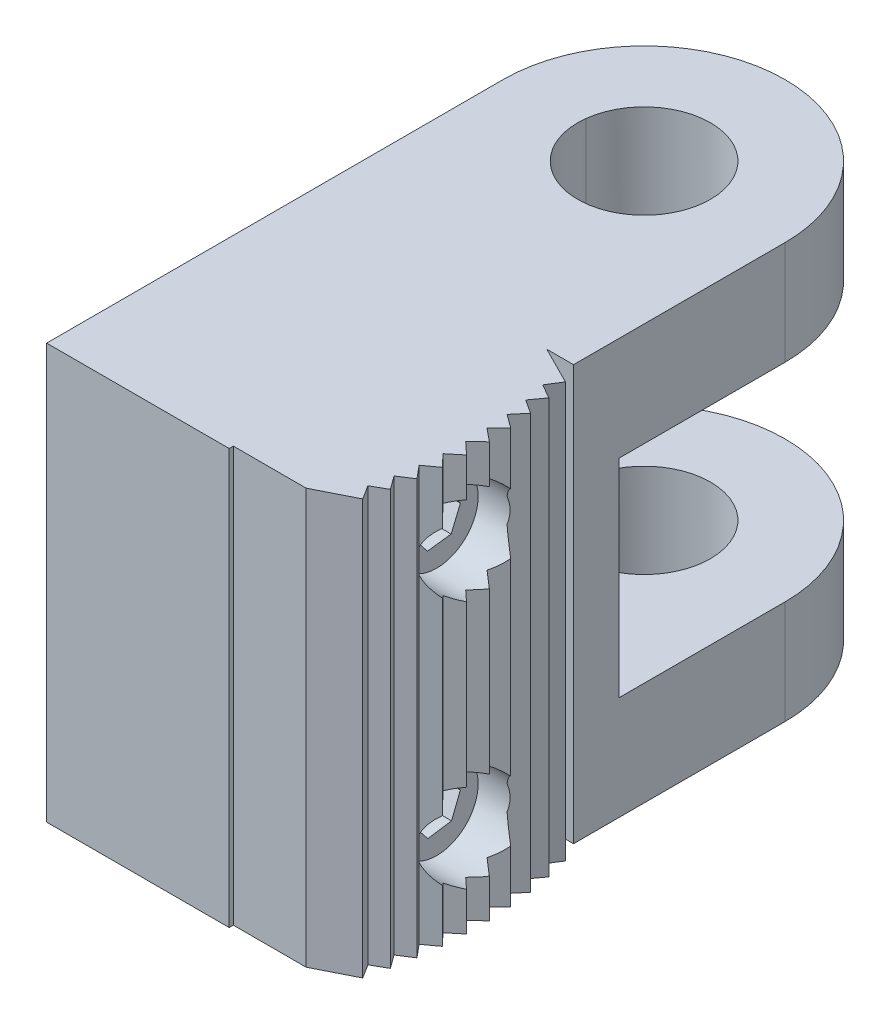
ISO-10303-21;
HEADER;
FILE_DESCRIPTION(('STEP AP214'),'2;1');
FILE_NAME('part.step','',(''),(''),'','','');
FILE_SCHEMA(('AUTOMOTIVE_DESIGN { 1 0 10303 214 1 1 1 1 }'));
ENDSEC;
DATA;
#1=APPLICATION_CONTEXT('core data for automotive mechanical design processes');
#2=APPLICATION_PROTOCOL_DEFINITION('international standard','automotive_design',2000,#1);
#3=PRODUCT_CONTEXT('',#1,'mechanical');
#4=PRODUCT('Part','Part','',(#3));
#5=PRODUCT_RELATED_PRODUCT_CATEGORY('part','',(#4));
#6=PRODUCT_DEFINITION_FORMATION('','',#4);
#7=PRODUCT_DEFINITION_CONTEXT('part definition',#1,'design');
#8=PRODUCT_DEFINITION('design','',#6,#7);
#9=PRODUCT_DEFINITION_SHAPE('','',#8);
#10=(LENGTH_UNIT() NAMED_UNIT(*) SI_UNIT(.MILLI.,.METRE.));
#11=(NAMED_UNIT(*) PLANE_ANGLE_UNIT() SI_UNIT($,.RADIAN.));
#12=(NAMED_UNIT(*) SI_UNIT($,.STERADIAN.) SOLID_ANGLE_UNIT());
#13=UNCERTAINTY_MEASURE_WITH_UNIT(LENGTH_MEASURE(1.E-05),#10,'distance_accuracy_value','');
#14=(GEOMETRIC_REPRESENTATION_CONTEXT(3) GLOBAL_UNCERTAINTY_ASSIGNED_CONTEXT((#13)) GLOBAL_UNIT_ASSIGNED_CONTEXT((#10,
#11,#12)) REPRESENTATION_CONTEXT('',''));
#15=CARTESIAN_POINT('',(0.,0.,0.));
#16=DIRECTION('',(0.,0.,1.));
#17=DIRECTION('',(1.,0.,0.));
#18=AXIS2_PLACEMENT_3D('',#15,#16,#17);
#19=CARTESIAN_POINT('',(10.9999999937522,-17.037747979,36.7393073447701));
#20=DIRECTION('',(1.,0.,0.));
#21=DIRECTION('',(0.,0.988880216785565,0.148714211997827));
#22=AXIS2_PLACEMENT_3D('',#19,#20,#21);
#23=PLANE('',#22);
#24=CARTESIAN_POINT('',(10.9999999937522,-14.570699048,37.1453486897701));
#25=DIRECTION('',(0.,0.782038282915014,0.623230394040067));
#26=VECTOR('',#25,1.);
#27=LINE('',#24,#26);
#28=CARTESIAN_POINT('',(10.9999999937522,-14.5706990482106,37.1453486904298));
#29=VERTEX_POINT('',#28);
#30=CARTESIAN_POINT('',(10.9999999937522,-12.3131489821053,38.9444598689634));
#31=VERTEX_POINT('',#30);
#32=EDGE_CURVE('E1067',#29,#31,#27,.T.);
#33=ORIENTED_EDGE('',*,*,#32,.T.);
#34=CARTESIAN_POINT('',(10.9999999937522,-12.742449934,41.7991111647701));
#35=DIRECTION('',(0.,0.148714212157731,-0.988880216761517));
#36=VECTOR('',#35,1.);
#37=LINE('',#34,#36);
#38=CARTESIAN_POINT('',(10.9999999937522,-12.7424499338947,41.7991111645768));
#39=VERTEX_POINT('',#38);
#40=EDGE_CURVE('E1080',#39,#31,#37,.T.);
#41=ORIENTED_EDGE('',*,*,#40,.F.);
#42=CARTESIAN_POINT('',(10.9999999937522,-15.429300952,42.8546512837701));
#43=DIRECTION('',(0.,0.930752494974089,-0.365649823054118));
#44=VECTOR('',#43,1.);
#45=LINE('',#42,#44);
#46=CARTESIAN_POINT('',(10.9999999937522,-15.4293009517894,42.8546512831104));
#47=VERTEX_POINT('',#46);
#48=EDGE_CURVE('E1092',#47,#39,#45,.T.);
#49=ORIENTED_EDGE('',*,*,#48,.F.);
#50=CARTESIAN_POINT('',(10.9999999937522,-15.429300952,42.8546512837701));
#51=DIRECTION('',(0.,-0.782038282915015,-0.623230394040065));
#52=VECTOR('',#51,1.);
#53=LINE('',#50,#52);
#54=CARTESIAN_POINT('',(10.9999999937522,-17.6868510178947,41.0555401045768));
#55=VERTEX_POINT('',#54);
#56=EDGE_CURVE('E1103',#47,#55,#53,.T.);
#57=ORIENTED_EDGE('',*,*,#56,.T.);
#58=CARTESIAN_POINT('',(10.9999999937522,-17.686851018,41.0555401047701));
#59=DIRECTION('',(0.,0.148714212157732,-0.988880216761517));
#60=VECTOR('',#59,1.);
#61=LINE('',#58,#60);
#62=CARTESIAN_POINT('',(10.9999999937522,-17.2575500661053,38.2008888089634));
#63=VERTEX_POINT('',#62);
#64=EDGE_CURVE('E1115',#55,#63,#61,.T.);
#65=ORIENTED_EDGE('',*,*,#64,.T.);
#66=CARTESIAN_POINT('',(10.9999999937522,-14.570699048,37.1453486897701));
#67=DIRECTION('',(0.,-0.930752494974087,0.365649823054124));
#68=VECTOR('',#67,1.);
#69=LINE('',#66,#68);
#70=EDGE_CURVE('E1127',#29,#63,#69,.T.);
#71=ORIENTED_EDGE('',*,*,#70,.F.);
#72=EDGE_LOOP('',(#33,#41,#49,#57,#65,#71));
#73=FACE_BOUND('',#72,.T.);
#74=ADVANCED_FACE('F14',(#73),#23,.T.);
#75=CARTESIAN_POINT('',(10.9999999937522,12.884864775,36.7889664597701));
#76=DIRECTION('',(1.,0.,0.));
#77=DIRECTION('',(0.,0.992153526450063,0.125025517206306));
#78=AXIS2_PLACEMENT_3D('',#75,#76,#77);
#79=PLANE('',#78);
#80=CARTESIAN_POINT('',(10.9999999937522,15.36091758,37.1358994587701));
#81=DIRECTION('',(0.,0.79671739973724,0.604352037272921));
#82=VECTOR('',#81,1.);
#83=LINE('',#80,#82);
#84=CARTESIAN_POINT('',(10.9999999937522,15.3609175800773,37.1358994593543));
#85=VERTEX_POINT('',#84);
#86=CARTESIAN_POINT('',(10.9999999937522,17.6608426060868,38.8805135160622));
#87=VERTEX_POINT('',#86);
#88=EDGE_CURVE('E1140',#85,#87,#83,.T.);
#89=ORIENTED_EDGE('',*,*,#88,.T.);
#90=CARTESIAN_POINT('',(10.9999999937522,17.299925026,41.7446140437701));
#91=DIRECTION('',(0.,0.125025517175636,-0.992153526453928));
#92=VECTOR('',#91,1.);
#93=LINE('',#90,#92);
#94=CARTESIAN_POINT('',(10.9999999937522,17.2999250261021,41.744614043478));
#95=VERTEX_POINT('',#94);
#96=EDGE_CURVE('E1653',#95,#87,#93,.T.);
#97=ORIENTED_EDGE('',*,*,#96,.F.);
#98=CARTESIAN_POINT('',(10.9999999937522,14.63908242,42.8641005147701));
#99=DIRECTION('',(0.,0.921742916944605,-0.387801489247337));
#100=VECTOR('',#99,1.);
#101=LINE('',#98,#100);
#102=CARTESIAN_POINT('',(10.9999999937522,14.6390824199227,42.8641005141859));
#103=VERTEX_POINT('',#102);
#104=EDGE_CURVE('E4182',#103,#95,#101,.T.);
#105=ORIENTED_EDGE('',*,*,#104,.F.);
#106=CARTESIAN_POINT('',(10.9999999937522,14.63908242,42.8641005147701));
#107=DIRECTION('',(0.,-0.796717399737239,-0.604352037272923));
#108=VECTOR('',#107,1.);
#109=LINE('',#106,#108);
#110=CARTESIAN_POINT('',(10.9999999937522,12.3391573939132,41.119486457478));
#111=VERTEX_POINT('',#110);
#112=EDGE_CURVE('E1494',#103,#111,#109,.T.);
#113=ORIENTED_EDGE('',*,*,#112,.T.);
#114=CARTESIAN_POINT('',(10.9999999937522,12.339157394,41.1194864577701));
#115=DIRECTION('',(0.,0.125025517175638,-0.992153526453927));
#116=VECTOR('',#115,1.);
#117=LINE('',#114,#116);
#118=CARTESIAN_POINT('',(10.9999999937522,12.7000749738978,38.2553859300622));
#119=VERTEX_POINT('',#118);
#120=EDGE_CURVE('E4183',#111,#119,#117,.T.);
#121=ORIENTED_EDGE('',*,*,#120,.T.);
#122=CARTESIAN_POINT('',(10.9999999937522,15.36091758,37.1358994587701));
#123=DIRECTION('',(0.,-0.921742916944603,0.387801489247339));
#124=VECTOR('',#123,1.);
#125=LINE('',#122,#124);
#126=EDGE_CURVE('E1185',#85,#119,#125,.T.);
#127=ORIENTED_EDGE('',*,*,#126,.F.);
#128=EDGE_LOOP('',(#89,#97,#105,#113,#121,#127));
#129=FACE_BOUND('',#128,.T.);
#130=ADVANCED_FACE('F1146',(#129),#79,.T.);
#131=CARTESIAN_POINT('',(10.9999999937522,-15.429300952,42.8546512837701));
#132=DIRECTION('',(0.,-0.623230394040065,0.782038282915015));
#133=DIRECTION('',(0.,-0.782038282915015,-0.623230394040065));
#134=AXIS2_PLACEMENT_3D('',#131,#132,#133);
#135=PLANE('',#134);
#136=CARTESIAN_POINT('',(14.9999999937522,-15.429300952,42.8546512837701));
#137=DIRECTION('',(-1.,0.,0.));
#138=VECTOR('',#137,1.);
#139=LINE('',#136,#138);
#140=CARTESIAN_POINT('',(14.9999999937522,-15.4293009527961,42.8546512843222));
#141=VERTEX_POINT('',#140);
#142=EDGE_CURVE('E1197',#141,#47,#139,.T.);
#143=ORIENTED_EDGE('',*,*,#142,.F.);
#144=CARTESIAN_POINT('',(14.9999999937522,-15.4293009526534,42.8546512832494));
#145=DIRECTION('',(0.,-0.782038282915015,-0.623230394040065));
#146=VECTOR('',#145,1.);
#147=LINE('',#144,#146);
#148=CARTESIAN_POINT('',(14.9999999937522,-17.6868510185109,41.0555401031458));
#149=VERTEX_POINT('',#148);
#150=EDGE_CURVE('E1209',#141,#149,#147,.T.);
#151=ORIENTED_EDGE('',*,*,#150,.T.);
#152=CARTESIAN_POINT('',(14.9999999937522,-17.686851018,41.0555401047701));
#153=DIRECTION('',(-1.,0.,0.));
#154=VECTOR('',#153,1.);
#155=LINE('',#152,#154);
#156=EDGE_CURVE('E1220',#149,#55,#155,.T.);
#157=ORIENTED_EDGE('',*,*,#156,.T.);
#158=ORIENTED_EDGE('',*,*,#56,.F.);
#159=EDGE_LOOP('',(#143,#151,#157,#158));
#160=FACE_BOUND('',#159,.T.);
#161=ADVANCED_FACE('F1155',(#160),#135,.F.);
#162=CARTESIAN_POINT('',(10.9999999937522,-17.686851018,41.0555401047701));
#163=DIRECTION('',(0.,-0.988880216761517,-0.148714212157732));
#164=DIRECTION('',(0.,0.148714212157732,-0.988880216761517));
#165=AXIS2_PLACEMENT_3D('',#162,#163,#164);
#166=PLANE('',#165);
#167=CARTESIAN_POINT('',(14.9999999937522,-17.6868510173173,41.0555401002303));
#168=DIRECTION('',(0.,0.148714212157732,-0.988880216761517));
#169=VECTOR('',#168,1.);
#170=LINE('',#167,#169);
#171=CARTESIAN_POINT('',(14.9999999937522,-17.2575500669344,38.200888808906));
#172=VERTEX_POINT('',#171);
#173=EDGE_CURVE('E1241',#149,#172,#170,.T.);
#174=ORIENTED_EDGE('',*,*,#173,.T.);
#175=CARTESIAN_POINT('',(10.9999999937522,-17.257550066,38.2008888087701));
#176=DIRECTION('',(1.,0.,0.));
#177=VECTOR('',#176,1.);
#178=LINE('',#175,#177);
#179=EDGE_CURVE('E1305',#63,#172,#178,.T.);
#180=ORIENTED_EDGE('',*,*,#179,.F.);
#181=ORIENTED_EDGE('',*,*,#64,.F.);
#182=ORIENTED_EDGE('',*,*,#156,.F.);
#183=EDGE_LOOP('',(#174,#180,#181,#182));
#184=FACE_BOUND('',#183,.T.);
#185=ADVANCED_FACE('F1247',(#184),#166,.F.);
#186=CARTESIAN_POINT('',(10.9999999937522,-14.570699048,37.1453486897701));
#187=DIRECTION('',(0.,0.365649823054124,0.930752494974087));
#188=DIRECTION('',(0.,-0.930752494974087,0.365649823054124));
#189=AXIS2_PLACEMENT_3D('',#186,#187,#188);
#190=PLANE('',#189);
#191=CARTESIAN_POINT('',(14.9999999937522,-14.570699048,37.1453486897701));
#192=DIRECTION('',(-1.,0.,0.));
#193=VECTOR('',#192,1.);
#194=LINE('',#191,#193);
#195=CARTESIAN_POINT('',(14.9999999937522,-14.5706990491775,37.1453486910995));
#196=VERTEX_POINT('',#195);
#197=EDGE_CURVE('E1286',#196,#29,#194,.T.);
#198=ORIENTED_EDGE('',*,*,#197,.T.);
#199=ORIENTED_EDGE('',*,*,#70,.T.);
#200=ORIENTED_EDGE('',*,*,#179,.T.);
#201=CARTESIAN_POINT('',(14.9999999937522,-17.2575500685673,38.2008888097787));
#202=DIRECTION('',(0.,0.930752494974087,-0.365649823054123));
#203=VECTOR('',#202,1.);
#204=LINE('',#201,#203);
#205=EDGE_CURVE('E1316',#172,#196,#204,.T.);
#206=ORIENTED_EDGE('',*,*,#205,.T.);
#207=EDGE_LOOP('',(#198,#199,#200,#206));
#208=FACE_BOUND('',#207,.T.);
#209=ADVANCED_FACE('F1256',(#208),#190,.T.);
#210=CARTESIAN_POINT('',(10.9999999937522,-14.570699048,37.1453486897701));
#211=DIRECTION('',(0.,0.623230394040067,-0.782038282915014));
#212=DIRECTION('',(0.,0.782038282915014,0.623230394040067));
#213=AXIS2_PLACEMENT_3D('',#210,#211,#212);
#214=PLANE('',#213);
#215=CARTESIAN_POINT('',(14.9999999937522,-14.5706990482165,37.1453486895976));
#216=DIRECTION('',(0.,0.782038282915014,0.623230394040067));
#217=VECTOR('',#216,1.);
#218=LINE('',#215,#217);
#219=CARTESIAN_POINT('',(14.9999999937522,-12.3131489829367,38.9444598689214));
#220=VERTEX_POINT('',#219);
#221=EDGE_CURVE('E1328',#196,#220,#218,.T.);
#222=ORIENTED_EDGE('',*,*,#221,.T.);
#223=CARTESIAN_POINT('',(10.9999999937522,-12.313148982,38.9444598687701));
#224=DIRECTION('',(1.,0.,0.));
#225=VECTOR('',#224,1.);
#226=LINE('',#223,#225);
#227=EDGE_CURVE('E1392',#31,#220,#226,.T.);
#228=ORIENTED_EDGE('',*,*,#227,.F.);
#229=ORIENTED_EDGE('',*,*,#32,.F.);
#230=ORIENTED_EDGE('',*,*,#197,.F.);
#231=EDGE_LOOP('',(#222,#228,#229,#230));
#232=FACE_BOUND('',#231,.T.);
#233=ADVANCED_FACE('F1334',(#232),#214,.F.);
#234=CARTESIAN_POINT('',(10.9999999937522,-12.742449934,41.7991111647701));
#235=DIRECTION('',(0.,-0.988880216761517,-0.148714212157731));
#236=DIRECTION('',(0.,0.148714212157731,-0.988880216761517));
#237=AXIS2_PLACEMENT_3D('',#234,#235,#236);
#238=PLANE('',#237);
#239=CARTESIAN_POINT('',(10.9999999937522,-12.742449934,41.7991111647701));
#240=DIRECTION('',(1.,0.,0.));
#241=VECTOR('',#240,1.);
#242=LINE('',#239,#241);
#243=CARTESIAN_POINT('',(14.9999999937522,-12.7424499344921,41.7991111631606));
#244=VERTEX_POINT('',#243);
#245=EDGE_CURVE('E1373',#39,#244,#242,.T.);
#246=ORIENTED_EDGE('',*,*,#245,.F.);
#247=ORIENTED_EDGE('',*,*,#40,.T.);
#248=ORIENTED_EDGE('',*,*,#227,.T.);
#249=CARTESIAN_POINT('',(14.9999999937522,-12.3131489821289,38.9444598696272));
#250=DIRECTION('',(0.,-0.148714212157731,0.988880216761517));
#251=VECTOR('',#250,1.);
#252=LINE('',#249,#251);
#253=EDGE_CURVE('E1403',#220,#244,#252,.T.);
#254=ORIENTED_EDGE('',*,*,#253,.T.);
#255=EDGE_LOOP('',(#246,#247,#248,#254));
#256=FACE_BOUND('',#255,.T.);
#257=ADVANCED_FACE('F1343',(#256),#238,.T.);
#258=CARTESIAN_POINT('',(10.9999999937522,-15.429300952,42.8546512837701));
#259=DIRECTION('',(0.,-0.365649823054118,-0.930752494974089));
#260=DIRECTION('',(0.,0.930752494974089,-0.365649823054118));
#261=AXIS2_PLACEMENT_3D('',#258,#259,#260);
#262=PLANE('',#261);
#263=ORIENTED_EDGE('',*,*,#142,.T.);
#264=ORIENTED_EDGE('',*,*,#48,.T.);
#265=ORIENTED_EDGE('',*,*,#245,.T.);
#266=CARTESIAN_POINT('',(14.9999999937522,-12.7424499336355,41.7991111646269));
#267=DIRECTION('',(0.,-0.930752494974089,0.365649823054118));
#268=VECTOR('',#267,1.);
#269=LINE('',#266,#268);
#270=EDGE_CURVE('E1447',#244,#141,#269,.T.);
#271=ORIENTED_EDGE('',*,*,#270,.T.);
#272=EDGE_LOOP('',(#263,#264,#265,#271));
#273=FACE_BOUND('',#272,.T.);
#274=ADVANCED_FACE('F1418',(#273),#262,.T.);
#275=CARTESIAN_POINT('',(10.9999999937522,14.63908242,42.8641005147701));
#276=DIRECTION('',(0.,-0.604352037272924,0.796717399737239));
#277=DIRECTION('',(0.,-0.796717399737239,-0.604352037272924));
#278=AXIS2_PLACEMENT_3D('',#275,#276,#277);
#279=PLANE('',#278);
#280=CARTESIAN_POINT('',(14.9999999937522,14.63908242,42.8641005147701));
#281=DIRECTION('',(-1.,0.,0.));
#282=VECTOR('',#281,1.);
#283=LINE('',#280,#282);
#284=CARTESIAN_POINT('',(14.9999999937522,14.6390824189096,42.8641005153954));
#285=VERTEX_POINT('',#284);
#286=EDGE_CURVE('E1459',#285,#103,#283,.T.);
#287=ORIENTED_EDGE('',*,*,#286,.F.);
#288=CARTESIAN_POINT('',(14.9999999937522,14.6390824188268,42.8641005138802));
#289=DIRECTION('',(0.,-0.796717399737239,-0.604352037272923));
#290=VECTOR('',#289,1.);
#291=LINE('',#288,#290);
#292=CARTESIAN_POINT('',(14.9999999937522,12.3391573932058,41.1194864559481));
#293=VERTEX_POINT('',#292);
#294=EDGE_CURVE('E1472',#285,#293,#291,.T.);
#295=ORIENTED_EDGE('',*,*,#294,.T.);
#296=CARTESIAN_POINT('',(14.9999999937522,12.339157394,41.1194864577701));
#297=DIRECTION('',(-1.,0.,0.));
#298=VECTOR('',#297,1.);
#299=LINE('',#296,#298);
#300=EDGE_CURVE('E1483',#293,#111,#299,.T.);
#301=ORIENTED_EDGE('',*,*,#300,.T.);
#302=ORIENTED_EDGE('',*,*,#112,.F.);
#303=EDGE_LOOP('',(#287,#295,#301,#302));
#304=FACE_BOUND('',#303,.T.);
#305=ADVANCED_FACE('F1427',(#304),#279,.F.);
#306=CARTESIAN_POINT('',(10.9999999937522,12.339157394,41.1194864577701));
#307=DIRECTION('',(0.,-0.992153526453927,-0.125025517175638));
#308=DIRECTION('',(0.,0.125025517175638,-0.992153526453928));
#309=AXIS2_PLACEMENT_3D('',#306,#307,#308);
#310=PLANE('',#309);
#311=CARTESIAN_POINT('',(14.9999999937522,12.3391573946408,41.119486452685));
#312=DIRECTION('',(0.,0.125025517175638,-0.992153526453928));
#313=VECTOR('',#312,1.);
#314=LINE('',#311,#313);
#315=CARTESIAN_POINT('',(14.9999999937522,12.7000749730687,38.255385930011));
#316=VERTEX_POINT('',#315);
#317=EDGE_CURVE('E1508',#293,#316,#314,.T.);
#318=ORIENTED_EDGE('',*,*,#317,.T.);
#319=CARTESIAN_POINT('',(10.9999999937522,12.700074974,38.2553859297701));
#320=DIRECTION('',(1.,0.,0.));
#321=VECTOR('',#320,1.);
#322=LINE('',#319,#321);
#323=EDGE_CURVE('E1572',#119,#316,#322,.T.);
#324=ORIENTED_EDGE('',*,*,#323,.F.);
#325=ORIENTED_EDGE('',*,*,#120,.F.);
#326=ORIENTED_EDGE('',*,*,#300,.F.);
#327=EDGE_LOOP('',(#318,#324,#325,#326));
#328=FACE_BOUND('',#327,.T.);
#329=ADVANCED_FACE('F1514',(#328),#310,.F.);
#330=CARTESIAN_POINT('',(10.9999999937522,15.36091758,37.1358994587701));
#331=DIRECTION('',(0.,0.387801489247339,0.921742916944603));
#332=DIRECTION('',(0.,-0.921742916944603,0.387801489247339));
#333=AXIS2_PLACEMENT_3D('',#330,#331,#332);
#334=PLANE('',#333);
#335=CARTESIAN_POINT('',(14.9999999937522,15.36091758,37.1358994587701));
#336=DIRECTION('',(-1.,0.,0.));
#337=VECTOR('',#336,1.);
#338=LINE('',#335,#337);
#339=CARTESIAN_POINT('',(14.9999999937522,15.3609175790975,37.1358994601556));
#340=VERTEX_POINT('',#339);
#341=EDGE_CURVE('E1553',#340,#85,#338,.T.);
#342=ORIENTED_EDGE('',*,*,#341,.T.);
#343=ORIENTED_EDGE('',*,*,#126,.T.);
#344=ORIENTED_EDGE('',*,*,#323,.T.);
#345=CARTESIAN_POINT('',(14.9999999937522,12.7000749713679,38.2553859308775));
#346=DIRECTION('',(0.,0.921742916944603,-0.38780148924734));
#347=VECTOR('',#346,1.);
#348=LINE('',#345,#347);
#349=EDGE_CURVE('E1583',#316,#340,#348,.T.);
#350=ORIENTED_EDGE('',*,*,#349,.T.);
#351=EDGE_LOOP('',(#342,#343,#344,#350));
#352=FACE_BOUND('',#351,.T.);
#353=ADVANCED_FACE('F1523',(#352),#334,.T.);
#354=CARTESIAN_POINT('',(10.9999999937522,15.36091758,37.1358994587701));
#355=DIRECTION('',(0.,0.604352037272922,-0.79671739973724));
#356=DIRECTION('',(0.,0.79671739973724,0.604352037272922));
#357=AXIS2_PLACEMENT_3D('',#354,#355,#356);
#358=PLANE('',#357);
#359=CARTESIAN_POINT('',(14.9999999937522,15.3609175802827,37.1358994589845));
#360=DIRECTION('',(0.,0.79671739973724,0.604352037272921));
#361=VECTOR('',#360,1.);
#362=LINE('',#359,#361);
#363=CARTESIAN_POINT('',(14.9999999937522,17.660842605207,38.8805135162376));
#364=VERTEX_POINT('',#363);
#365=EDGE_CURVE('E1595',#340,#364,#362,.T.);
#366=ORIENTED_EDGE('',*,*,#365,.T.);
#367=CARTESIAN_POINT('',(10.9999999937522,17.660842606,38.8805135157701));
#368=DIRECTION('',(1.,0.,0.));
#369=VECTOR('',#368,1.);
#370=LINE('',#367,#369);
#371=EDGE_CURVE('E1663',#87,#364,#370,.T.);
#372=ORIENTED_EDGE('',*,*,#371,.F.);
#373=ORIENTED_EDGE('',*,*,#88,.F.);
#374=ORIENTED_EDGE('',*,*,#341,.F.);
#375=EDGE_LOOP('',(#366,#372,#373,#374));
#376=FACE_BOUND('',#375,.T.);
#377=ADVANCED_FACE('F1601',(#376),#358,.F.);
#378=CARTESIAN_POINT('',(10.9999999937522,17.299925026,41.7446140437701));
#379=DIRECTION('',(0.,-0.992153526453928,-0.125025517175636));
#380=DIRECTION('',(0.,0.125025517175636,-0.992153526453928));
#381=AXIS2_PLACEMENT_3D('',#378,#379,#380);
#382=PLANE('',#381);
#383=CARTESIAN_POINT('',(10.9999999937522,17.299925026,41.7446140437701));
#384=DIRECTION('',(1.,0.,0.));
#385=VECTOR('',#384,1.);
#386=LINE('',#383,#385);
#387=CARTESIAN_POINT('',(14.9999999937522,17.2999250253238,41.7446140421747));
#388=VERTEX_POINT('',#387);
#389=EDGE_CURVE('E1642',#95,#388,#386,.T.);
#390=ORIENTED_EDGE('',*,*,#389,.F.);
#391=ORIENTED_EDGE('',*,*,#96,.T.);
#392=ORIENTED_EDGE('',*,*,#371,.T.);
#393=CARTESIAN_POINT('',(14.9999999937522,17.6608426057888,38.8805135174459));
#394=DIRECTION('',(0.,-0.125025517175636,0.992153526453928));
#395=VECTOR('',#394,1.);
#396=LINE('',#393,#395);
#397=EDGE_CURVE('E1674',#364,#388,#396,.T.);
#398=ORIENTED_EDGE('',*,*,#397,.T.);
#399=EDGE_LOOP('',(#390,#391,#392,#398));
#400=FACE_BOUND('',#399,.T.);
#401=ADVANCED_FACE('F1610',(#400),#382,.T.);
#402=CARTESIAN_POINT('',(10.9999999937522,14.63908242,42.8641005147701));
#403=DIRECTION('',(0.,-0.387801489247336,-0.921742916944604));
#404=DIRECTION('',(0.,0.921742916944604,-0.387801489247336));
#405=AXIS2_PLACEMENT_3D('',#402,#403,#404);
#406=PLANE('',#405);
#407=ORIENTED_EDGE('',*,*,#286,.T.);
#408=ORIENTED_EDGE('',*,*,#104,.T.);
#409=ORIENTED_EDGE('',*,*,#389,.T.);
#410=CARTESIAN_POINT('',(14.9999999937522,17.2999250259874,41.7446140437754));
#411=DIRECTION('',(0.,-0.921742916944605,0.387801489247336));
#412=VECTOR('',#411,1.);
#413=LINE('',#410,#412);
#414=EDGE_CURVE('E1718',#388,#285,#413,.T.);
#415=ORIENTED_EDGE('',*,*,#414,.T.);
#416=EDGE_LOOP('',(#407,#408,#409,#415));
#417=FACE_BOUND('',#416,.T.);
#418=ADVANCED_FACE('F1689',(#417),#406,.T.);
#419=CARTESIAN_POINT('',(14.9999999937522,-9.237778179,35.7101182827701));
#420=DIRECTION('',(-1.,0.,0.));
#421=DIRECTION('',(0.,-0.988880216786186,-0.148714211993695));
#422=AXIS2_PLACEMENT_3D('',#419,#420,#421);
#423=PLANE('',#422);
#424=ORIENTED_EDGE('',*,*,#253,.F.);
#425=ORIENTED_EDGE('',*,*,#221,.F.);
#426=ORIENTED_EDGE('',*,*,#205,.F.);
#427=ORIENTED_EDGE('',*,*,#173,.F.);
#428=ORIENTED_EDGE('',*,*,#150,.F.);
#429=ORIENTED_EDGE('',*,*,#270,.F.);
#430=EDGE_LOOP('',(#424,#425,#426,#427,#428,#429));
#431=FACE_BOUND('',#430,.T.);
#432=CARTESIAN_POINT('',(14.9999999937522,-15.,39.9999999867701));
#433=DIRECTION('',(-1.,0.,0.));
#434=DIRECTION('',(0.,0.988880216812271,0.14871421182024));
#435=AXIS2_PLACEMENT_3D('',#432,#433,#434);
#436=CIRCLE('',#435,5.00000000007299);
#437=CARTESIAN_POINT('',(14.9999999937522,-10.0555989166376,40.7435710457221));
#438=VERTEX_POINT('',#437);
#439=CARTESIAN_POINT('',(14.9999999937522,-19.944401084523,39.2564289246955));
#440=VERTEX_POINT('',#439);
#441=EDGE_CURVE('E1786',#438,#440,#436,.T.);
#442=ORIENTED_EDGE('',*,*,#441,.F.);
#443=CARTESIAN_POINT('',(14.9999999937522,-15.,39.9999999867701));
#444=DIRECTION('',(-1.,0.,0.));
#445=DIRECTION('',(0.,-0.988880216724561,-0.148714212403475));
#446=AXIS2_PLACEMENT_3D('',#443,#444,#445);
#447=CIRCLE('',#446,5.00000000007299);
#448=EDGE_CURVE('E1796',#440,#438,#447,.T.);
#449=ORIENTED_EDGE('',*,*,#448,.F.);
#450=EDGE_LOOP('',(#442,#449));
#451=FACE_BOUND('',#450,.T.);
#452=ADVANCED_FACE('F1698',(#431,#451),#423,.F.);
#453=CARTESIAN_POINT('',(14.9999999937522,20.657994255,35.5735582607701));
#454=DIRECTION('',(-1.,0.,0.));
#455=DIRECTION('',(0.,-0.992153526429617,-0.125025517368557));
#456=AXIS2_PLACEMENT_3D('',#453,#454,#455);
#457=PLANE('',#456);
#458=ORIENTED_EDGE('',*,*,#397,.F.);
#459=ORIENTED_EDGE('',*,*,#365,.F.);
#460=ORIENTED_EDGE('',*,*,#349,.F.);
#461=ORIENTED_EDGE('',*,*,#317,.F.);
#462=ORIENTED_EDGE('',*,*,#294,.F.);
#463=ORIENTED_EDGE('',*,*,#414,.F.);
#464=EDGE_LOOP('',(#458,#459,#460,#461,#462,#463));
#465=FACE_BOUND('',#464,.T.);
#466=CARTESIAN_POINT('',(14.9999999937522,15.,39.9999999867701));
#467=DIRECTION('',(-1.,0.,0.));
#468=DIRECTION('',(0.,0.992153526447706,0.125025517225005));
#469=AXIS2_PLACEMENT_3D('',#466,#467,#468);
#470=CIRCLE('',#469,4.99999999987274);
#471=CARTESIAN_POINT('',(14.9999999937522,19.9607676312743,40.6251275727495));
#472=VERTEX_POINT('',#471);
#473=CARTESIAN_POINT('',(14.9999999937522,10.0392323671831,39.3748723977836));
#474=VERTEX_POINT('',#473);
#475=EDGE_CURVE('E4011',#472,#474,#470,.T.);
#476=ORIENTED_EDGE('',*,*,#475,.F.);
#477=CARTESIAN_POINT('',(14.9999999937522,15.,39.9999999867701));
#478=DIRECTION('',(-1.,0.,0.));
#479=DIRECTION('',(0.,-0.992153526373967,-0.125025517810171));
#480=AXIS2_PLACEMENT_3D('',#477,#478,#479);
#481=CIRCLE('',#480,4.99999999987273);
#482=EDGE_CURVE('E1862',#474,#472,#481,.T.);
#483=ORIENTED_EDGE('',*,*,#482,.F.);
#484=EDGE_LOOP('',(#476,#483));
#485=FACE_BOUND('',#484,.T.);
#486=ADVANCED_FACE('F1811',(#465,#485),#457,.F.);
#487=CARTESIAN_POINT('',(9.99999999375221,-10.055598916,40.7435710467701));
#488=CARTESIAN_POINT('',(14.9999999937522,-10.055598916,40.7435710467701));
#489=B_SPLINE_CURVE_WITH_KNOTS('',1,(#487,#488),.UNSPECIFIED.,.F.,.F.,(2,2),(0.,1.),.UNSPECIFIED.);
#490=CARTESIAN_POINT('',(82.9999999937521,-15.,39.9999999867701));
#491=DIRECTION('',(1.,0.,0.));
#492=AXIS1_PLACEMENT('',#490,#491);
#493=SURFACE_OF_REVOLUTION('',#489,#492);
#494=CARTESIAN_POINT('',(9.99999999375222,-15.,39.9999999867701));
#495=DIRECTION('',(1.,0.,0.));
#496=DIRECTION('',(0.,0.988880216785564,0.14871421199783));
#497=AXIS2_PLACEMENT_3D('',#494,#495,#496);
#498=CIRCLE('',#497,5.00000000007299);
#499=CARTESIAN_POINT('',(9.99999999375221,-19.9444010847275,39.2564289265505));
#500=VERTEX_POINT('',#499);
#501=CARTESIAN_POINT('',(9.99999999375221,-10.0555989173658,40.7435710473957));
#502=VERTEX_POINT('',#501);
#503=EDGE_CURVE('E2153',#500,#502,#498,.F.);
#504=ORIENTED_EDGE('',*,*,#503,.F.);
#505=CARTESIAN_POINT('',(9.99999999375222,-15.,39.9999999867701));
#506=DIRECTION('',(1.,0.,0.));
#507=DIRECTION('',(0.,-0.988880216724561,-0.148714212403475));
#508=AXIS2_PLACEMENT_3D('',#505,#506,#507);
#509=CIRCLE('',#508,5.00000000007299);
#510=EDGE_CURVE('E2163',#502,#500,#509,.F.);
#511=ORIENTED_EDGE('',*,*,#510,.F.);
#512=EDGE_LOOP('',(#504,#511));
#513=FACE_BOUND('',#512,.T.);
#514=ORIENTED_EDGE('',*,*,#441,.T.);
#515=ORIENTED_EDGE('',*,*,#448,.T.);
#516=EDGE_LOOP('',(#514,#515));
#517=FACE_BOUND('',#516,.T.);
#518=ADVANCED_FACE('F1820',(#513,#517),#493,.T.);
#519=CARTESIAN_POINT('',(9.99999999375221,19.960767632,40.6251275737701));
#520=CARTESIAN_POINT('',(14.9999999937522,19.960767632,40.6251275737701));
#521=B_SPLINE_CURVE_WITH_KNOTS('',1,(#519,#520),.UNSPECIFIED.,.F.,.F.,(2,2),(0.,1.),.UNSPECIFIED.);
#522=CARTESIAN_POINT('',(82.9999999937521,15.,39.9999999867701));
#523=DIRECTION('',(1.,0.,0.));
#524=AXIS1_PLACEMENT('',#522,#523);
#525=SURFACE_OF_REVOLUTION('',#521,#524);
#526=CARTESIAN_POINT('',(9.99999999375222,15.,39.9999999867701));
#527=DIRECTION('',(1.,0.,0.));
#528=DIRECTION('',(0.,0.992153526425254,0.125025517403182));
#529=AXIS2_PLACEMENT_3D('',#526,#527,#528);
#530=CIRCLE('',#529,4.99999999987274);
#531=CARTESIAN_POINT('',(9.99999999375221,10.0392323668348,39.3748723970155));
#532=VERTEX_POINT('',#531);
#533=CARTESIAN_POINT('',(9.99999999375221,19.9607676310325,40.6251275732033));
#534=VERTEX_POINT('',#533);
#535=EDGE_CURVE('E2199',#532,#534,#530,.F.);
#536=ORIENTED_EDGE('',*,*,#535,.F.);
#537=CARTESIAN_POINT('',(9.99999999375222,15.,39.9999999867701));
#538=DIRECTION('',(1.,0.,0.));
#539=DIRECTION('',(0.,-0.992153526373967,-0.125025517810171));
#540=AXIS2_PLACEMENT_3D('',#537,#538,#539);
#541=CIRCLE('',#540,4.99999999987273);
#542=EDGE_CURVE('E4000',#534,#532,#541,.F.);
#543=ORIENTED_EDGE('',*,*,#542,.F.);
#544=EDGE_LOOP('',(#536,#543));
#545=FACE_BOUND('',#544,.T.);
#546=ORIENTED_EDGE('',*,*,#475,.T.);
#547=ORIENTED_EDGE('',*,*,#482,.T.);
#548=EDGE_LOOP('',(#546,#547));
#549=FACE_BOUND('',#548,.T.);
#550=ADVANCED_FACE('F3963',(#545,#549),#525,.T.);
#551=CARTESIAN_POINT('',(19.8112217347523,11.48993188,44.1175728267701));
#552=DIRECTION('',(-0.72476370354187,0.,0.688997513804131));
#553=DIRECTION('',(-0.688997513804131,0.,-0.72476370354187));
#554=AXIS2_PLACEMENT_3D('',#551,#552,#553);
#555=PLANE('',#554);
#556=CARTESIAN_POINT('',(19.8112217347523,11.3536876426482,44.1175728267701));
#557=DIRECTION('',(0.,-1.,0.));
#558=VECTOR('',#557,1.);
#559=LINE('',#556,#558);
#560=CARTESIAN_POINT('',(19.8112217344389,11.3536876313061,44.1175728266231));
#561=VERTEX_POINT('',#560);
#562=CARTESIAN_POINT('',(19.8112217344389,-11.3536876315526,44.1175728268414));
#563=VERTEX_POINT('',#562);
#564=EDGE_CURVE('E1875',#561,#563,#559,.T.);
#565=ORIENTED_EDGE('',*,*,#564,.T.);
#566=CARTESIAN_POINT('',(18.4215633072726,-10.1836890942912,42.6557765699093));
#567=CARTESIAN_POINT('',(18.4905253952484,-10.2236916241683,42.7283202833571));
#568=CARTESIAN_POINT('',(18.5589643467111,-10.265545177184,42.8003480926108));
#569=CARTESIAN_POINT('',(18.6928041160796,-10.3517987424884,42.9412344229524));
#570=CARTESIAN_POINT('',(18.7582366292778,-10.3960964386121,43.0101255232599));
#571=CARTESIAN_POINT('',(18.8860650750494,-10.4869897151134,43.1447007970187));
#572=CARTESIAN_POINT('',(18.9484945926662,-10.5334851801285,43.2104206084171));
#573=CARTESIAN_POINT('',(19.0703140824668,-10.6285318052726,43.3386298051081));
#574=CARTESIAN_POINT('',(19.1297398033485,-10.6769851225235,43.4011577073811));
#575=CARTESIAN_POINT('',(19.2455498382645,-10.7757118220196,43.522975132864));
#576=CARTESIAN_POINT('',(19.3019721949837,-10.8258897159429,43.5823058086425));
#577=CARTESIAN_POINT('',(19.4117726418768,-10.9278373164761,43.6977345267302));
#578=CARTESIAN_POINT('',(19.4651912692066,-10.9795139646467,43.7538761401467));
#579=CARTESIAN_POINT('',(19.568983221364,-11.0842385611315,43.8629461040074));
#580=CARTESIAN_POINT('',(19.6193997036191,-11.1371959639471,43.915920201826));
#581=CARTESIAN_POINT('',(19.7171792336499,-11.2442702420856,44.0186842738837));
#582=CARTESIAN_POINT('',(19.7645884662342,-11.2982991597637,44.0685220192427));
#583=CARTESIAN_POINT('',(19.8112217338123,-11.3536876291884,44.1175728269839));
#584=B_SPLINE_CURVE_WITH_KNOTS('',3,(#566,#567,#568,#569,#570,#571,#572,#573,#574,#575,#576,
#577,#578,#579,#580,#581,#582,#583),.UNSPECIFIED.,.F.,.F.,(4,2,2,2,2,2,2,2,4),(0.,
0.323357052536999,0.63777936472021,0.943329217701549,1.24007448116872,1.52808925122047,
1.80745457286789,2.07825925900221,2.34060081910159),.UNSPECIFIED.);
#585=CARTESIAN_POINT('',(18.4215633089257,-10.1836890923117,42.6557765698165));
#586=VERTEX_POINT('',#585);
#587=EDGE_CURVE('E1887',#563,#586,#584,.F.);
#588=ORIENTED_EDGE('',*,*,#587,.T.);
#589=CARTESIAN_POINT('',(18.4215633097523,-10.1836890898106,42.6557765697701));
#590=DIRECTION('',(0.,1.,0.));
#591=VECTOR('',#590,1.);
#592=LINE('',#589,#591);
#593=CARTESIAN_POINT('',(18.4215633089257,10.1836890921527,42.6557765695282));
#594=VERTEX_POINT('',#593);
#595=EDGE_CURVE('E1898',#586,#594,#592,.T.);
#596=ORIENTED_EDGE('',*,*,#595,.T.);
#597=CARTESIAN_POINT('',(19.8112217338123,11.3536876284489,44.1175728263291));
#598=CARTESIAN_POINT('',(19.7645884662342,11.2982991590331,44.0685220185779));
#599=CARTESIAN_POINT('',(19.7171792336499,11.2442702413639,44.0186842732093));
#600=CARTESIAN_POINT('',(19.6193997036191,11.1371959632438,43.9159202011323));
#601=CARTESIAN_POINT('',(19.568983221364,11.0842385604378,43.8629461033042));
#602=CARTESIAN_POINT('',(19.4651912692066,10.9795139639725,43.7538761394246));
#603=CARTESIAN_POINT('',(19.4117726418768,10.927837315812,43.6977345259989));
#604=CARTESIAN_POINT('',(19.3019721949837,10.8258897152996,43.5823058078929));
#605=CARTESIAN_POINT('',(19.2455498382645,10.7757118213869,43.5229751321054));
#606=CARTESIAN_POINT('',(19.1297398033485,10.6769851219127,43.4011577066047));
#607=CARTESIAN_POINT('',(19.0703140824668,10.628531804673,43.338629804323));
#608=CARTESIAN_POINT('',(18.9484945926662,10.533485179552,43.2104206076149));
#609=CARTESIAN_POINT('',(18.8860650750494,10.4869897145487,43.1447007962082));
#610=CARTESIAN_POINT('',(18.7582366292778,10.3960964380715,43.0101255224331));
#611=CARTESIAN_POINT('',(18.6928041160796,10.3517987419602,42.9412344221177));
#612=CARTESIAN_POINT('',(18.5589643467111,10.2655451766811,42.8003480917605));
#613=CARTESIAN_POINT('',(18.4905253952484,10.2236916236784,42.7283202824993));
#614=CARTESIAN_POINT('',(18.4215633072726,10.1836890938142,42.6557765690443));
#615=B_SPLINE_CURVE_WITH_KNOTS('',3,(#597,#598,#599,#600,#601,#602,#603,#604,#605,#606,#607,
#608,#609,#610,#611,#612,#613,#614),.UNSPECIFIED.,.F.,.F.,(4,2,2,2,2,2,2,2,4),(0.,
0.262341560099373,0.533146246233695,0.812511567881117,1.10052633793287,1.39727160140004,
1.70282145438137,2.01724376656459,2.34060081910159),.UNSPECIFIED.);
#616=EDGE_CURVE('E1910',#594,#561,#615,.F.);
#617=ORIENTED_EDGE('',*,*,#616,.T.);
#618=EDGE_LOOP('',(#565,#588,#596,#617));
#619=FACE_BOUND('',#618,.T.);
#620=ADVANCED_FACE('F1821',(#619),#555,.F.);
#621=CARTESIAN_POINT('',(18.4215633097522,10.305893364,42.6557765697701));
#622=DIRECTION('',(-0.635393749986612,0.,-0.77218830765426));
#623=DIRECTION('',(0.77218830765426,0.,-0.635393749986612));
#624=AXIS2_PLACEMENT_3D('',#621,#622,#623);
#625=PLANE('',#624);
#626=ORIENTED_EDGE('',*,*,#595,.F.);
#627=CARTESIAN_POINT('',(19.9790115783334,-9.67444994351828,41.3742330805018));
#628=CARTESIAN_POINT('',(19.9051685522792,-9.69012985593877,41.4349956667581));
#629=CARTESIAN_POINT('',(19.8314713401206,-9.70689212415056,41.4956574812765));
#630=CARTESIAN_POINT('',(19.6866006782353,-9.74207396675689,41.6149191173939));
#631=CARTESIAN_POINT('',(19.6154176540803,-9.76042900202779,41.6735263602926));
#632=CARTESIAN_POINT('',(19.4755749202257,-9.79862813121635,41.7886572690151));
#633=CARTESIAN_POINT('',(19.4069050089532,-9.81840896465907,41.8451895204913));
#634=CARTESIAN_POINT('',(19.2720894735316,-9.85929684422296,41.9561584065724));
#635=CARTESIAN_POINT('',(19.2059329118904,-9.88034186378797,42.0106046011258));
#636=CARTESIAN_POINT('',(19.0761447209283,-9.92360004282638,42.1173976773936));
#637=CARTESIAN_POINT('',(19.0125013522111,-9.94575238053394,42.1697549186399));
#638=CARTESIAN_POINT('',(18.8877405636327,-9.99107258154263,42.2723742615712));
#639=CARTESIAN_POINT('',(18.8266105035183,-10.0141807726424,42.3226473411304));
#640=CARTESIAN_POINT('',(18.7068767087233,-10.0612650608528,42.4211094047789));
#641=CARTESIAN_POINT('',(18.6482593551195,-10.0851825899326,42.4693098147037));
#642=CARTESIAN_POINT('',(18.5335539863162,-10.1337453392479,42.5636448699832));
#643=CARTESIAN_POINT('',(18.4774511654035,-10.1583329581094,42.6097911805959));
#644=CARTESIAN_POINT('',(18.4215633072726,-10.1836890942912,42.6557765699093));
#645=B_SPLINE_CURVE_WITH_KNOTS('',3,(#627,#628,#629,#630,#631,#632,#633,#634,#635,#636,#637,
#638,#639,#640,#641,#642,#643,#644),.UNSPECIFIED.,.F.,.F.,(4,2,2,2,2,2,2,2,4),(0.,
0.290712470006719,0.572732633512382,0.846068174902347,1.1107275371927,1.36672002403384,
1.6140559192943,1.85274662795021,2.08280484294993),.UNSPECIFIED.);
#646=CARTESIAN_POINT('',(19.9790115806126,-9.67444994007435,41.3742330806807));
#647=VERTEX_POINT('',#646);
#648=EDGE_CURVE('E4997',#586,#647,#645,.F.);
#649=ORIENTED_EDGE('',*,*,#648,.T.);
#650=CARTESIAN_POINT('',(19.9790115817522,-9.67444993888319,41.3742330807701));
#651=DIRECTION('',(0.,1.,0.));
#652=VECTOR('',#651,1.);
#653=LINE('',#650,#652);
#654=CARTESIAN_POINT('',(19.9790115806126,9.6744499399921,41.3742330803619));
#655=VERTEX_POINT('',#654);
#656=EDGE_CURVE('E1969',#647,#655,#653,.T.);
#657=ORIENTED_EDGE('',*,*,#656,.T.);
#658=CARTESIAN_POINT('',(18.4215633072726,10.1836890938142,42.6557765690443));
#659=CARTESIAN_POINT('',(18.4774511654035,10.1583329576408,42.6097911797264));
#660=CARTESIAN_POINT('',(18.5335539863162,10.1337453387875,42.5636448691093));
#661=CARTESIAN_POINT('',(18.6482593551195,10.0851825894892,42.4693098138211));
#662=CARTESIAN_POINT('',(18.7068767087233,10.061265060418,42.421109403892));
#663=CARTESIAN_POINT('',(18.8266105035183,10.0141807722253,42.322647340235));
#664=CARTESIAN_POINT('',(18.8877405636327,9.99107258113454,42.2723742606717));
#665=CARTESIAN_POINT('',(19.0125013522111,9.94575238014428,42.1697549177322));
#666=CARTESIAN_POINT('',(19.0761447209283,9.92360004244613,42.117397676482));
#667=CARTESIAN_POINT('',(19.2059329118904,9.88034186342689,42.0106046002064));
#668=CARTESIAN_POINT('',(19.2720894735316,9.85929684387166,41.9561584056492));
#669=CARTESIAN_POINT('',(19.4069050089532,9.8184089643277,41.8451895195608));
#670=CARTESIAN_POINT('',(19.4755749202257,9.79862813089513,41.788657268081));
#671=CARTESIAN_POINT('',(19.6154176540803,9.76042900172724,41.6735263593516));
#672=CARTESIAN_POINT('',(19.6866006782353,9.74207396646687,41.6149191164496));
#673=CARTESIAN_POINT('',(19.8314713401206,9.70689212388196,41.4956574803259));
#674=CARTESIAN_POINT('',(19.9051685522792,9.69012985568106,41.4349956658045));
#675=CARTESIAN_POINT('',(19.9790115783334,9.67444994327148,41.3742330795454));
#676=B_SPLINE_CURVE_WITH_KNOTS('',3,(#658,#659,#660,#661,#662,#663,#664,#665,#666,#667,#668,
#669,#670,#671,#672,#673,#674,#675),.UNSPECIFIED.,.F.,.F.,(4,2,2,2,2,2,2,2,4),(0.,
0.230058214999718,0.46874892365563,0.716084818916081,0.972077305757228,1.23673666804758,
1.51007220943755,1.79209237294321,2.08280484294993),.UNSPECIFIED.);
#677=EDGE_CURVE('E1956',#655,#594,#676,.F.);
#678=ORIENTED_EDGE('',*,*,#677,.T.);
#679=EDGE_LOOP('',(#626,#649,#657,#678));
#680=FACE_BOUND('',#679,.T.);
#681=ADVANCED_FACE('F1927',(#680),#625,.F.);
#682=CARTESIAN_POINT('',(19.9790115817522,9.790543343,41.3742330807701));
#683=DIRECTION('',(-0.680681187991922,0.,0.732579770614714));
#684=DIRECTION('',(-0.732579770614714,0.,-0.680681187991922));
#685=AXIS2_PLACEMENT_3D('',#682,#683,#684);
#686=PLANE('',#685);
#687=ORIENTED_EDGE('',*,*,#656,.F.);
#688=CARTESIAN_POINT('',(18.499999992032,-9.5,39.9999999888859));
#689=CARTESIAN_POINT('',(18.5803293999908,-9.49999971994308,40.0746405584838));
#690=CARTESIAN_POINT('',(18.6606248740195,-9.50151941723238,40.1493176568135));
#691=CARTESIAN_POINT('',(18.8158763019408,-9.50740649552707,40.2937561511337));
#692=CARTESIAN_POINT('',(18.8908378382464,-9.51158102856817,40.363519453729));
#693=CARTESIAN_POINT('',(19.0354219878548,-9.52221116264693,40.4980547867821));
#694=CARTESIAN_POINT('',(19.1050509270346,-9.52848658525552,40.5628342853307));
#695=CARTESIAN_POINT('',(19.2389685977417,-9.54278871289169,40.6873658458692));
#696=CARTESIAN_POINT('',(19.3032647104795,-9.55064799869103,40.7471292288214));
#697=CARTESIAN_POINT('',(19.4265158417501,-9.56762691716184,40.8616228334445));
#698=CARTESIAN_POINT('',(19.4854795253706,-9.57659184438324,40.9163666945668));
#699=CARTESIAN_POINT('',(19.598063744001,-9.59533120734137,41.0208410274));
#700=CARTESIAN_POINT('',(19.6516946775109,-9.60496347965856,41.0705858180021));
#701=CARTESIAN_POINT('',(19.7536134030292,-9.62462611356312,41.1650983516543));
#702=CARTESIAN_POINT('',(19.8019136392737,-9.63452668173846,41.2098796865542));
#703=CARTESIAN_POINT('',(19.8931623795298,-9.65435792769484,41.2945228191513));
#704=CARTESIAN_POINT('',(19.9361269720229,-9.66417050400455,41.3343949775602));
#705=CARTESIAN_POINT('',(19.9790115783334,-9.67444994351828,41.3742330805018));
#706=B_SPLINE_CURVE_WITH_KNOTS('',3,(#688,#689,#690,#691,#692,#693,#694,#695,#696,#697,#698,
#699,#700,#701,#702,#703,#704,#705),.UNSPECIFIED.,.F.,.F.,(4,2,2,2,2,2,2,2,4),(0.,
0.328951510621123,0.636377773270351,0.922278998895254,1.18665552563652,1.4295078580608,
1.65083672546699,1.85064317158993,2.02892869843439),.UNSPECIFIED.);
#707=CARTESIAN_POINT('',(18.4999999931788,-9.500000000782,39.9999999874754));
#708=VERTEX_POINT('',#707);
#709=EDGE_CURVE('E1980',#647,#708,#706,.F.);
#710=ORIENTED_EDGE('',*,*,#709,.T.);
#711=CARTESIAN_POINT('',(18.4999999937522,9.50000000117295,39.9999999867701));
#712=DIRECTION('',(0.,-1.,0.));
#713=VECTOR('',#712,1.);
#714=LINE('',#711,#713);
#715=CARTESIAN_POINT('',(18.4999999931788,9.50000000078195,39.9999999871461));
#716=VERTEX_POINT('',#715);
#717=EDGE_CURVE('E1991',#716,#708,#714,.T.);
#718=ORIENTED_EDGE('',*,*,#717,.F.);
#719=CARTESIAN_POINT('',(19.9790115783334,9.67444994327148,41.3742330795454));
#720=CARTESIAN_POINT('',(19.9361269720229,9.66417050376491,41.334394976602));
#721=CARTESIAN_POINT('',(19.8931623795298,9.65435792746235,41.2945228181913));
#722=CARTESIAN_POINT('',(19.8019136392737,9.63452668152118,41.2098796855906));
#723=CARTESIAN_POINT('',(19.7536134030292,9.62462611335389,41.1650983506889));
#724=CARTESIAN_POINT('',(19.6516946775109,9.6049634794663,41.0705858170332));
#725=CARTESIAN_POINT('',(19.598063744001,9.59533120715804,41.0208410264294));
#726=CARTESIAN_POINT('',(19.4854795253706,9.57659184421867,40.9163666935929));
#727=CARTESIAN_POINT('',(19.4265158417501,9.56762691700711,40.8616228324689));
#728=CARTESIAN_POINT('',(19.3032647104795,9.55064799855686,40.7471292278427));
#729=CARTESIAN_POINT('',(19.2389685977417,9.54278871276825,40.6873658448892));
#730=CARTESIAN_POINT('',(19.1050509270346,9.52848658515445,40.5628342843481));
#731=CARTESIAN_POINT('',(19.0354219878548,9.52221116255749,40.4980547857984));
#732=CARTESIAN_POINT('',(18.8908378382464,9.51158102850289,40.3635194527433));
#733=CARTESIAN_POINT('',(18.8158763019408,9.50740649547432,40.2937561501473));
#734=CARTESIAN_POINT('',(18.6606248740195,9.50151941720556,40.149317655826));
#735=CARTESIAN_POINT('',(18.5803293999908,9.49999971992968,40.074640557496));
#736=CARTESIAN_POINT('',(18.499999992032,9.5,39.9999999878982));
#737=B_SPLINE_CURVE_WITH_KNOTS('',3,(#719,#720,#721,#722,#723,#724,#725,#726,#727,#728,#729,
#730,#731,#732,#733,#734,#735,#736),.UNSPECIFIED.,.F.,.F.,(4,2,2,2,2,2,2,2,4),(0.,
0.178285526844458,0.378091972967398,0.599420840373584,0.842273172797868,1.10664969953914,
1.39255092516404,1.69997718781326,2.02892869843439),.UNSPECIFIED.);
#738=EDGE_CURVE('E2003',#716,#655,#737,.F.);
#739=ORIENTED_EDGE('',*,*,#738,.T.);
#740=EDGE_LOOP('',(#687,#710,#718,#739));
#741=FACE_BOUND('',#740,.T.);
#742=ADVANCED_FACE('F1936',(#741),#686,.F.);
#743=CARTESIAN_POINT('',(19.9790115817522,9.790543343,38.6257668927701));
#744=DIRECTION('',(0.680681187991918,0.,0.732579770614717));
#745=DIRECTION('',(-0.732579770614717,0.,0.680681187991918));
#746=AXIS2_PLACEMENT_3D('',#743,#744,#745);
#747=PLANE('',#746);
#748=ORIENTED_EDGE('',*,*,#717,.T.);
#749=CARTESIAN_POINT('',(19.9790115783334,-9.6744499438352,38.6257668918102));
#750=CARTESIAN_POINT('',(19.9361269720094,-9.66417050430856,38.6656049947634));
#751=CARTESIAN_POINT('',(19.8931623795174,-9.65435792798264,38.705477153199));
#752=CARTESIAN_POINT('',(19.8019136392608,-9.63452668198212,38.7901202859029));
#753=CARTESIAN_POINT('',(19.7536134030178,-9.62462611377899,38.8349016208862));
#754=CARTESIAN_POINT('',(19.6516946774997,-9.6049634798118,38.9294141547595));
#755=CARTESIAN_POINT('',(19.5980637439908,-9.59533120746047,38.979158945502));
#756=CARTESIAN_POINT('',(19.4854795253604,-9.57659184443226,39.0836332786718));
#757=CARTESIAN_POINT('',(19.4265158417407,-9.56762691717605,39.1383771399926));
#758=CARTESIAN_POINT('',(19.3032647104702,-9.55064799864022,39.2528707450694));
#759=CARTESIAN_POINT('',(19.2389685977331,-9.5427887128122,39.3126341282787));
#760=CARTESIAN_POINT('',(19.105050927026,-9.52848658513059,39.4371656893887));
#761=CARTESIAN_POINT('',(19.0354219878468,-9.52221116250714,39.5019451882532));
#762=CARTESIAN_POINT('',(18.8908378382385,-9.51158102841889,39.6364805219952));
#763=CARTESIAN_POINT('',(18.8158763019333,-9.50740649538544,39.7062438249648));
#764=CARTESIAN_POINT('',(18.6606248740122,-9.5015194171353,39.8506823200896));
#765=CARTESIAN_POINT('',(18.5803293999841,-9.49999971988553,39.9253594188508));
#766=CARTESIAN_POINT('',(18.499999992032,-9.5,39.9999999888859));
#767=B_SPLINE_CURVE_WITH_KNOTS('',3,(#749,#750,#751,#752,#753,#754,#755,#756,#757,#758,#759,
#760,#761,#762,#763,#764,#765,#766),.UNSPECIFIED.,.F.,.F.,(4,2,2,2,2,2,2,2,4),(0.,
0.178285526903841,0.378091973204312,0.599420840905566,0.842273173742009,1.10664970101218,
1.39255092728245,1.69997719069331,2.02892870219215),.UNSPECIFIED.);
#768=CARTESIAN_POINT('',(19.9790115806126,-9.67444994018,38.6257668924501));
#769=VERTEX_POINT('',#768);
#770=EDGE_CURVE('E4996',#708,#769,#767,.F.);
#771=ORIENTED_EDGE('',*,*,#770,.T.);
#772=CARTESIAN_POINT('',(19.9790115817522,9.67444993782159,38.6257668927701));
#773=DIRECTION('',(0.,-1.,0.));
#774=VECTOR('',#773,1.);
#775=LINE('',#772,#774);
#776=CARTESIAN_POINT('',(19.9790115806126,9.67444994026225,38.6257668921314));
#777=VERTEX_POINT('',#776);
#778=EDGE_CURVE('E2061',#777,#769,#775,.T.);
#779=ORIENTED_EDGE('',*,*,#778,.F.);
#780=CARTESIAN_POINT('',(18.499999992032,9.5,39.9999999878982));
#781=CARTESIAN_POINT('',(18.5803294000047,9.49999971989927,39.9253594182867));
#782=CARTESIAN_POINT('',(18.6606248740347,9.50151941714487,39.8506823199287));
#783=CARTESIAN_POINT('',(18.8158763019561,9.50740649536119,39.7062438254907));
#784=CARTESIAN_POINT('',(18.8908378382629,9.51158102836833,39.6364805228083));
#785=CARTESIAN_POINT('',(19.0354219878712,9.52221116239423,39.5019451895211));
#786=CARTESIAN_POINT('',(19.1050509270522,9.52848658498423,39.4371656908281));
#787=CARTESIAN_POINT('',(19.2389685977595,9.54278871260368,39.3126341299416));
#788=CARTESIAN_POINT('',(19.3032647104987,9.55064799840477,39.2528707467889));
#789=CARTESIAN_POINT('',(19.4265158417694,9.56762691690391,39.1383771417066));
#790=CARTESIAN_POINT('',(19.4854795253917,9.5765918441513,39.0836332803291));
#791=CARTESIAN_POINT('',(19.5980637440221,9.5953312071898,38.9791589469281));
#792=CARTESIAN_POINT('',(19.651694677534,9.6049634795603,38.9294141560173));
#793=CARTESIAN_POINT('',(19.7536134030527,9.62462611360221,38.8349016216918));
#794=CARTESIAN_POINT('',(19.8019136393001,9.63452668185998,38.7901202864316));
#795=CARTESIAN_POINT('',(19.8931623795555,9.65435792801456,38.7054771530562));
#796=CARTESIAN_POINT('',(19.9361269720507,9.66417050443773,38.6656049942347));
#797=CARTESIAN_POINT('',(19.9790115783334,9.674449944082,38.6257668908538));
#798=B_SPLINE_CURVE_WITH_KNOTS('',3,(#780,#781,#782,#783,#784,#785,#786,#787,#788,#789,#790,
#791,#792,#793,#794,#795,#796,#797),.UNSPECIFIED.,.F.,.F.,(4,2,2,2,2,2,2,2,4),(0.,
0.32895151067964,0.636377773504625,0.922278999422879,1.18665552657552,1.42950785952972,
1.65083672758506,1.8506431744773,2.02892870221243),.UNSPECIFIED.);
#799=EDGE_CURVE('E2048',#777,#716,#798,.F.);
#800=ORIENTED_EDGE('',*,*,#799,.T.);
#801=EDGE_LOOP('',(#748,#771,#779,#800));
#802=FACE_BOUND('',#801,.T.);
#803=ADVANCED_FACE('F2019',(#802),#747,.T.);
#804=CARTESIAN_POINT('',(18.4215633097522,10.305893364,37.3442234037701));
#805=DIRECTION('',(0.635393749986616,0.,-0.772188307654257));
#806=DIRECTION('',(0.772188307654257,0.,0.635393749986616));
#807=AXIS2_PLACEMENT_3D('',#804,#805,#806);
#808=PLANE('',#807);
#809=ORIENTED_EDGE('',*,*,#778,.T.);
#810=CARTESIAN_POINT('',(18.4215633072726,-10.1836890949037,37.3442234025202));
#811=CARTESIAN_POINT('',(18.4774511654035,-10.1583329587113,37.3902087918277));
#812=CARTESIAN_POINT('',(18.5335539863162,-10.1337453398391,37.4363551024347));
#813=CARTESIAN_POINT('',(18.6482593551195,-10.0851825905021,37.530690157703));
#814=CARTESIAN_POINT('',(18.7068767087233,-10.0612650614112,37.5788905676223));
#815=CARTESIAN_POINT('',(18.8266105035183,-10.0141807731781,37.6773526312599));
#816=CARTESIAN_POINT('',(18.8877405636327,-9.99107258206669,37.7276257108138));
#817=CARTESIAN_POINT('',(19.0125013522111,-9.94575238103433,37.8302450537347));
#818=CARTESIAN_POINT('',(19.0761447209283,-9.9236000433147,37.8826022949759));
#819=CARTESIAN_POINT('',(19.2059329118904,-9.88034186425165,37.9893953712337));
#820=CARTESIAN_POINT('',(19.2720894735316,-9.85929684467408,38.0438415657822));
#821=CARTESIAN_POINT('',(19.4069050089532,-9.81840896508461,38.1548104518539));
#822=CARTESIAN_POINT('',(19.4755749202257,-9.79862813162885,38.2113427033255));
#823=CARTESIAN_POINT('',(19.6154176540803,-9.76042900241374,38.3264736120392));
#824=CARTESIAN_POINT('',(19.6866006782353,-9.74207396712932,38.3850808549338));
#825=CARTESIAN_POINT('',(19.8314713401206,-9.70689212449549,38.504342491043));
#826=CARTESIAN_POINT('',(19.9051685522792,-9.6901298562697,38.5650043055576));
#827=CARTESIAN_POINT('',(19.9790115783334,-9.6744499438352,38.6257668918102));
#828=B_SPLINE_CURVE_WITH_KNOTS('',3,(#810,#811,#812,#813,#814,#815,#816,#817,#818,#819,#820,
#821,#822,#823,#824,#825,#826,#827),.UNSPECIFIED.,.F.,.F.,(4,2,2,2,2,2,2,2,4),(0.,
0.230058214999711,0.468748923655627,0.716084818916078,0.972077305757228,1.23673666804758,
1.51007220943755,1.79209237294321,2.08280484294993),.UNSPECIFIED.);
#829=CARTESIAN_POINT('',(18.4215633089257,-10.1836890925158,37.3442234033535));
#830=VERTEX_POINT('',#829);
#831=EDGE_CURVE('E2072',#769,#830,#828,.F.);
#832=ORIENTED_EDGE('',*,*,#831,.T.);
#833=CARTESIAN_POINT('',(18.4215633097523,10.1836890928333,37.3442234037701));
#834=DIRECTION('',(0.,-1.,0.));
#835=VECTOR('',#834,1.);
#836=LINE('',#833,#835);
#837=CARTESIAN_POINT('',(18.4215633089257,10.1836890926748,37.3442234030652));
#838=VERTEX_POINT('',#837);
#839=EDGE_CURVE('E2083',#838,#830,#836,.T.);
#840=ORIENTED_EDGE('',*,*,#839,.F.);
#841=CARTESIAN_POINT('',(19.9790115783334,9.674449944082,38.6257668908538));
#842=CARTESIAN_POINT('',(19.9051685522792,9.69012985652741,38.565004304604));
#843=CARTESIAN_POINT('',(19.8314713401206,9.70689212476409,38.5043424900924));
#844=CARTESIAN_POINT('',(19.6866006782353,9.74207396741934,38.3850808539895));
#845=CARTESIAN_POINT('',(19.6154176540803,9.76042900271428,38.3264736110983));
#846=CARTESIAN_POINT('',(19.4755749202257,9.79862813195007,38.2113427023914));
#847=CARTESIAN_POINT('',(19.4069050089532,9.81840896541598,38.1548104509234));
#848=CARTESIAN_POINT('',(19.2720894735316,9.85929684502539,38.043841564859));
#849=CARTESIAN_POINT('',(19.2059329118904,9.88034186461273,37.9893953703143));
#850=CARTESIAN_POINT('',(19.0761447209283,9.92360004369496,37.8826022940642));
#851=CARTESIAN_POINT('',(19.0125013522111,9.94575238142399,37.830245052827));
#852=CARTESIAN_POINT('',(18.8877405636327,9.99107258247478,37.7276257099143));
#853=CARTESIAN_POINT('',(18.8266105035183,10.0141807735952,37.6773526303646));
#854=CARTESIAN_POINT('',(18.7068767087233,10.061265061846,37.5788905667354));
#855=CARTESIAN_POINT('',(18.6482593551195,10.0851825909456,37.5306901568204));
#856=CARTESIAN_POINT('',(18.5335539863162,10.1337453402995,37.4363551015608));
#857=CARTESIAN_POINT('',(18.4774511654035,10.15833295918,37.3902087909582));
#858=CARTESIAN_POINT('',(18.4215633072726,10.1836890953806,37.3442234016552));
#859=B_SPLINE_CURVE_WITH_KNOTS('',3,(#841,#842,#843,#844,#845,#846,#847,#848,#849,#850,#851,
#852,#853,#854,#855,#856,#857,#858),.UNSPECIFIED.,.F.,.F.,(4,2,2,2,2,2,2,2,4),(0.,
0.290712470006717,0.572732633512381,0.846068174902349,1.1107275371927,1.36672002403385,
1.6140559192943,1.85274662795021,2.08280484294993),.UNSPECIFIED.);
#860=EDGE_CURVE('E2095',#838,#777,#859,.F.);
#861=ORIENTED_EDGE('',*,*,#860,.T.);
#862=EDGE_LOOP('',(#809,#832,#840,#861));
#863=FACE_BOUND('',#862,.T.);
#864=ADVANCED_FACE('F2028',(#863),#808,.T.);
#865=CARTESIAN_POINT('',(19.8112217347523,11.48993188,35.8824271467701));
#866=DIRECTION('',(0.724763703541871,0.,0.688997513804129));
#867=DIRECTION('',(-0.688997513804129,0.,0.724763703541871));
#868=AXIS2_PLACEMENT_3D('',#865,#866,#867);
#869=PLANE('',#868);
#870=ORIENTED_EDGE('',*,*,#839,.T.);
#871=CARTESIAN_POINT('',(19.8112217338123,-11.353687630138,35.8824271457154));
#872=CARTESIAN_POINT('',(19.7645884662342,-11.298299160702,35.9314779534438));
#873=CARTESIAN_POINT('',(19.7171792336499,-11.2442702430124,35.9813156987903));
#874=CARTESIAN_POINT('',(19.6193997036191,-11.1371959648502,36.0840797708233));
#875=CARTESIAN_POINT('',(19.568983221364,-11.0842385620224,36.1370538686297));
#876=CARTESIAN_POINT('',(19.4651912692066,-10.9795139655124,36.2461238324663));
#877=CARTESIAN_POINT('',(19.4117726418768,-10.9278373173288,36.3022654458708));
#878=CARTESIAN_POINT('',(19.3019721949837,-10.8258897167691,36.4176941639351));
#879=CARTESIAN_POINT('',(19.2455498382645,-10.7757118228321,36.477024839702));
#880=CARTESIAN_POINT('',(19.1297398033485,-10.6769851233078,36.5988422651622));
#881=CARTESIAN_POINT('',(19.0703140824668,-10.6285318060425,36.6613701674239));
#882=CARTESIAN_POINT('',(18.9484945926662,-10.5334851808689,36.7895793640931));
#883=CARTESIAN_POINT('',(18.8860650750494,-10.4869897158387,36.8552991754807));
#884=CARTESIAN_POINT('',(18.7582366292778,-10.3960964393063,36.9898744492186));
#885=CARTESIAN_POINT('',(18.6928041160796,-10.3517987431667,37.0587655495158));
#886=CARTESIAN_POINT('',(18.5589643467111,-10.2655451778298,37.1996518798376));
#887=CARTESIAN_POINT('',(18.4905253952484,-10.2236916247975,37.2716796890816));
#888=CARTESIAN_POINT('',(18.4215633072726,-10.1836890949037,37.3442234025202));
#889=B_SPLINE_CURVE_WITH_KNOTS('',3,(#871,#872,#873,#874,#875,#876,#877,#878,#879,#880,#881,
#882,#883,#884,#885,#886,#887,#888),.UNSPECIFIED.,.F.,.F.,(4,2,2,2,2,2,2,2,4),(0.,
0.262341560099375,0.533146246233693,0.812511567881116,1.10052633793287,1.39727160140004,
1.70282145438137,2.01724376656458,2.34060081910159),.UNSPECIFIED.);
#890=CARTESIAN_POINT('',(19.8112217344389,-11.3536876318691,35.8824271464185));
#891=VERTEX_POINT('',#890);
#892=EDGE_CURVE('E4995',#830,#891,#889,.F.);
#893=ORIENTED_EDGE('',*,*,#892,.T.);
#894=CARTESIAN_POINT('',(19.8112217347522,11.3536876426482,35.8824271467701));
#895=DIRECTION('',(0.,-1.,0.));
#896=VECTOR('',#895,1.);
#897=LINE('',#894,#896);
#898=CARTESIAN_POINT('',(19.8112217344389,11.3536876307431,35.8824271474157));
#899=VERTEX_POINT('',#898);
#900=EDGE_CURVE('E2248',#899,#891,#897,.T.);
#901=ORIENTED_EDGE('',*,*,#900,.F.);
#902=CARTESIAN_POINT('',(18.4215633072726,10.1836890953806,37.3442234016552));
#903=CARTESIAN_POINT('',(18.4905253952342,10.2236916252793,37.2716796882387));
#904=CARTESIAN_POINT('',(18.5589643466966,10.26554517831,37.1996518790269));
#905=CARTESIAN_POINT('',(18.692804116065,10.35179874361,37.0587655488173));
#906=CARTESIAN_POINT('',(18.7582366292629,10.3960964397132,36.9898744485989));
#907=CARTESIAN_POINT('',(18.8860650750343,10.4869897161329,36.8552991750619));
#908=CARTESIAN_POINT('',(18.9484945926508,10.5334851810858,36.7895793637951));
#909=CARTESIAN_POINT('',(19.0703140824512,10.6285318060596,36.6613701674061));
#910=CARTESIAN_POINT('',(19.1297398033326,10.6769851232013,36.5988422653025));
#911=CARTESIAN_POINT('',(19.2455498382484,10.7757118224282,36.4770248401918));
#912=CARTESIAN_POINT('',(19.3019721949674,10.8258897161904,36.4176941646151));
#913=CARTESIAN_POINT('',(19.4117726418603,10.9278373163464,36.3022654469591));
#914=CARTESIAN_POINT('',(19.4651912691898,10.9795139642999,36.2461238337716));
#915=CARTESIAN_POINT('',(19.568983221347,11.0842385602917,36.1370538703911));
#916=CARTESIAN_POINT('',(19.619399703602,11.1371959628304,36.084079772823));
#917=CARTESIAN_POINT('',(19.7171792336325,11.2442702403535,35.9813157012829));
#918=CARTESIAN_POINT('',(19.7645884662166,11.2982991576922,35.9314779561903));
#919=CARTESIAN_POINT('',(19.8112217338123,11.3536876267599,35.8824271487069));
#920=B_SPLINE_CURVE_WITH_KNOTS('',3,(#902,#903,#904,#905,#906,#907,#908,#909,#910,#911,#912,
#913,#914,#915,#916,#917,#918,#919),.UNSPECIFIED.,.F.,.F.,(4,2,2,2,2,2,2,2,4),(0.,
0.323357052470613,0.637779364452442,0.94332921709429,1.24007448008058,1.52808924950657,
1.80745457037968,2.07825925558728,2.34060081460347),.UNSPECIFIED.);
#921=EDGE_CURVE('E2140',#899,#838,#920,.F.);
#922=ORIENTED_EDGE('',*,*,#921,.T.);
#923=EDGE_LOOP('',(#870,#893,#901,#922));
#924=FACE_BOUND('',#923,.T.);
#925=ADVANCED_FACE('F2111',(#924),#869,.T.);
#926=CARTESIAN_POINT('',(9.99999999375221,-9.39098623,34.4338011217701));
#927=DIRECTION('',(1.,0.,0.));
#928=DIRECTION('',(0.,0.,1.));
#929=AXIS2_PLACEMENT_3D('',#926,#927,#928);
#930=PLANE('',#929);
#931=ORIENTED_EDGE('',*,*,#503,.T.);
#932=ORIENTED_EDGE('',*,*,#510,.T.);
#933=EDGE_LOOP('',(#931,#932));
#934=FACE_BOUND('',#933,.T.);
#935=CARTESIAN_POINT('',(9.99999999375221,-15.,39.9999999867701));
#936=DIRECTION('',(-1.,0.,0.));
#937=DIRECTION('',(0.,0.,-1.));
#938=AXIS2_PLACEMENT_3D('',#935,#936,#937);
#939=CIRCLE('',#938,5.5);
#940=CARTESIAN_POINT('',(9.99999999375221,-14.9999999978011,45.4999999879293));
#941=VERTEX_POINT('',#940);
#942=CARTESIAN_POINT('',(9.99999999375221,-14.999999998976,34.499999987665));
#943=VERTEX_POINT('',#942);
#944=EDGE_CURVE('E2175',#941,#943,#939,.F.);
#945=ORIENTED_EDGE('',*,*,#944,.T.);
#946=CARTESIAN_POINT('',(9.99999999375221,-15.,39.9999999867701));
#947=DIRECTION('',(-1.,0.,0.));
#948=DIRECTION('',(0.,4.10206906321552E-10,1.));
#949=AXIS2_PLACEMENT_3D('',#946,#947,#948);
#950=CIRCLE('',#949,5.5);
#951=EDGE_CURVE('E2186',#943,#941,#950,.F.);
#952=ORIENTED_EDGE('',*,*,#951,.T.);
#953=EDGE_LOOP('',(#945,#952));
#954=FACE_BOUND('',#953,.T.);
#955=ADVANCED_FACE('F2120',(#934,#954),#930,.T.);
#956=CARTESIAN_POINT('',(9.99999999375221,20.60901377,34.4338011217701));
#957=DIRECTION('',(1.,0.,0.));
#958=DIRECTION('',(0.,0.,1.));
#959=AXIS2_PLACEMENT_3D('',#956,#957,#958);
#960=PLANE('',#959);
#961=ORIENTED_EDGE('',*,*,#535,.T.);
#962=ORIENTED_EDGE('',*,*,#542,.T.);
#963=EDGE_LOOP('',(#961,#962));
#964=FACE_BOUND('',#963,.T.);
#965=CARTESIAN_POINT('',(9.99999999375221,15.,39.9999999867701));
#966=DIRECTION('',(-1.,0.,0.));
#967=DIRECTION('',(0.,0.,-1.));
#968=AXIS2_PLACEMENT_3D('',#965,#966,#967);
#969=CIRCLE('',#968,5.5);
#970=CARTESIAN_POINT('',(9.99999999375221,15.0000000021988,45.4999999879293));
#971=VERTEX_POINT('',#970);
#972=CARTESIAN_POINT('',(9.99999999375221,15.000000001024,34.499999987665));
#973=VERTEX_POINT('',#972);
#974=EDGE_CURVE('E4987',#971,#973,#969,.F.);
#975=ORIENTED_EDGE('',*,*,#974,.T.);
#976=CARTESIAN_POINT('',(9.99999999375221,15.,39.9999999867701));
#977=DIRECTION('',(-1.,0.,0.));
#978=DIRECTION('',(0.,4.10206906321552E-10,1.));
#979=AXIS2_PLACEMENT_3D('',#976,#977,#978);
#980=CIRCLE('',#979,5.5);
#981=EDGE_CURVE('E2234',#973,#971,#980,.F.);
#982=ORIENTED_EDGE('',*,*,#981,.T.);
#983=EDGE_LOOP('',(#975,#982));
#984=FACE_BOUND('',#983,.T.);
#985=ADVANCED_FACE('F2204',(#964,#984),#960,.T.);
#986=CARTESIAN_POINT('',(18.1864864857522,13.702315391,34.6973662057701));
#987=DIRECTION('',(0.589288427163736,0.,-0.807922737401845));
#988=DIRECTION('',(0.807922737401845,0.,0.589288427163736));
#989=AXIS2_PLACEMENT_3D('',#986,#987,#988);
#990=PLANE('',#989);
#991=ORIENTED_EDGE('',*,*,#900,.T.);
#992=CARTESIAN_POINT('',(18.1864864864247,-13.5398373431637,34.6973662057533));
#993=CARTESIAN_POINT('',(18.2053687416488,-13.4898216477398,34.7111383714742));
#994=CARTESIAN_POINT('',(18.2251110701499,-13.440307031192,34.7255346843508));
#995=CARTESIAN_POINT('',(18.2665612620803,-13.3414943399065,34.7557582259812));
#996=CARTESIAN_POINT('',(18.2882965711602,-13.2922138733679,34.7716054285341));
#997=CARTESIAN_POINT('',(18.3337315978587,-13.1939141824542,34.8047337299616));
#998=CARTESIAN_POINT('',(18.3574590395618,-13.1449146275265,34.8220350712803));
#999=CARTESIAN_POINT('',(18.4068783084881,-13.0472191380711,34.8580736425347));
#1000=CARTESIAN_POINT('',(18.4325979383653,-12.9985447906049,34.8768312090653));
#1001=CARTESIAN_POINT('',(18.4860015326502,-12.9015435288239,34.9157829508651));
#1002=CARTESIAN_POINT('',(18.513713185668,-12.8532400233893,34.9359973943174));
#1003=CARTESIAN_POINT('',(18.571100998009,-12.7570246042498,34.9778623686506));
#1004=CARTESIAN_POINT('',(18.6008045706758,-12.7091377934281,34.9995329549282));
#1005=CARTESIAN_POINT('',(18.6621766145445,-12.6138006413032,35.0443083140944));
#1006=CARTESIAN_POINT('',(18.6938720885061,-12.566376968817,35.0674328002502));
#1007=CARTESIAN_POINT('',(18.7592281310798,-12.4720111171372,35.1151129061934));
#1008=CARTESIAN_POINT('',(18.7929151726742,-12.4250970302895,35.1396877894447));
#1009=CARTESIAN_POINT('',(18.8608497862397,-12.3336892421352,35.1892377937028));
#1010=CARTESIAN_POINT('',(18.8950708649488,-12.2891654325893,35.2141937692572));
#1011=CARTESIAN_POINT('',(18.9654281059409,-12.2005028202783,35.2654992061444));
#1012=CARTESIAN_POINT('',(19.0015900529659,-12.1563953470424,35.2918674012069));
#1013=CARTESIAN_POINT('',(19.0758296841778,-12.0686136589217,35.3460024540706));
#1014=CARTESIAN_POINT('',(19.1139321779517,-12.0249716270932,35.3737874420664));
#1015=CARTESIAN_POINT('',(19.1920535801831,-11.9381720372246,35.4307589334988));
#1016=CARTESIAN_POINT('',(19.2320963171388,-11.8950474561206,35.4599629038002));
#1017=CARTESIAN_POINT('',(19.356472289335,-11.7650366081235,35.5506812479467));
#1018=CARTESIAN_POINT('',(19.4424595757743,-11.6805718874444,35.6134109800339));
#1019=CARTESIAN_POINT('',(19.6220453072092,-11.5140610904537,35.7444249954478));
#1020=CARTESIAN_POINT('',(19.7158121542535,-11.4322926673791,35.8128322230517));
#1021=CARTESIAN_POINT('',(19.8112217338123,-11.353687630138,35.8824271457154));
#1022=B_SPLINE_CURVE_WITH_KNOTS('',3,(#992,#993,#994,#995,#996,#997,#998,#999,#1000,#1001,#1002,
#1003,#1004,#1005,#1006,#1007,#1008,#1009,#1010,#1011,#1012,#1013,#1014,#1015,#1016,#1017,#1018,
#1019,#1020,#1021),.UNSPECIFIED.,.F.,.F.,(4,2,2,2,2,2,2,2,2,2,2,2,2,2,4),(0.,0.165601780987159,
0.333985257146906,0.505315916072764,0.679750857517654,0.857438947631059,1.03852102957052,
1.22313017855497,1.41139199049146,1.59571307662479,1.78419115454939,1.9769181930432,
2.17398021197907,2.58138251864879,3.00702722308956),.UNSPECIFIED.);
#1023=CARTESIAN_POINT('',(18.1864864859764,-13.5398373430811,34.6973662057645));
#1024=VERTEX_POINT('',#1023);
#1025=EDGE_CURVE('E2260',#891,#1024,#1022,.F.);
#1026=ORIENTED_EDGE('',*,*,#1025,.T.);
#1027=CARTESIAN_POINT('',(18.1864864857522,13.5398373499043,34.6973662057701));
#1028=DIRECTION('',(0.,-1.,0.));
#1029=VECTOR('',#1028,1.);
#1030=LINE('',#1027,#1029);
#1031=CARTESIAN_POINT('',(18.1864864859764,13.5398373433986,34.6973662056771));
#1032=VERTEX_POINT('',#1031);
#1033=EDGE_CURVE('E2272',#1032,#1024,#1030,.T.);
#1034=ORIENTED_EDGE('',*,*,#1033,.F.);
#1035=CARTESIAN_POINT('',(19.8112217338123,11.3536876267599,35.8824271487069));
#1036=CARTESIAN_POINT('',(19.7158121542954,11.4322926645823,35.8128322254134));
#1037=CARTESIAN_POINT('',(19.6220453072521,11.5140610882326,35.7444249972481));
#1038=CARTESIAN_POINT('',(19.4424595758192,11.6805718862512,35.6134109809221));
#1039=CARTESIAN_POINT('',(19.3564722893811,11.7650366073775,35.5506812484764));
#1040=CARTESIAN_POINT('',(19.2320963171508,11.8950474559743,35.4599629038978));
#1041=CARTESIAN_POINT('',(19.1920535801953,11.938172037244,35.4307589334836));
#1042=CARTESIAN_POINT('',(19.1139321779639,12.0249716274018,35.3737874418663));
#1043=CARTESIAN_POINT('',(19.0758296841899,12.0686136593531,35.3460024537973));
#1044=CARTESIAN_POINT('',(19.0015900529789,12.1563953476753,35.2918674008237));
#1045=CARTESIAN_POINT('',(18.9654281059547,12.200502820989,35.2654992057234));
#1046=CARTESIAN_POINT('',(18.8950708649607,12.2891654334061,35.2141937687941));
#1047=CARTESIAN_POINT('',(18.8608497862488,12.3336892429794,35.1892377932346));
#1048=CARTESIAN_POINT('',(18.7929151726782,12.4250970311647,35.139687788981));
#1049=CARTESIAN_POINT('',(18.7592281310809,12.4720111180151,35.1151129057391));
#1050=CARTESIAN_POINT('',(18.6938720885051,12.5663769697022,35.0674327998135));
#1051=CARTESIAN_POINT('',(18.6621766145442,12.613800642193,35.044308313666));
#1052=CARTESIAN_POINT('',(18.600804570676,12.7091377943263,34.9995329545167));
#1053=CARTESIAN_POINT('',(18.5711009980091,12.7570246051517,34.9778623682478));
#1054=CARTESIAN_POINT('',(18.5137131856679,12.8532400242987,34.9359973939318));
#1055=CARTESIAN_POINT('',(18.4860015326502,12.9015435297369,34.9157829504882));
#1056=CARTESIAN_POINT('',(18.4325979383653,12.998544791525,34.8768312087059));
#1057=CARTESIAN_POINT('',(18.4068783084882,13.0472191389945,34.858073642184));
#1058=CARTESIAN_POINT('',(18.3574590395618,13.1449146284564,34.8220350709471));
#1059=CARTESIAN_POINT('',(18.3337315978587,13.1939141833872,34.8047337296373));
#1060=CARTESIAN_POINT('',(18.2882965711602,13.2922138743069,34.7716054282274));
#1061=CARTESIAN_POINT('',(18.2665612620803,13.3414943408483,34.7557582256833));
#1062=CARTESIAN_POINT('',(18.2251110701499,13.4403070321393,34.7255346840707));
#1063=CARTESIAN_POINT('',(18.2053687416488,13.4898216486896,34.711138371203));
#1064=CARTESIAN_POINT('',(18.1864864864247,13.539837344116,34.6973662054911));
#1065=B_SPLINE_CURVE_WITH_KNOTS('',3,(#1035,#1036,#1037,#1038,#1039,#1040,#1041,#1042,#1043,
#1044,#1045,#1046,#1047,#1048,#1049,#1050,#1051,#1052,#1053,#1054,#1055,#1056,#1057,#1058,#1059,
#1060,#1061,#1062,#1063,#1064),.UNSPECIFIED.,.F.,.F.,(4,2,2,2,2,2,2,2,2,2,2,2,2,2,4),(0.,
0.425644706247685,0.833047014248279,1.03010903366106,1.22283607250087,1.41131415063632,
1.59563523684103,1.78389704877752,1.96850619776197,2.14958827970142,2.32727636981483,
2.50171131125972,2.67304197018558,2.84142544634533,3.00702722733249),.UNSPECIFIED.);
#1066=EDGE_CURVE('E2283',#1032,#899,#1065,.F.);
#1067=ORIENTED_EDGE('',*,*,#1066,.T.);
#1068=EDGE_LOOP('',(#991,#1026,#1034,#1067));
#1069=FACE_BOUND('',#1068,.T.);
#1070=ADVANCED_FACE('F2213',(#1069),#990,.T.);
#1071=CARTESIAN_POINT('',(18.1864864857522,13.702315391,45.3026337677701));
#1072=DIRECTION('',(-0.589288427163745,0.,-0.807922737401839));
#1073=DIRECTION('',(0.807922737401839,0.,-0.589288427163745));
#1074=AXIS2_PLACEMENT_3D('',#1071,#1072,#1073);
#1075=PLANE('',#1074);
#1076=CARTESIAN_POINT('',(18.1864864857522,13.5398373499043,45.3026337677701));
#1077=DIRECTION('',(0.,-1.,0.));
#1078=VECTOR('',#1077,1.);
#1079=LINE('',#1076,#1078);
#1080=CARTESIAN_POINT('',(18.1864864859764,13.5398373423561,45.3026337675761));
#1081=VERTEX_POINT('',#1080);
#1082=CARTESIAN_POINT('',(18.1864864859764,-13.5398373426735,45.3026337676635));
#1083=VERTEX_POINT('',#1082);
#1084=EDGE_CURVE('E2296',#1081,#1083,#1079,.T.);
#1085=ORIENTED_EDGE('',*,*,#1084,.T.);
#1086=CARTESIAN_POINT('',(19.8112217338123,-11.3536876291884,44.1175728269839));
#1087=CARTESIAN_POINT('',(19.7158121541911,-11.4322926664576,44.1871677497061));
#1088=CARTESIAN_POINT('',(19.6220453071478,-11.5140610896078,44.2555749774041));
#1089=CARTESIAN_POINT('',(19.4424595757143,-11.6805718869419,44.3865889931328));
#1090=CARTESIAN_POINT('',(19.3564722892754,-11.7650366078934,44.4493187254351));
#1091=CARTESIAN_POINT('',(19.2320963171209,-11.8950474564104,44.5400370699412));
#1092=CARTESIAN_POINT('',(19.1920535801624,-11.938172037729,44.5692410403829));
#1093=CARTESIAN_POINT('',(19.1139321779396,-12.0249716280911,44.6262125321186));
#1094=CARTESIAN_POINT('',(19.0758296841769,-12.0686136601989,44.6539975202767));
#1095=CARTESIAN_POINT('',(19.0015900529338,-12.1563953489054,44.7081325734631));
#1096=CARTESIAN_POINT('',(18.9654281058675,-12.2005028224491,44.7345007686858));
#1097=CARTESIAN_POINT('',(18.895070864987,-12.2891654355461,44.7858062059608));
#1098=CARTESIAN_POINT('',(18.8608497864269,-12.3336892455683,44.8107621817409));
#1099=CARTESIAN_POINT('',(18.7929151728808,-12.4250970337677,44.8603121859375));
#1100=CARTESIAN_POINT('',(18.7592281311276,-12.472011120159,44.8848870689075));
#1101=CARTESIAN_POINT('',(18.6938720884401,-12.5663769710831,44.9325671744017));
#1102=CARTESIAN_POINT('',(18.6621766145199,-12.6138006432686,44.9556916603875));
#1103=CARTESIAN_POINT('',(18.6008045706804,-12.7091377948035,45.0004670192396));
#1104=CARTESIAN_POINT('',(18.5711009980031,-12.7570246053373,45.0221376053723));
#1105=CARTESIAN_POINT('',(18.513713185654,-12.8532400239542,45.0640025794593));
#1106=CARTESIAN_POINT('',(18.4860015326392,-12.9015435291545,45.0842170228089));
#1107=CARTESIAN_POINT('',(18.4325979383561,-12.9985447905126,45.1231687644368));
#1108=CARTESIAN_POINT('',(18.4068783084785,-13.0472191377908,45.1419263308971));
#1109=CARTESIAN_POINT('',(18.3574590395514,-13.1449146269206,45.1779649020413));
#1110=CARTESIAN_POINT('',(18.3337315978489,-13.1939141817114,45.1952662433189));
#1111=CARTESIAN_POINT('',(18.2882965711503,-13.2922138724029,45.22839454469));
#1112=CARTESIAN_POINT('',(18.2665612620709,-13.341494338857,45.2442417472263));
#1113=CARTESIAN_POINT('',(18.2251110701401,-13.4403070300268,45.2744652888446));
#1114=CARTESIAN_POINT('',(18.2053687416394,-13.4898216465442,45.2888616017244));
#1115=CARTESIAN_POINT('',(18.1864864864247,-13.5398373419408,45.3026337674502));
#1116=B_SPLINE_CURVE_WITH_KNOTS('',3,(#1086,#1087,#1088,#1089,#1090,#1091,#1092,#1093,#1094,
#1095,#1096,#1097,#1098,#1099,#1100,#1101,#1102,#1103,#1104,#1105,#1106,#1107,#1108,#1109,#1110,
#1111,#1112,#1113,#1114,#1115),.UNSPECIFIED.,.F.,.F.,(4,2,2,2,2,2,2,2,2,2,2,2,2,2,4),(0.,
0.425644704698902,0.833047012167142,1.03010903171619,1.22283607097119,1.41131414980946,
1.59563523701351,1.78389704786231,1.96850619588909,2.14958827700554,2.32727636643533,
2.50171130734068,2.67304196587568,2.84142544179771,3.00702722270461),.UNSPECIFIED.);
#1117=EDGE_CURVE('E4998',#1083,#563,#1116,.F.);
#1118=ORIENTED_EDGE('',*,*,#1117,.T.);
#1119=ORIENTED_EDGE('',*,*,#564,.F.);
#1120=CARTESIAN_POINT('',(18.1864864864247,13.5398373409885,45.302633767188));
#1121=CARTESIAN_POINT('',(18.2053687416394,13.4898216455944,45.2888616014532));
#1122=CARTESIAN_POINT('',(18.2251110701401,13.4403070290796,45.2744652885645));
#1123=CARTESIAN_POINT('',(18.2665612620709,13.3414943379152,45.2442417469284));
#1124=CARTESIAN_POINT('',(18.2882965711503,13.292213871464,45.2283945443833));
#1125=CARTESIAN_POINT('',(18.3337315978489,13.1939141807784,45.1952662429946));
#1126=CARTESIAN_POINT('',(18.3574590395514,13.1449146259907,45.1779649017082));
#1127=CARTESIAN_POINT('',(18.4068783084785,13.0472191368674,45.1419263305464));
#1128=CARTESIAN_POINT('',(18.4325979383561,12.9985447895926,45.1231687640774));
#1129=CARTESIAN_POINT('',(18.4860015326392,12.9015435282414,45.084217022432));
#1130=CARTESIAN_POINT('',(18.513713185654,12.8532400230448,45.0640025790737));
#1131=CARTESIAN_POINT('',(18.5711009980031,12.7570246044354,45.0221376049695));
#1132=CARTESIAN_POINT('',(18.6008045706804,12.7091377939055,45.0004670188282));
#1133=CARTESIAN_POINT('',(18.6621766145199,12.6138006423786,44.955691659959));
#1134=CARTESIAN_POINT('',(18.6938720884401,12.5663769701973,44.9325671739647));
#1135=CARTESIAN_POINT('',(18.7592281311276,12.4720111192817,44.8848870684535));
#1136=CARTESIAN_POINT('',(18.7929151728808,12.4250970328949,44.8603121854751));
#1137=CARTESIAN_POINT('',(18.8608497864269,12.3336892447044,44.8107621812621));
#1138=CARTESIAN_POINT('',(18.895070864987,12.2891654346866,44.785806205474));
#1139=CARTESIAN_POINT('',(18.9654281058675,12.2005028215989,44.7345007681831));
#1140=CARTESIAN_POINT('',(19.0015900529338,12.1563953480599,44.7081325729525));
#1141=CARTESIAN_POINT('',(19.0758296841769,12.0686136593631,44.6539975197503));
#1142=CARTESIAN_POINT('',(19.1139321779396,12.0249716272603,44.6262125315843));
#1143=CARTESIAN_POINT('',(19.1920535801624,11.9381720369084,44.569241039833));
#1144=CARTESIAN_POINT('',(19.2320963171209,11.8950474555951,44.5400370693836));
#1145=CARTESIAN_POINT('',(19.3564722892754,11.7650366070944,44.4493187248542));
#1146=CARTESIAN_POINT('',(19.4424595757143,11.6805718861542,44.3865889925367));
#1147=CARTESIAN_POINT('',(19.6220453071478,11.5140610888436,44.2555749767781));
#1148=CARTESIAN_POINT('',(19.7158121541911,11.4322926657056,44.1871677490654));
#1149=CARTESIAN_POINT('',(19.8112217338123,11.3536876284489,44.1175728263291));
#1150=B_SPLINE_CURVE_WITH_KNOTS('',3,(#1120,#1121,#1122,#1123,#1124,#1125,#1126,#1127,#1128,
#1129,#1130,#1131,#1132,#1133,#1134,#1135,#1136,#1137,#1138,#1139,#1140,#1141,#1142,#1143,#1144,
#1145,#1146,#1147,#1148,#1149),.UNSPECIFIED.,.F.,.F.,(4,2,2,2,2,2,2,2,2,2,2,2,2,2,4),(0.,
0.165601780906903,0.333985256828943,0.505315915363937,0.679750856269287,0.857438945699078,
1.03852102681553,1.2231301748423,1.4113919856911,1.59571307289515,1.78419115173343,
1.97691819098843,2.17398021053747,2.58138251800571,3.00702722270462),.UNSPECIFIED.);
#1151=EDGE_CURVE('E2331',#1081,#561,#1150,.T.);
#1152=ORIENTED_EDGE('',*,*,#1151,.F.);
#1153=EDGE_LOOP('',(#1085,#1118,#1119,#1152));
#1154=FACE_BOUND('',#1153,.T.);
#1155=ADVANCED_FACE('F2302',(#1154),#1075,.F.);
#1156=CARTESIAN_POINT('',(20.0388856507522,-15.,34.4999999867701));
#1157=CARTESIAN_POINT('',(9.99999999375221,-15.,34.4999999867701));
#1158=B_SPLINE_CURVE_WITH_KNOTS('',1,(#1156,#1157),.UNSPECIFIED.,.F.,.F.,(2,2),(0.,1.),.UNSPECIFIED.);
#1159=CARTESIAN_POINT('',(4.99999999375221,-15.,39.9999999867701));
#1160=DIRECTION('',(-1.,0.,0.));
#1161=AXIS1_PLACEMENT('',#1159,#1160);
#1162=SURFACE_OF_REVOLUTION('',#1158,#1161);
#1163=CARTESIAN_POINT('',(18.1864864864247,-16.460162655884,34.6973662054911));
#1164=CARTESIAN_POINT('',(18.2001871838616,-16.4006466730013,34.6809761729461));
#1165=CARTESIAN_POINT('',(18.2130834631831,-16.34068032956,34.6655428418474));
#1166=CARTESIAN_POINT('',(18.2371463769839,-16.2203475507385,34.6367407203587));
#1167=CARTESIAN_POINT('',(18.2483239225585,-16.1599864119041,34.6233589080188));
#1168=CARTESIAN_POINT('',(18.2689496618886,-16.0389344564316,34.5986659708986));
#1169=CARTESIAN_POINT('',(18.2784077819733,-15.9782477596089,34.5873429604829));
#1170=CARTESIAN_POINT('',(18.295595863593,-15.8566167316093,34.5667696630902));
#1171=CARTESIAN_POINT('',(18.3033346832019,-15.7956754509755,34.5575087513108));
#1172=CARTESIAN_POINT('',(18.3170851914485,-15.6736064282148,34.5410596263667));
#1173=CARTESIAN_POINT('',(18.3231045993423,-15.6124808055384,34.5338621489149));
#1174=CARTESIAN_POINT('',(18.3334175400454,-15.4901139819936,34.5215371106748));
#1175=CARTESIAN_POINT('',(18.3377175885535,-15.4288741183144,34.516401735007));
#1176=CARTESIAN_POINT('',(18.3445927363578,-15.3063489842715,34.5081963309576));
#1177=CARTESIAN_POINT('',(18.3471730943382,-15.2450644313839,34.5051200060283));
#1178=CARTESIAN_POINT('',(18.3506112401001,-15.1225199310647,34.5010234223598));
#1179=CARTESIAN_POINT('',(18.3514729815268,-15.0612602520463,34.4999984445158));
#1180=CARTESIAN_POINT('',(18.3514720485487,-15.,34.4999999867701));
#1181=B_SPLINE_CURVE_WITH_KNOTS('',3,(#1163,#1164,#1165,#1166,#1167,#1168,#1169,#1170,#1171,
#1172,#1173,#1174,#1175,#1176,#1177,#1178,#1179,#1180),.UNSPECIFIED.,.F.,.F.,(4,2,2,2,2,2,2,2,
4),(0.,0.189689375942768,0.378119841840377,0.565425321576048,0.751742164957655,0.93720890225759,
1.12196597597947,1.30615545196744,1.48992071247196),.UNSPECIFIED.);
#1182=CARTESIAN_POINT('',(18.3514720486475,-14.9999999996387,34.4999999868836));
#1183=VERTEX_POINT('',#1182);
#1184=CARTESIAN_POINT('',(18.1864864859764,-16.4601626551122,34.6973662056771));
#1185=VERTEX_POINT('',#1184);
#1186=EDGE_CURVE('E5001',#1183,#1185,#1181,.F.);
#1187=ORIENTED_EDGE('',*,*,#1186,.F.);
#1188=CARTESIAN_POINT('',(18.3514720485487,-14.9999999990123,34.4999999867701));
#1189=CARTESIAN_POINT('',(18.3514729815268,-14.9387397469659,34.4999984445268));
#1190=CARTESIAN_POINT('',(18.3506112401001,-14.8774800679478,34.5010234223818));
#1191=CARTESIAN_POINT('',(18.3471730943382,-14.7549355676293,34.5051200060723));
#1192=CARTESIAN_POINT('',(18.3445927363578,-14.6936510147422,34.5081963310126));
#1193=CARTESIAN_POINT('',(18.3377175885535,-14.5711258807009,34.516401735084));
#1194=CARTESIAN_POINT('',(18.3334175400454,-14.5098860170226,34.5215371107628));
#1195=CARTESIAN_POINT('',(18.3231045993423,-14.3875191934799,34.5338621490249));
#1196=CARTESIAN_POINT('',(18.3170851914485,-14.3263935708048,34.5410596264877));
#1197=CARTESIAN_POINT('',(18.3033346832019,-14.2043245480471,34.5575087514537));
#1198=CARTESIAN_POINT('',(18.295595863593,-14.1433832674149,34.5667696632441));
#1199=CARTESIAN_POINT('',(18.2784077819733,-14.021752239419,34.5873429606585));
#1200=CARTESIAN_POINT('',(18.2689496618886,-13.9610655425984,34.5986659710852));
#1201=CARTESIAN_POINT('',(18.2483239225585,-13.8400135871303,34.6233589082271));
#1202=CARTESIAN_POINT('',(18.2371463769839,-13.7796524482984,34.6367407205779));
#1203=CARTESIAN_POINT('',(18.2130834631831,-13.659319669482,34.6655428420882));
#1204=CARTESIAN_POINT('',(18.2001871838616,-13.5993533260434,34.6809761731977));
#1205=CARTESIAN_POINT('',(18.1864864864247,-13.5398373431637,34.6973662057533));
#1206=B_SPLINE_CURVE_WITH_KNOTS('',3,(#1188,#1189,#1190,#1191,#1192,#1193,#1194,#1195,#1196,
#1197,#1198,#1199,#1200,#1201,#1202,#1203,#1204,#1205),.UNSPECIFIED.,.F.,.F.,(4,2,2,2,2,2,2,2,
4),(0.,0.183765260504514,0.367954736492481,0.552711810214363,0.738178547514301,
0.924495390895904,1.11180087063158,1.30023133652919,1.48992071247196),.UNSPECIFIED.);
#1207=EDGE_CURVE('E5000',#1024,#1183,#1206,.F.);
#1208=ORIENTED_EDGE('',*,*,#1207,.F.);
#1209=ORIENTED_EDGE('',*,*,#1025,.F.);
#1210=ORIENTED_EDGE('',*,*,#892,.F.);
#1211=ORIENTED_EDGE('',*,*,#831,.F.);
#1212=ORIENTED_EDGE('',*,*,#770,.F.);
#1213=ORIENTED_EDGE('',*,*,#709,.F.);
#1214=ORIENTED_EDGE('',*,*,#648,.F.);
#1215=ORIENTED_EDGE('',*,*,#587,.F.);
#1216=ORIENTED_EDGE('',*,*,#1117,.F.);
#1217=CARTESIAN_POINT('',(18.1864864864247,-13.5398373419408,45.3026337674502));
#1218=CARTESIAN_POINT('',(18.2001871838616,-13.5993533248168,45.3190238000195));
#1219=CARTESIAN_POINT('',(18.2130834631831,-13.6593196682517,45.3344571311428));
#1220=CARTESIAN_POINT('',(18.2371463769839,-13.7796524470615,45.3632592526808));
#1221=CARTESIAN_POINT('',(18.2483239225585,-13.8400135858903,45.3766410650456));
#1222=CARTESIAN_POINT('',(18.2689496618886,-13.9610655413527,45.4013340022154));
#1223=CARTESIAN_POINT('',(18.2784077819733,-14.0217522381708,45.4126570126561));
#1224=CARTESIAN_POINT('',(18.295595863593,-14.1433832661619,45.4332303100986));
#1225=CARTESIAN_POINT('',(18.3033346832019,-14.204324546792,45.442491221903));
#1226=CARTESIAN_POINT('',(18.3170851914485,-14.3263935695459,45.4589403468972));
#1227=CARTESIAN_POINT('',(18.3231045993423,-14.3875191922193,45.4661378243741));
#1228=CARTESIAN_POINT('',(18.3334175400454,-14.5098860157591,45.4784628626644));
#1229=CARTESIAN_POINT('',(18.3377175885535,-14.5711258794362,45.4835982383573));
#1230=CARTESIAN_POINT('',(18.3445927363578,-14.6936510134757,45.491803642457));
#1231=CARTESIAN_POINT('',(18.3471730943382,-14.7549355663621,45.4948799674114));
#1232=CARTESIAN_POINT('',(18.3506112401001,-14.8774800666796,45.4989765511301));
#1233=CARTESIAN_POINT('',(18.3514729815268,-14.9387397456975,45.5000015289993));
#1234=CARTESIAN_POINT('',(18.3514720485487,-14.9999999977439,45.4999999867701));
#1235=B_SPLINE_CURVE_WITH_KNOTS('',3,(#1217,#1218,#1219,#1220,#1221,#1222,#1223,#1224,#1225,
#1226,#1227,#1228,#1229,#1230,#1231,#1232,#1233,#1234),.UNSPECIFIED.,.F.,.F.,(4,2,2,2,2,2,2,2,
4),(0.,0.189689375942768,0.378119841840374,0.565425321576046,0.751742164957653,
0.937208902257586,1.12196597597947,1.30615545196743,1.48992071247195),.UNSPECIFIED.);
#1236=CARTESIAN_POINT('',(18.3514720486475,-14.9999999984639,45.4999999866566));
#1237=VERTEX_POINT('',#1236);
#1238=EDGE_CURVE('E3545',#1083,#1237,#1235,.T.);
#1239=ORIENTED_EDGE('',*,*,#1238,.T.);
#1240=CARTESIAN_POINT('',(18.3514720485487,-14.9999999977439,45.4999999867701));
#1241=CARTESIAN_POINT('',(18.3514729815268,-15.0612602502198,45.5000015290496));
#1242=CARTESIAN_POINT('',(18.3506112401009,-15.1225199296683,45.4989765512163));
#1243=CARTESIAN_POINT('',(18.3471730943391,-15.2450644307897,45.4948799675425));
#1244=CARTESIAN_POINT('',(18.3445927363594,-15.3063489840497,45.4918036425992));
#1245=CARTESIAN_POINT('',(18.3377175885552,-15.4288741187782,45.4835982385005));
#1246=CARTESIAN_POINT('',(18.3334175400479,-15.4901139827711,45.4784628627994));
#1247=CARTESIAN_POINT('',(18.3231045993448,-15.6124808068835,45.4661378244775));
#1248=CARTESIAN_POINT('',(18.3170851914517,-15.6736064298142,45.458940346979));
#1249=CARTESIAN_POINT('',(18.3033346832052,-15.7956754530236,45.4424912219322));
#1250=CARTESIAN_POINT('',(18.295595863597,-15.8566167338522,45.4332303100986));
#1251=CARTESIAN_POINT('',(18.2784077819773,-15.9782477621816,45.412657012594));
#1252=CARTESIAN_POINT('',(18.2689496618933,-16.0389344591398,45.4013340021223));
#1253=CARTESIAN_POINT('',(18.2483239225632,-16.159986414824,45.3766410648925));
#1254=CARTESIAN_POINT('',(18.2371463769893,-16.2203475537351,45.3632592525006));
#1255=CARTESIAN_POINT('',(18.2130834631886,-16.3406803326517,45.3344571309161));
#1256=CARTESIAN_POINT('',(18.2001871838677,-16.400646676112,45.3190237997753));
#1257=CARTESIAN_POINT('',(18.1864864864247,-16.4601626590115,45.302633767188));
#1258=B_SPLINE_CURVE_WITH_KNOTS('',3,(#1240,#1241,#1242,#1243,#1244,#1245,#1246,#1247,#1248,
#1249,#1250,#1251,#1252,#1253,#1254,#1255,#1256,#1257),.UNSPECIFIED.,.F.,.F.,(4,2,2,2,2,2,2,2,
4),(0.,0.183765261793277,0.367954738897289,0.552711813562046,0.73817855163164,0.924495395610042,
1.11180087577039,1.30023134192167,1.48992071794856),.UNSPECIFIED.);
#1259=CARTESIAN_POINT('',(18.1864864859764,-16.4601626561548,45.3026337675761));
#1260=VERTEX_POINT('',#1259);
#1261=EDGE_CURVE('E3535',#1237,#1260,#1258,.T.);
#1262=ORIENTED_EDGE('',*,*,#1261,.T.);
#1263=CARTESIAN_POINT('',(18.1864864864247,-16.4601626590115,45.302633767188));
#1264=CARTESIAN_POINT('',(18.2053687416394,-16.5101783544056,45.2888616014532));
#1265=CARTESIAN_POINT('',(18.2251110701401,-16.5596929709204,45.2744652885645));
#1266=CARTESIAN_POINT('',(18.2665612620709,-16.6585056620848,45.2442417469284));
#1267=CARTESIAN_POINT('',(18.2882965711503,-16.707786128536,45.2283945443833));
#1268=CARTESIAN_POINT('',(18.3337315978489,-16.8060858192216,45.1952662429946));
#1269=CARTESIAN_POINT('',(18.3574590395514,-16.8550853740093,45.1779649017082));
#1270=CARTESIAN_POINT('',(18.4068783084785,-16.9527808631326,45.1419263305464));
#1271=CARTESIAN_POINT('',(18.4325979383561,-17.0014552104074,45.1231687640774));
#1272=CARTESIAN_POINT('',(18.4860015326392,-17.0984564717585,45.084217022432));
#1273=CARTESIAN_POINT('',(18.513713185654,-17.1467599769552,45.0640025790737));
#1274=CARTESIAN_POINT('',(18.5711009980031,-17.2429753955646,45.0221376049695));
#1275=CARTESIAN_POINT('',(18.6008045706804,-17.2908622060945,45.0004670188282));
#1276=CARTESIAN_POINT('',(18.6621766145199,-17.3861993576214,44.955691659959));
#1277=CARTESIAN_POINT('',(18.6938720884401,-17.4336230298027,44.9325671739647));
#1278=CARTESIAN_POINT('',(18.7592281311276,-17.5279888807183,44.8848870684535));
#1279=CARTESIAN_POINT('',(18.7929151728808,-17.5749029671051,44.8603121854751));
#1280=CARTESIAN_POINT('',(18.8608497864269,-17.6663107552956,44.8107621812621));
#1281=CARTESIAN_POINT('',(18.895070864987,-17.7108345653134,44.785806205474));
#1282=CARTESIAN_POINT('',(18.9654281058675,-17.7994971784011,44.7345007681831));
#1283=CARTESIAN_POINT('',(19.0015900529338,-17.8436046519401,44.7081325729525));
#1284=CARTESIAN_POINT('',(19.0758296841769,-17.9313863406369,44.6539975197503));
#1285=CARTESIAN_POINT('',(19.1139321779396,-17.9750283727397,44.6262125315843));
#1286=CARTESIAN_POINT('',(19.1920535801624,-18.0618279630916,44.569241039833));
#1287=CARTESIAN_POINT('',(19.2320963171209,-18.1049525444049,44.5400370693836));
#1288=CARTESIAN_POINT('',(19.3564722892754,-18.2349633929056,44.4493187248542));
#1289=CARTESIAN_POINT('',(19.4424595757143,-18.3194281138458,44.3865889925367));
#1290=CARTESIAN_POINT('',(19.6220453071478,-18.4859389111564,44.2555749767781));
#1291=CARTESIAN_POINT('',(19.7158121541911,-18.5677073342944,44.1871677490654));
#1292=CARTESIAN_POINT('',(19.8112217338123,-18.646312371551,44.1175728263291));
#1293=B_SPLINE_CURVE_WITH_KNOTS('',3,(#1263,#1264,#1265,#1266,#1267,#1268,#1269,#1270,#1271,
#1272,#1273,#1274,#1275,#1276,#1277,#1278,#1279,#1280,#1281,#1282,#1283,#1284,#1285,#1286,#1287,
#1288,#1289,#1290,#1291,#1292),.UNSPECIFIED.,.F.,.F.,(4,2,2,2,2,2,2,2,2,2,2,2,2,2,4),(0.,
0.165601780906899,0.33398525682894,0.505315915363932,0.679750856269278,0.857438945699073,
1.03852102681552,1.2231301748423,1.4113919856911,1.59571307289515,1.78419115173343,
1.97691819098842,2.17398021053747,2.58138251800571,3.00702722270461),.UNSPECIFIED.);
#1294=CARTESIAN_POINT('',(19.8112217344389,-18.6463123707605,44.1175728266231));
#1295=VERTEX_POINT('',#1294);
#1296=EDGE_CURVE('E2703',#1260,#1295,#1293,.T.);
#1297=ORIENTED_EDGE('',*,*,#1296,.T.);
#1298=CARTESIAN_POINT('',(19.8112217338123,-18.646312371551,44.1175728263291));
#1299=CARTESIAN_POINT('',(19.7645884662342,-18.7017008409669,44.0685220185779));
#1300=CARTESIAN_POINT('',(19.7171792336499,-18.7557297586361,44.0186842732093));
#1301=CARTESIAN_POINT('',(19.6193997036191,-18.8628040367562,43.9159202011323));
#1302=CARTESIAN_POINT('',(19.568983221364,-18.9157614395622,43.8629461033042));
#1303=CARTESIAN_POINT('',(19.4651912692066,-19.0204860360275,43.7538761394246));
#1304=CARTESIAN_POINT('',(19.4117726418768,-19.072162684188,43.6977345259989));
#1305=CARTESIAN_POINT('',(19.3019721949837,-19.1741102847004,43.5823058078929));
#1306=CARTESIAN_POINT('',(19.2455498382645,-19.2242881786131,43.5229751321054));
#1307=CARTESIAN_POINT('',(19.1297398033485,-19.3230148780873,43.4011577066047));
#1308=CARTESIAN_POINT('',(19.0703140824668,-19.371468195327,43.338629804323));
#1309=CARTESIAN_POINT('',(18.9484945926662,-19.466514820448,43.2104206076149));
#1310=CARTESIAN_POINT('',(18.8860650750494,-19.5130102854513,43.1447007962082));
#1311=CARTESIAN_POINT('',(18.7582366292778,-19.6039035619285,43.0101255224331));
#1312=CARTESIAN_POINT('',(18.6928041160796,-19.6482012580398,42.9412344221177));
#1313=CARTESIAN_POINT('',(18.5589643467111,-19.7344548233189,42.8003480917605));
#1314=CARTESIAN_POINT('',(18.4905253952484,-19.7763083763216,42.7283202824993));
#1315=CARTESIAN_POINT('',(18.4215633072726,-19.8163109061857,42.6557765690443));
#1316=B_SPLINE_CURVE_WITH_KNOTS('',3,(#1298,#1299,#1300,#1301,#1302,#1303,#1304,#1305,#1306,
#1307,#1308,#1309,#1310,#1311,#1312,#1313,#1314,#1315),.UNSPECIFIED.,.F.,.F.,(4,2,2,2,2,2,2,2,
4),(0.,0.262341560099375,0.533146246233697,0.812511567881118,1.10052633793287,1.39727160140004,
1.70282145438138,2.01724376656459,2.34060081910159),.UNSPECIFIED.);
#1317=CARTESIAN_POINT('',(18.4215633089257,-19.8163109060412,42.6557765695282));
#1318=VERTEX_POINT('',#1317);
#1319=EDGE_CURVE('E2655',#1295,#1318,#1316,.T.);
#1320=ORIENTED_EDGE('',*,*,#1319,.T.);
#1321=CARTESIAN_POINT('',(18.4215633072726,-19.8163109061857,42.6557765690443));
#1322=CARTESIAN_POINT('',(18.4774511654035,-19.8416670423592,42.6097911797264));
#1323=CARTESIAN_POINT('',(18.5335539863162,-19.8662546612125,42.5636448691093));
#1324=CARTESIAN_POINT('',(18.6482593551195,-19.9148174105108,42.4693098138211));
#1325=CARTESIAN_POINT('',(18.7068767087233,-19.938734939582,42.421109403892));
#1326=CARTESIAN_POINT('',(18.8266105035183,-19.9858192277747,42.322647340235));
#1327=CARTESIAN_POINT('',(18.8877405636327,-20.0089274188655,42.2723742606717));
#1328=CARTESIAN_POINT('',(19.0125013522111,-20.0542476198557,42.1697549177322));
#1329=CARTESIAN_POINT('',(19.0761447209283,-20.0763999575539,42.117397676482));
#1330=CARTESIAN_POINT('',(19.2059329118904,-20.1196581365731,42.0106046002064));
#1331=CARTESIAN_POINT('',(19.2720894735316,-20.1407031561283,41.9561584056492));
#1332=CARTESIAN_POINT('',(19.4069050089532,-20.1815910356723,41.8451895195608));
#1333=CARTESIAN_POINT('',(19.4755749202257,-20.2013718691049,41.788657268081));
#1334=CARTESIAN_POINT('',(19.6154176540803,-20.2395709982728,41.6735263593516));
#1335=CARTESIAN_POINT('',(19.6866006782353,-20.2579260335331,41.6149191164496));
#1336=CARTESIAN_POINT('',(19.8314713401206,-20.293107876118,41.4956574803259));
#1337=CARTESIAN_POINT('',(19.9051685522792,-20.3098701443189,41.4349956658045));
#1338=CARTESIAN_POINT('',(19.9790115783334,-20.3255500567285,41.3742330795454));
#1339=B_SPLINE_CURVE_WITH_KNOTS('',3,(#1321,#1322,#1323,#1324,#1325,#1326,#1327,#1328,#1329,
#1330,#1331,#1332,#1333,#1334,#1335,#1336,#1337,#1338),.UNSPECIFIED.,.F.,.F.,(4,2,2,2,2,2,2,2,
4),(0.,0.230058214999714,0.468748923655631,0.716084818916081,0.972077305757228,1.23673666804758,
1.51007220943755,1.79209237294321,2.08280484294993),.UNSPECIFIED.);
#1340=CARTESIAN_POINT('',(19.9790115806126,-20.3255500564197,41.3742330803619));
#1341=VERTEX_POINT('',#1340);
#1342=EDGE_CURVE('E2610',#1318,#1341,#1339,.T.);
#1343=ORIENTED_EDGE('',*,*,#1342,.T.);
#1344=CARTESIAN_POINT('',(19.9790115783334,-20.3255500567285,41.3742330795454));
#1345=CARTESIAN_POINT('',(19.9361269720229,-20.3358294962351,41.334394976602));
#1346=CARTESIAN_POINT('',(19.8931623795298,-20.3456420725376,41.2945228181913));
#1347=CARTESIAN_POINT('',(19.8019136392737,-20.3654733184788,41.2098796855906));
#1348=CARTESIAN_POINT('',(19.7536134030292,-20.3753738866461,41.1650983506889));
#1349=CARTESIAN_POINT('',(19.6516946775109,-20.3950365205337,41.0705858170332));
#1350=CARTESIAN_POINT('',(19.598063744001,-20.404668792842,41.0208410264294));
#1351=CARTESIAN_POINT('',(19.4854795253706,-20.4234081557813,40.9163666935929));
#1352=CARTESIAN_POINT('',(19.4265158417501,-20.4323730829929,40.8616228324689));
#1353=CARTESIAN_POINT('',(19.3032647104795,-20.4493520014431,40.7471292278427));
#1354=CARTESIAN_POINT('',(19.2389685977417,-20.4572112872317,40.6873658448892));
#1355=CARTESIAN_POINT('',(19.1050509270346,-20.4715134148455,40.5628342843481));
#1356=CARTESIAN_POINT('',(19.0354219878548,-20.4777888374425,40.4980547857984));
#1357=CARTESIAN_POINT('',(18.8908378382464,-20.4884189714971,40.3635194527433));
#1358=CARTESIAN_POINT('',(18.8158763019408,-20.4925935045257,40.2937561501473));
#1359=CARTESIAN_POINT('',(18.6606248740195,-20.4984805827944,40.149317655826));
#1360=CARTESIAN_POINT('',(18.5803293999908,-20.5000002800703,40.074640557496));
#1361=CARTESIAN_POINT('',(18.499999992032,-20.5,39.9999999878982));
#1362=B_SPLINE_CURVE_WITH_KNOTS('',3,(#1344,#1345,#1346,#1347,#1348,#1349,#1350,#1351,#1352,
#1353,#1354,#1355,#1356,#1357,#1358,#1359,#1360,#1361),.UNSPECIFIED.,.F.,.F.,(4,2,2,2,2,2,2,2,
4),(0.,0.178285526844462,0.378091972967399,0.599420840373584,0.842273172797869,1.10664969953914,
1.39255092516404,1.69997718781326,2.02892869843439),.UNSPECIFIED.);
#1363=CARTESIAN_POINT('',(18.4999999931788,-20.5000000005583,39.9999999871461));
#1364=VERTEX_POINT('',#1363);
#1365=EDGE_CURVE('E2563',#1341,#1364,#1362,.T.);
#1366=ORIENTED_EDGE('',*,*,#1365,.T.);
#1367=CARTESIAN_POINT('',(18.499999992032,-20.5,39.9999999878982));
#1368=CARTESIAN_POINT('',(18.5803294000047,-20.5000002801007,39.9253594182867));
#1369=CARTESIAN_POINT('',(18.6606248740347,-20.4984805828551,39.8506823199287));
#1370=CARTESIAN_POINT('',(18.8158763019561,-20.4925935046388,39.7062438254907));
#1371=CARTESIAN_POINT('',(18.8908378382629,-20.4884189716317,39.6364805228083));
#1372=CARTESIAN_POINT('',(19.0354219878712,-20.4777888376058,39.5019451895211));
#1373=CARTESIAN_POINT('',(19.1050509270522,-20.4715134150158,39.4371656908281));
#1374=CARTESIAN_POINT('',(19.2389685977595,-20.4572112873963,39.3126341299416));
#1375=CARTESIAN_POINT('',(19.3032647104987,-20.4493520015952,39.2528707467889));
#1376=CARTESIAN_POINT('',(19.4265158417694,-20.4323730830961,39.1383771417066));
#1377=CARTESIAN_POINT('',(19.4854795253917,-20.4234081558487,39.0836332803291));
#1378=CARTESIAN_POINT('',(19.5980637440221,-20.4046687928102,38.9791589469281));
#1379=CARTESIAN_POINT('',(19.651694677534,-20.3950365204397,38.9294141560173));
#1380=CARTESIAN_POINT('',(19.7536134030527,-20.3753738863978,38.8349016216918));
#1381=CARTESIAN_POINT('',(19.8019136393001,-20.36547331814,38.7901202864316));
#1382=CARTESIAN_POINT('',(19.8931623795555,-20.3456420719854,38.7054771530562));
#1383=CARTESIAN_POINT('',(19.9361269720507,-20.3358294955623,38.6656049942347));
#1384=CARTESIAN_POINT('',(19.9790115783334,-20.325550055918,38.6257668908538));
#1385=B_SPLINE_CURVE_WITH_KNOTS('',3,(#1367,#1368,#1369,#1370,#1371,#1372,#1373,#1374,#1375,
#1376,#1377,#1378,#1379,#1380,#1381,#1382,#1383,#1384),.UNSPECIFIED.,.F.,.F.,(4,2,2,2,2,2,2,2,
4),(0.,0.32895151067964,0.636377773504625,0.922278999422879,1.18665552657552,1.42950785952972,
1.65083672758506,1.85064317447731,2.02892870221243),.UNSPECIFIED.);
#1386=CARTESIAN_POINT('',(19.9790115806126,-20.3255500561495,38.6257668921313));
#1387=VERTEX_POINT('',#1386);
#1388=EDGE_CURVE('E2518',#1387,#1364,#1385,.F.);
#1389=ORIENTED_EDGE('',*,*,#1388,.F.);
#1390=CARTESIAN_POINT('',(19.9790115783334,-20.325550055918,38.6257668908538));
#1391=CARTESIAN_POINT('',(19.9051685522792,-20.3098701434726,38.565004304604));
#1392=CARTESIAN_POINT('',(19.8314713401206,-20.2931078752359,38.5043424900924));
#1393=CARTESIAN_POINT('',(19.6866006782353,-20.2579260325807,38.3850808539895));
#1394=CARTESIAN_POINT('',(19.6154176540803,-20.2395709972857,38.3264736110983));
#1395=CARTESIAN_POINT('',(19.4755749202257,-20.2013718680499,38.2113427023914));
#1396=CARTESIAN_POINT('',(19.4069050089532,-20.181591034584,38.1548104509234));
#1397=CARTESIAN_POINT('',(19.2720894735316,-20.1407031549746,38.043841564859));
#1398=CARTESIAN_POINT('',(19.2059329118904,-20.1196581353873,37.9893953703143));
#1399=CARTESIAN_POINT('',(19.0761447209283,-20.076399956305,37.8826022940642));
#1400=CARTESIAN_POINT('',(19.0125013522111,-20.054247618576,37.830245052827));
#1401=CARTESIAN_POINT('',(18.8877405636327,-20.0089274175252,37.7276257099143));
#1402=CARTESIAN_POINT('',(18.8266105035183,-19.9858192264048,37.6773526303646));
#1403=CARTESIAN_POINT('',(18.7068767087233,-19.938734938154,37.5788905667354));
#1404=CARTESIAN_POINT('',(18.6482593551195,-19.9148174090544,37.5306901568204));
#1405=CARTESIAN_POINT('',(18.5335539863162,-19.8662546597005,37.4363551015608));
#1406=CARTESIAN_POINT('',(18.4774511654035,-19.84166704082,37.3902087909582));
#1407=CARTESIAN_POINT('',(18.4215633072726,-19.8163109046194,37.3442234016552));
#1408=B_SPLINE_CURVE_WITH_KNOTS('',3,(#1390,#1391,#1392,#1393,#1394,#1395,#1396,#1397,#1398,
#1399,#1400,#1401,#1402,#1403,#1404,#1405,#1406,#1407),.UNSPECIFIED.,.F.,.F.,(4,2,2,2,2,2,2,2,
4),(0.,0.290712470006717,0.572732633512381,0.846068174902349,1.1107275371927,1.36672002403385,
1.6140559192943,1.85274662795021,2.08280484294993),.UNSPECIFIED.);
#1409=CARTESIAN_POINT('',(18.4215633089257,-19.8163109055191,37.3442234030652));
#1410=VERTEX_POINT('',#1409);
#1411=EDGE_CURVE('E2471',#1410,#1387,#1408,.F.);
#1412=ORIENTED_EDGE('',*,*,#1411,.F.);
#1413=CARTESIAN_POINT('',(18.4215633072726,-19.8163109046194,37.3442234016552));
#1414=CARTESIAN_POINT('',(18.4905253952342,-19.7763083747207,37.2716796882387));
#1415=CARTESIAN_POINT('',(18.5589643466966,-19.73445482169,37.1996518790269));
#1416=CARTESIAN_POINT('',(18.692804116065,-19.64820125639,37.0587655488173));
#1417=CARTESIAN_POINT('',(18.7582366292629,-19.6039035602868,36.9898744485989));
#1418=CARTESIAN_POINT('',(18.8860650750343,-19.5130102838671,36.8552991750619));
#1419=CARTESIAN_POINT('',(18.9484945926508,-19.4665148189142,36.7895793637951));
#1420=CARTESIAN_POINT('',(19.0703140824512,-19.3714681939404,36.6613701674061));
#1421=CARTESIAN_POINT('',(19.1297398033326,-19.3230148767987,36.5988422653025));
#1422=CARTESIAN_POINT('',(19.2455498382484,-19.2242881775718,36.4770248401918));
#1423=CARTESIAN_POINT('',(19.3019721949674,-19.1741102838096,36.4176941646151));
#1424=CARTESIAN_POINT('',(19.4117726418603,-19.0721626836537,36.3022654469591));
#1425=CARTESIAN_POINT('',(19.4651912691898,-19.0204860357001,36.2461238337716));
#1426=CARTESIAN_POINT('',(19.568983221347,-18.9157614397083,36.1370538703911));
#1427=CARTESIAN_POINT('',(19.619399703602,-18.8628040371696,36.084079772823));
#1428=CARTESIAN_POINT('',(19.7171792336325,-18.7557297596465,35.9813157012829));
#1429=CARTESIAN_POINT('',(19.7645884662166,-18.7017008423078,35.9314779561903));
#1430=CARTESIAN_POINT('',(19.8112217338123,-18.6463123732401,35.8824271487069));
#1431=B_SPLINE_CURVE_WITH_KNOTS('',3,(#1413,#1414,#1415,#1416,#1417,#1418,#1419,#1420,#1421,
#1422,#1423,#1424,#1425,#1426,#1427,#1428,#1429,#1430),.UNSPECIFIED.,.F.,.F.,(4,2,2,2,2,2,2,2,
4),(0.,0.323357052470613,0.637779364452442,0.94332921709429,1.24007448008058,1.52808924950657,
1.80745457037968,2.07825925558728,2.34060081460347),.UNSPECIFIED.);
#1432=CARTESIAN_POINT('',(19.8112217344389,-18.6463123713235,35.8824271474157));
#1433=VERTEX_POINT('',#1432);
#1434=EDGE_CURVE('E2426',#1433,#1410,#1431,.F.);
#1435=ORIENTED_EDGE('',*,*,#1434,.F.);
#1436=CARTESIAN_POINT('',(19.8112217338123,-18.6463123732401,35.8824271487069));
#1437=CARTESIAN_POINT('',(19.7158121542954,-18.5677073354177,35.8128322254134));
#1438=CARTESIAN_POINT('',(19.6220453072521,-18.4859389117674,35.7444249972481));
#1439=CARTESIAN_POINT('',(19.4424595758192,-18.3194281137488,35.6134109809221));
#1440=CARTESIAN_POINT('',(19.3564722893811,-18.2349633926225,35.5506812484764));
#1441=CARTESIAN_POINT('',(19.2320963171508,-18.1049525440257,35.4599629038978));
#1442=CARTESIAN_POINT('',(19.1920535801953,-18.061827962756,35.4307589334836));
#1443=CARTESIAN_POINT('',(19.1139321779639,-17.9750283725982,35.3737874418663));
#1444=CARTESIAN_POINT('',(19.0758296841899,-17.9313863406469,35.3460024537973));
#1445=CARTESIAN_POINT('',(19.0015900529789,-17.8436046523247,35.2918674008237));
#1446=CARTESIAN_POINT('',(18.9654281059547,-17.799497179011,35.2654992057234));
#1447=CARTESIAN_POINT('',(18.8950708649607,-17.7108345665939,35.2141937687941));
#1448=CARTESIAN_POINT('',(18.8608497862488,-17.6663107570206,35.1892377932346));
#1449=CARTESIAN_POINT('',(18.7929151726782,-17.5749029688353,35.139687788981));
#1450=CARTESIAN_POINT('',(18.7592281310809,-17.5279888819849,35.1151129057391));
#1451=CARTESIAN_POINT('',(18.6938720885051,-17.4336230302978,35.0674327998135));
#1452=CARTESIAN_POINT('',(18.6621766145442,-17.386199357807,35.044308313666));
#1453=CARTESIAN_POINT('',(18.600804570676,-17.2908622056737,34.9995329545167));
#1454=CARTESIAN_POINT('',(18.5711009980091,-17.2429753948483,34.9778623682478));
#1455=CARTESIAN_POINT('',(18.5137131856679,-17.1467599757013,34.9359973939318));
#1456=CARTESIAN_POINT('',(18.4860015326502,-17.0984564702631,34.9157829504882));
#1457=CARTESIAN_POINT('',(18.4325979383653,-17.001455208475,34.8768312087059));
#1458=CARTESIAN_POINT('',(18.4068783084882,-16.9527808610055,34.858073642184));
#1459=CARTESIAN_POINT('',(18.3574590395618,-16.8550853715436,34.8220350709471));
#1460=CARTESIAN_POINT('',(18.3337315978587,-16.8060858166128,34.8047337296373));
#1461=CARTESIAN_POINT('',(18.2882965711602,-16.7077861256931,34.7716054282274));
#1462=CARTESIAN_POINT('',(18.2665612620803,-16.6585056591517,34.7557582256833));
#1463=CARTESIAN_POINT('',(18.2251110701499,-16.5596929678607,34.7255346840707));
#1464=CARTESIAN_POINT('',(18.2053687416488,-16.5101783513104,34.711138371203));
#1465=CARTESIAN_POINT('',(18.1864864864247,-16.460162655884,34.6973662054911));
#1466=B_SPLINE_CURVE_WITH_KNOTS('',3,(#1436,#1437,#1438,#1439,#1440,#1441,#1442,#1443,#1444,
#1445,#1446,#1447,#1448,#1449,#1450,#1451,#1452,#1453,#1454,#1455,#1456,#1457,#1458,#1459,#1460,
#1461,#1462,#1463,#1464,#1465),.UNSPECIFIED.,.F.,.F.,(4,2,2,2,2,2,2,2,2,2,2,2,2,2,4),(0.,
0.42564470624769,0.833047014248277,1.03010903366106,1.22283607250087,1.41131415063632,
1.59563523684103,1.78389704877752,1.96850619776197,2.14958827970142,2.32727636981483,
2.50171131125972,2.67304197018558,2.84142544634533,3.00702722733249),.UNSPECIFIED.);
#1467=EDGE_CURVE('E2379',#1185,#1433,#1466,.F.);
#1468=ORIENTED_EDGE('',*,*,#1467,.F.);
#1469=EDGE_LOOP('',(#1187,#1208,#1209,#1210,#1211,#1212,#1213,#1214,#1215,#1216,#1239,#1262,
#1297,#1320,#1343,#1366,#1389,#1412,#1435,#1468));
#1470=FACE_BOUND('',#1469,.T.);
#1471=ORIENTED_EDGE('',*,*,#951,.F.);
#1472=ORIENTED_EDGE('',*,*,#944,.F.);
#1473=EDGE_LOOP('',(#1471,#1472));
#1474=FACE_BOUND('',#1473,.T.);
#1475=ADVANCED_FACE('F2311',(#1470,#1474),#1162,.F.);
#1476=CARTESIAN_POINT('',(20.0388856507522,15.,34.4999999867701));
#1477=CARTESIAN_POINT('',(9.99999999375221,15.,34.4999999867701));
#1478=B_SPLINE_CURVE_WITH_KNOTS('',1,(#1476,#1477),.UNSPECIFIED.,.F.,.F.,(2,2),(0.,1.),.UNSPECIFIED.);
#1479=CARTESIAN_POINT('',(4.99999999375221,15.,39.9999999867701));
#1480=DIRECTION('',(-1.,0.,0.));
#1481=AXIS1_PLACEMENT('',#1479,#1480);
#1482=SURFACE_OF_REVOLUTION('',#1478,#1481);
#1483=ORIENTED_EDGE('',*,*,#981,.F.);
#1484=ORIENTED_EDGE('',*,*,#974,.F.);
#1485=EDGE_LOOP('',(#1483,#1484));
#1486=FACE_BOUND('',#1485,.T.);
#1487=CARTESIAN_POINT('',(18.1864864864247,16.4601626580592,45.3026337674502));
#1488=CARTESIAN_POINT('',(18.2001871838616,16.4006466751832,45.3190238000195));
#1489=CARTESIAN_POINT('',(18.2130834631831,16.3406803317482,45.3344571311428));
#1490=CARTESIAN_POINT('',(18.2371463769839,16.2203475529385,45.3632592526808));
#1491=CARTESIAN_POINT('',(18.2483239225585,16.1599864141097,45.3766410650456));
#1492=CARTESIAN_POINT('',(18.2689496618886,16.0389344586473,45.4013340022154));
#1493=CARTESIAN_POINT('',(18.2784077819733,15.9782477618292,45.4126570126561));
#1494=CARTESIAN_POINT('',(18.295595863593,15.8566167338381,45.4332303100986));
#1495=CARTESIAN_POINT('',(18.3033346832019,15.795675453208,45.442491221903));
#1496=CARTESIAN_POINT('',(18.3170851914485,15.6736064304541,45.4589403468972));
#1497=CARTESIAN_POINT('',(18.3231045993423,15.6124808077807,45.4661378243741));
#1498=CARTESIAN_POINT('',(18.3334175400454,15.4901139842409,45.4784628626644));
#1499=CARTESIAN_POINT('',(18.3377175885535,15.4288741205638,45.4835982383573));
#1500=CARTESIAN_POINT('',(18.3445927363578,15.3063489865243,45.491803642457));
#1501=CARTESIAN_POINT('',(18.3471730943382,15.2450644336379,45.4948799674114));
#1502=CARTESIAN_POINT('',(18.3506112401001,15.1225199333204,45.4989765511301));
#1503=CARTESIAN_POINT('',(18.3514729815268,15.0612602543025,45.5000015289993));
#1504=CARTESIAN_POINT('',(18.3514720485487,15.0000000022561,45.4999999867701));
#1505=B_SPLINE_CURVE_WITH_KNOTS('',3,(#1487,#1488,#1489,#1490,#1491,#1492,#1493,#1494,#1495,
#1496,#1497,#1498,#1499,#1500,#1501,#1502,#1503,#1504),.UNSPECIFIED.,.F.,.F.,(4,2,2,2,2,2,2,2,
4),(0.,0.189689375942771,0.378119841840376,0.565425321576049,0.751742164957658,
0.937208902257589,1.12196597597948,1.30615545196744,1.48992071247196),.UNSPECIFIED.);
#1506=CARTESIAN_POINT('',(18.1864864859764,16.4601626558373,45.3026337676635));
#1507=VERTEX_POINT('',#1506);
#1508=CARTESIAN_POINT('',(18.3514720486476,15.0000000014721,45.4999999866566));
#1509=VERTEX_POINT('',#1508);
#1510=EDGE_CURVE('E3575',#1507,#1509,#1505,.T.);
#1511=ORIENTED_EDGE('',*,*,#1510,.T.);
#1512=CARTESIAN_POINT('',(18.3514720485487,15.0000000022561,45.4999999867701));
#1513=CARTESIAN_POINT('',(18.3514729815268,14.9387397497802,45.5000015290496));
#1514=CARTESIAN_POINT('',(18.3506112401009,14.8774800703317,45.4989765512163));
#1515=CARTESIAN_POINT('',(18.3471730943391,14.7549355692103,45.4948799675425));
#1516=CARTESIAN_POINT('',(18.3445927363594,14.6936510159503,45.4918036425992));
#1517=CARTESIAN_POINT('',(18.3377175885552,14.5711258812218,45.4835982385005));
#1518=CARTESIAN_POINT('',(18.3334175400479,14.5098860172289,45.4784628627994));
#1519=CARTESIAN_POINT('',(18.3231045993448,14.3875191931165,45.4661378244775));
#1520=CARTESIAN_POINT('',(18.3170851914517,14.3263935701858,45.458940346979));
#1521=CARTESIAN_POINT('',(18.3033346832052,14.2043245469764,45.4424912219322));
#1522=CARTESIAN_POINT('',(18.295595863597,14.1433832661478,45.4332303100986));
#1523=CARTESIAN_POINT('',(18.2784077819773,14.0217522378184,45.412657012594));
#1524=CARTESIAN_POINT('',(18.2689496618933,13.9610655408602,45.4013340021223));
#1525=CARTESIAN_POINT('',(18.2483239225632,13.840013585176,45.3766410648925));
#1526=CARTESIAN_POINT('',(18.2371463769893,13.7796524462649,45.3632592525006));
#1527=CARTESIAN_POINT('',(18.2130834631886,13.6593196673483,45.3344571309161));
#1528=CARTESIAN_POINT('',(18.2001871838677,13.599353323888,45.3190237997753));
#1529=CARTESIAN_POINT('',(18.1864864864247,13.5398373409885,45.302633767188));
#1530=B_SPLINE_CURVE_WITH_KNOTS('',3,(#1512,#1513,#1514,#1515,#1516,#1517,#1518,#1519,#1520,
#1521,#1522,#1523,#1524,#1525,#1526,#1527,#1528,#1529),.UNSPECIFIED.,.F.,.F.,(4,2,2,2,2,2,2,2,
4),(0.,0.183765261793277,0.367954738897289,0.552711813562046,0.738178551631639,
0.924495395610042,1.11180087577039,1.30023134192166,1.48992071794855),.UNSPECIFIED.);
#1531=EDGE_CURVE('E3565',#1509,#1081,#1530,.T.);
#1532=ORIENTED_EDGE('',*,*,#1531,.T.);
#1533=ORIENTED_EDGE('',*,*,#1151,.T.);
#1534=ORIENTED_EDGE('',*,*,#616,.F.);
#1535=ORIENTED_EDGE('',*,*,#677,.F.);
#1536=ORIENTED_EDGE('',*,*,#738,.F.);
#1537=ORIENTED_EDGE('',*,*,#799,.F.);
#1538=ORIENTED_EDGE('',*,*,#860,.F.);
#1539=ORIENTED_EDGE('',*,*,#921,.F.);
#1540=ORIENTED_EDGE('',*,*,#1066,.F.);
#1541=CARTESIAN_POINT('',(18.1864864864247,13.539837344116,34.6973662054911));
#1542=CARTESIAN_POINT('',(18.2001871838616,13.5993533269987,34.6809761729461));
#1543=CARTESIAN_POINT('',(18.2130834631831,13.65931967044,34.6655428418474));
#1544=CARTESIAN_POINT('',(18.2371463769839,13.7796524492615,34.6367407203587));
#1545=CARTESIAN_POINT('',(18.2483239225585,13.8400135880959,34.6233589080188));
#1546=CARTESIAN_POINT('',(18.2689496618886,13.9610655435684,34.5986659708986));
#1547=CARTESIAN_POINT('',(18.2784077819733,14.0217522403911,34.5873429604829));
#1548=CARTESIAN_POINT('',(18.295595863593,14.1433832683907,34.5667696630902));
#1549=CARTESIAN_POINT('',(18.3033346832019,14.2043245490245,34.5575087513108));
#1550=CARTESIAN_POINT('',(18.3170851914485,14.3263935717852,34.5410596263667));
#1551=CARTESIAN_POINT('',(18.3231045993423,14.3875191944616,34.5338621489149));
#1552=CARTESIAN_POINT('',(18.3334175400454,14.5098860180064,34.5215371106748));
#1553=CARTESIAN_POINT('',(18.3377175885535,14.5711258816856,34.516401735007));
#1554=CARTESIAN_POINT('',(18.3445927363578,14.6936510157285,34.5081963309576));
#1555=CARTESIAN_POINT('',(18.3471730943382,14.7549355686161,34.5051200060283));
#1556=CARTESIAN_POINT('',(18.3506112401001,14.8774800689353,34.5010234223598));
#1557=CARTESIAN_POINT('',(18.3514729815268,14.9387397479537,34.4999984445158));
#1558=CARTESIAN_POINT('',(18.3514720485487,15.,34.4999999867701));
#1559=B_SPLINE_CURVE_WITH_KNOTS('',3,(#1541,#1542,#1543,#1544,#1545,#1546,#1547,#1548,#1549,
#1550,#1551,#1552,#1553,#1554,#1555,#1556,#1557,#1558),.UNSPECIFIED.,.F.,.F.,(4,2,2,2,2,2,2,2,
4),(0.,0.189689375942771,0.378119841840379,0.56542532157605,0.751742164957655,0.937208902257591,
1.12196597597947,1.30615545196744,1.48992071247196),.UNSPECIFIED.);
#1560=CARTESIAN_POINT('',(18.3514720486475,15.0000000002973,34.4999999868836));
#1561=VERTEX_POINT('',#1560);
#1562=EDGE_CURVE('E4976',#1561,#1032,#1559,.F.);
#1563=ORIENTED_EDGE('',*,*,#1562,.F.);
#1564=CARTESIAN_POINT('',(18.3514720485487,15.0000000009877,34.4999999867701));
#1565=CARTESIAN_POINT('',(18.3514729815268,15.0612602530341,34.4999984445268));
#1566=CARTESIAN_POINT('',(18.3506112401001,15.1225199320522,34.5010234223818));
#1567=CARTESIAN_POINT('',(18.3471730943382,15.2450644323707,34.5051200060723));
#1568=CARTESIAN_POINT('',(18.3445927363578,15.3063489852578,34.5081963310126));
#1569=CARTESIAN_POINT('',(18.3377175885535,15.4288741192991,34.516401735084));
#1570=CARTESIAN_POINT('',(18.3334175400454,15.4901139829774,34.5215371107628));
#1571=CARTESIAN_POINT('',(18.3231045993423,15.6124808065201,34.5338621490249));
#1572=CARTESIAN_POINT('',(18.3170851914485,15.6736064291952,34.5410596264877));
#1573=CARTESIAN_POINT('',(18.3033346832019,15.7956754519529,34.5575087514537));
#1574=CARTESIAN_POINT('',(18.295595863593,15.8566167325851,34.5667696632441));
#1575=CARTESIAN_POINT('',(18.2784077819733,15.978247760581,34.5873429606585));
#1576=CARTESIAN_POINT('',(18.2689496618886,16.0389344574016,34.5986659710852));
#1577=CARTESIAN_POINT('',(18.2483239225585,16.1599864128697,34.6233589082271));
#1578=CARTESIAN_POINT('',(18.2371463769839,16.2203475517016,34.6367407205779));
#1579=CARTESIAN_POINT('',(18.2130834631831,16.340680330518,34.6655428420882));
#1580=CARTESIAN_POINT('',(18.2001871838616,16.4006466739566,34.6809761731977));
#1581=CARTESIAN_POINT('',(18.1864864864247,16.4601626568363,34.6973662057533));
#1582=B_SPLINE_CURVE_WITH_KNOTS('',3,(#1564,#1565,#1566,#1567,#1568,#1569,#1570,#1571,#1572,
#1573,#1574,#1575,#1576,#1577,#1578,#1579,#1580,#1581),.UNSPECIFIED.,.F.,.F.,(4,2,2,2,2,2,2,2,
4),(0.,0.183765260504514,0.367954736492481,0.552711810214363,0.738178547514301,
0.924495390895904,1.11180087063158,1.30023133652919,1.48992071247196),.UNSPECIFIED.);
#1583=CARTESIAN_POINT('',(18.1864864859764,16.4601626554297,34.6973662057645));
#1584=VERTEX_POINT('',#1583);
#1585=EDGE_CURVE('E5002',#1584,#1561,#1582,.F.);
#1586=ORIENTED_EDGE('',*,*,#1585,.F.);
#1587=CARTESIAN_POINT('',(18.1864864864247,16.4601626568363,34.6973662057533));
#1588=CARTESIAN_POINT('',(18.2053687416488,16.5101783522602,34.7111383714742));
#1589=CARTESIAN_POINT('',(18.2251110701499,16.559692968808,34.7255346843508));
#1590=CARTESIAN_POINT('',(18.2665612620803,16.6585056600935,34.7557582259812));
#1591=CARTESIAN_POINT('',(18.2882965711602,16.7077861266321,34.7716054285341));
#1592=CARTESIAN_POINT('',(18.3337315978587,16.8060858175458,34.8047337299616));
#1593=CARTESIAN_POINT('',(18.3574590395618,16.8550853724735,34.8220350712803));
#1594=CARTESIAN_POINT('',(18.4068783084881,16.9527808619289,34.8580736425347));
#1595=CARTESIAN_POINT('',(18.4325979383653,17.0014552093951,34.8768312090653));
#1596=CARTESIAN_POINT('',(18.4860015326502,17.0984564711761,34.9157829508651));
#1597=CARTESIAN_POINT('',(18.513713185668,17.1467599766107,34.9359973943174));
#1598=CARTESIAN_POINT('',(18.571100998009,17.2429753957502,34.9778623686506));
#1599=CARTESIAN_POINT('',(18.6008045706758,17.2908622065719,34.9995329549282));
#1600=CARTESIAN_POINT('',(18.6621766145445,17.3861993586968,35.0443083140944));
#1601=CARTESIAN_POINT('',(18.6938720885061,17.433623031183,35.0674328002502));
#1602=CARTESIAN_POINT('',(18.7592281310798,17.5279888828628,35.1151129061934));
#1603=CARTESIAN_POINT('',(18.7929151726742,17.5749029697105,35.1396877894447));
#1604=CARTESIAN_POINT('',(18.8608497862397,17.6663107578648,35.1892377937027));
#1605=CARTESIAN_POINT('',(18.8950708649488,17.7108345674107,35.2141937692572));
#1606=CARTESIAN_POINT('',(18.9654281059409,17.7994971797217,35.2654992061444));
#1607=CARTESIAN_POINT('',(19.0015900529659,17.8436046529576,35.2918674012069));
#1608=CARTESIAN_POINT('',(19.0758296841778,17.9313863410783,35.3460024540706));
#1609=CARTESIAN_POINT('',(19.1139321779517,17.9750283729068,35.3737874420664));
#1610=CARTESIAN_POINT('',(19.1920535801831,18.0618279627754,35.4307589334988));
#1611=CARTESIAN_POINT('',(19.2320963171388,18.1049525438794,35.4599629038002));
#1612=CARTESIAN_POINT('',(19.356472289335,18.2349633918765,35.5506812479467));
#1613=CARTESIAN_POINT('',(19.4424595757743,18.3194281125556,35.6134109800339));
#1614=CARTESIAN_POINT('',(19.6220453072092,18.4859389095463,35.7444249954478));
#1615=CARTESIAN_POINT('',(19.7158121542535,18.5677073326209,35.8128322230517));
#1616=CARTESIAN_POINT('',(19.8112217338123,18.646312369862,35.8824271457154));
#1617=B_SPLINE_CURVE_WITH_KNOTS('',3,(#1587,#1588,#1589,#1590,#1591,#1592,#1593,#1594,#1595,
#1596,#1597,#1598,#1599,#1600,#1601,#1602,#1603,#1604,#1605,#1606,#1607,#1608,#1609,#1610,#1611,
#1612,#1613,#1614,#1615,#1616),.UNSPECIFIED.,.F.,.F.,(4,2,2,2,2,2,2,2,2,2,2,2,2,2,4),(0.,
0.165601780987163,0.333985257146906,0.505315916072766,0.679750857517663,0.85743894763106,
1.03852102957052,1.22313017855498,1.41139199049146,1.59571307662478,1.78419115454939,
1.9769181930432,2.17398021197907,2.58138251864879,3.00702722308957),.UNSPECIFIED.);
#1618=CARTESIAN_POINT('',(19.8112217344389,18.6463123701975,35.8824271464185));
#1619=VERTEX_POINT('',#1618);
#1620=EDGE_CURVE('E3145',#1619,#1584,#1617,.F.);
#1621=ORIENTED_EDGE('',*,*,#1620,.F.);
#1622=CARTESIAN_POINT('',(19.8112217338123,18.646312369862,35.8824271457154));
#1623=CARTESIAN_POINT('',(19.7645884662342,18.701700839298,35.9314779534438));
#1624=CARTESIAN_POINT('',(19.7171792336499,18.7557297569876,35.9813156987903));
#1625=CARTESIAN_POINT('',(19.6193997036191,18.8628040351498,36.0840797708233));
#1626=CARTESIAN_POINT('',(19.568983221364,18.9157614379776,36.1370538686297));
#1627=CARTESIAN_POINT('',(19.4651912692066,19.0204860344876,36.2461238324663));
#1628=CARTESIAN_POINT('',(19.4117726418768,19.0721626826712,36.3022654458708));
#1629=CARTESIAN_POINT('',(19.3019721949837,19.1741102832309,36.4176941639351));
#1630=CARTESIAN_POINT('',(19.2455498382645,19.2242881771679,36.477024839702));
#1631=CARTESIAN_POINT('',(19.1297398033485,19.3230148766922,36.5988422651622));
#1632=CARTESIAN_POINT('',(19.0703140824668,19.3714681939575,36.6613701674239));
#1633=CARTESIAN_POINT('',(18.9484945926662,19.4665148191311,36.7895793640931));
#1634=CARTESIAN_POINT('',(18.8860650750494,19.5130102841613,36.8552991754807));
#1635=CARTESIAN_POINT('',(18.7582366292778,19.6039035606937,36.9898744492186));
#1636=CARTESIAN_POINT('',(18.6928041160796,19.6482012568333,37.0587655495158));
#1637=CARTESIAN_POINT('',(18.5589643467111,19.7344548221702,37.1996518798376));
#1638=CARTESIAN_POINT('',(18.4905253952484,19.7763083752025,37.2716796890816));
#1639=CARTESIAN_POINT('',(18.4215633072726,19.8163109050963,37.3442234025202));
#1640=B_SPLINE_CURVE_WITH_KNOTS('',3,(#1622,#1623,#1624,#1625,#1626,#1627,#1628,#1629,#1630,
#1631,#1632,#1633,#1634,#1635,#1636,#1637,#1638,#1639),.UNSPECIFIED.,.F.,.F.,(4,2,2,2,2,2,2,2,
4),(0.,0.26234156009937,0.533146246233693,0.812511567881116,1.10052633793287,1.39727160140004,
1.70282145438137,2.01724376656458,2.34060081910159),.UNSPECIFIED.);
#1641=CARTESIAN_POINT('',(18.4215633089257,19.8163109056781,37.3442234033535));
#1642=VERTEX_POINT('',#1641);
#1643=EDGE_CURVE('E3190',#1642,#1619,#1640,.F.);
#1644=ORIENTED_EDGE('',*,*,#1643,.F.);
#1645=CARTESIAN_POINT('',(18.4215633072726,19.8163109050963,37.3442234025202));
#1646=CARTESIAN_POINT('',(18.4774511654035,19.8416670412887,37.3902087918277));
#1647=CARTESIAN_POINT('',(18.5335539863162,19.8662546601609,37.4363551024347));
#1648=CARTESIAN_POINT('',(18.6482593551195,19.9148174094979,37.530690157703));
#1649=CARTESIAN_POINT('',(18.7068767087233,19.9387349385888,37.5788905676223));
#1650=CARTESIAN_POINT('',(18.8266105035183,19.9858192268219,37.6773526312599));
#1651=CARTESIAN_POINT('',(18.8877405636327,20.0089274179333,37.7276257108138));
#1652=CARTESIAN_POINT('',(19.0125013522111,20.0542476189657,37.8302450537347));
#1653=CARTESIAN_POINT('',(19.0761447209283,20.0763999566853,37.8826022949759));
#1654=CARTESIAN_POINT('',(19.2059329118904,20.1196581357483,37.9893953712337));
#1655=CARTESIAN_POINT('',(19.2720894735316,20.1407031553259,38.0438415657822));
#1656=CARTESIAN_POINT('',(19.4069050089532,20.1815910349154,38.1548104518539));
#1657=CARTESIAN_POINT('',(19.4755749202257,20.2013718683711,38.2113427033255));
#1658=CARTESIAN_POINT('',(19.6154176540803,20.2395709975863,38.3264736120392));
#1659=CARTESIAN_POINT('',(19.6866006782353,20.2579260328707,38.3850808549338));
#1660=CARTESIAN_POINT('',(19.8314713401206,20.2931078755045,38.504342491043));
#1661=CARTESIAN_POINT('',(19.9051685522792,20.3098701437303,38.5650043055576));
#1662=CARTESIAN_POINT('',(19.9790115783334,20.3255500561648,38.6257668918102));
#1663=B_SPLINE_CURVE_WITH_KNOTS('',3,(#1645,#1646,#1647,#1648,#1649,#1650,#1651,#1652,#1653,
#1654,#1655,#1656,#1657,#1658,#1659,#1660,#1661,#1662),.UNSPECIFIED.,.F.,.F.,(4,2,2,2,2,2,2,2,
4),(0.,0.230058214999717,0.468748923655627,0.716084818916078,0.972077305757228,1.23673666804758,
1.51007220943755,1.79209237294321,2.08280484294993),.UNSPECIFIED.);
#1664=CARTESIAN_POINT('',(19.9790115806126,20.3255500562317,38.6257668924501));
#1665=VERTEX_POINT('',#1664);
#1666=EDGE_CURVE('E3237',#1665,#1642,#1663,.F.);
#1667=ORIENTED_EDGE('',*,*,#1666,.F.);
#1668=CARTESIAN_POINT('',(19.9790115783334,20.3255500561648,38.6257668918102));
#1669=CARTESIAN_POINT('',(19.9361269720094,20.3358294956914,38.6656049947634));
#1670=CARTESIAN_POINT('',(19.8931623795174,20.3456420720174,38.705477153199));
#1671=CARTESIAN_POINT('',(19.8019136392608,20.3654733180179,38.7901202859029));
#1672=CARTESIAN_POINT('',(19.7536134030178,20.375373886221,38.8349016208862));
#1673=CARTESIAN_POINT('',(19.6516946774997,20.3950365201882,38.9294141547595));
#1674=CARTESIAN_POINT('',(19.5980637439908,20.4046687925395,38.979158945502));
#1675=CARTESIAN_POINT('',(19.4854795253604,20.4234081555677,39.0836332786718));
#1676=CARTESIAN_POINT('',(19.4265158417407,20.4323730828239,39.1383771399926));
#1677=CARTESIAN_POINT('',(19.3032647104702,20.4493520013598,39.2528707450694));
#1678=CARTESIAN_POINT('',(19.2389685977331,20.4572112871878,39.3126341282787));
#1679=CARTESIAN_POINT('',(19.105050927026,20.4715134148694,39.4371656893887));
#1680=CARTESIAN_POINT('',(19.0354219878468,20.4777888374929,39.5019451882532));
#1681=CARTESIAN_POINT('',(18.8908378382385,20.4884189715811,39.6364805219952));
#1682=CARTESIAN_POINT('',(18.8158763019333,20.4925935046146,39.7062438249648));
#1683=CARTESIAN_POINT('',(18.6606248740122,20.4984805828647,39.8506823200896));
#1684=CARTESIAN_POINT('',(18.5803293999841,20.5000002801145,39.9253594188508));
#1685=CARTESIAN_POINT('',(18.499999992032,20.5,39.9999999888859));
#1686=B_SPLINE_CURVE_WITH_KNOTS('',3,(#1668,#1669,#1670,#1671,#1672,#1673,#1674,#1675,#1676,
#1677,#1678,#1679,#1680,#1681,#1682,#1683,#1684,#1685),.UNSPECIFIED.,.F.,.F.,(4,2,2,2,2,2,2,2,
4),(0.,0.178285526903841,0.378091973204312,0.599420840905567,0.842273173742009,1.10664970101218,
1.39255092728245,1.69997719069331,2.02892870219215),.UNSPECIFIED.);
#1687=CARTESIAN_POINT('',(18.4999999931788,20.5000000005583,39.9999999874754));
#1688=VERTEX_POINT('',#1687);
#1689=EDGE_CURVE('E3282',#1688,#1665,#1686,.F.);
#1690=ORIENTED_EDGE('',*,*,#1689,.F.);
#1691=CARTESIAN_POINT('',(18.499999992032,20.5,39.9999999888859));
#1692=CARTESIAN_POINT('',(18.5803293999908,20.5000002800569,40.0746405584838));
#1693=CARTESIAN_POINT('',(18.6606248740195,20.4984805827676,40.1493176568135));
#1694=CARTESIAN_POINT('',(18.8158763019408,20.4925935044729,40.2937561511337));
#1695=CARTESIAN_POINT('',(18.8908378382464,20.4884189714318,40.363519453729));
#1696=CARTESIAN_POINT('',(19.0354219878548,20.4777888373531,40.4980547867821));
#1697=CARTESIAN_POINT('',(19.1050509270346,20.4715134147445,40.5628342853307));
#1698=CARTESIAN_POINT('',(19.2389685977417,20.4572112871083,40.6873658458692));
#1699=CARTESIAN_POINT('',(19.3032647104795,20.449352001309,40.7471292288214));
#1700=CARTESIAN_POINT('',(19.4265158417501,20.4323730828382,40.8616228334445));
#1701=CARTESIAN_POINT('',(19.4854795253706,20.4234081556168,40.9163666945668));
#1702=CARTESIAN_POINT('',(19.598063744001,20.4046687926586,41.0208410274));
#1703=CARTESIAN_POINT('',(19.6516946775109,20.3950365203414,41.0705858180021));
#1704=CARTESIAN_POINT('',(19.7536134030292,20.3753738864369,41.1650983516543));
#1705=CARTESIAN_POINT('',(19.8019136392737,20.3654733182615,41.2098796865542));
#1706=CARTESIAN_POINT('',(19.8931623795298,20.3456420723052,41.2945228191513));
#1707=CARTESIAN_POINT('',(19.9361269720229,20.3358294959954,41.3343949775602));
#1708=CARTESIAN_POINT('',(19.9790115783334,20.3255500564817,41.3742330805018));
#1709=B_SPLINE_CURVE_WITH_KNOTS('',3,(#1691,#1692,#1693,#1694,#1695,#1696,#1697,#1698,#1699,
#1700,#1701,#1702,#1703,#1704,#1705,#1706,#1707,#1708),.UNSPECIFIED.,.F.,.F.,(4,2,2,2,2,2,2,2,
4),(0.,0.328951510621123,0.636377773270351,0.922278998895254,1.18665552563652,1.4295078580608,
1.65083672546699,1.85064317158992,2.02892869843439),.UNSPECIFIED.);
#1710=CARTESIAN_POINT('',(19.9790115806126,20.3255500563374,41.3742330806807));
#1711=VERTEX_POINT('',#1710);
#1712=EDGE_CURVE('E3329',#1688,#1711,#1709,.T.);
#1713=ORIENTED_EDGE('',*,*,#1712,.T.);
#1714=CARTESIAN_POINT('',(19.9790115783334,20.3255500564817,41.3742330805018));
#1715=CARTESIAN_POINT('',(19.9051685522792,20.3098701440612,41.4349956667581));
#1716=CARTESIAN_POINT('',(19.8314713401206,20.2931078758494,41.4956574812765));
#1717=CARTESIAN_POINT('',(19.6866006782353,20.2579260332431,41.6149191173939));
#1718=CARTESIAN_POINT('',(19.6154176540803,20.2395709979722,41.6735263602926));
#1719=CARTESIAN_POINT('',(19.4755749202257,20.2013718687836,41.7886572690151));
#1720=CARTESIAN_POINT('',(19.4069050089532,20.1815910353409,41.8451895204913));
#1721=CARTESIAN_POINT('',(19.2720894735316,20.140703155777,41.9561584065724));
#1722=CARTESIAN_POINT('',(19.2059329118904,20.119658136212,42.0106046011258));
#1723=CARTESIAN_POINT('',(19.0761447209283,20.0763999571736,42.1173976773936));
#1724=CARTESIAN_POINT('',(19.0125013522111,20.0542476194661,42.1697549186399));
#1725=CARTESIAN_POINT('',(18.8877405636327,20.0089274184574,42.2723742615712));
#1726=CARTESIAN_POINT('',(18.8266105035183,19.9858192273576,42.3226473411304));
#1727=CARTESIAN_POINT('',(18.7068767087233,19.9387349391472,42.4211094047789));
#1728=CARTESIAN_POINT('',(18.6482593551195,19.9148174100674,42.4693098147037));
#1729=CARTESIAN_POINT('',(18.5335539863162,19.8662546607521,42.5636448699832));
#1730=CARTESIAN_POINT('',(18.4774511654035,19.8416670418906,42.6097911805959));
#1731=CARTESIAN_POINT('',(18.4215633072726,19.8163109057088,42.6557765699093));
#1732=B_SPLINE_CURVE_WITH_KNOTS('',3,(#1714,#1715,#1716,#1717,#1718,#1719,#1720,#1721,#1722,
#1723,#1724,#1725,#1726,#1727,#1728,#1729,#1730,#1731),.UNSPECIFIED.,.F.,.F.,(4,2,2,2,2,2,2,2,
4),(0.,0.290712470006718,0.572732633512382,0.846068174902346,1.11072753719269,1.36672002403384,
1.6140559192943,1.85274662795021,2.08280484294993),.UNSPECIFIED.);
#1733=CARTESIAN_POINT('',(18.4215633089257,19.8163109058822,42.6557765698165));
#1734=VERTEX_POINT('',#1733);
#1735=EDGE_CURVE('E3374',#1711,#1734,#1732,.T.);
#1736=ORIENTED_EDGE('',*,*,#1735,.T.);
#1737=CARTESIAN_POINT('',(18.4215633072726,19.8163109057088,42.6557765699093));
#1738=CARTESIAN_POINT('',(18.4905253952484,19.7763083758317,42.7283202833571));
#1739=CARTESIAN_POINT('',(18.5589643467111,19.734454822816,42.8003480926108));
#1740=CARTESIAN_POINT('',(18.6928041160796,19.6482012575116,42.9412344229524));
#1741=CARTESIAN_POINT('',(18.7582366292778,19.6039035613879,43.0101255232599));
#1742=CARTESIAN_POINT('',(18.8860650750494,19.5130102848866,43.1447007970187));
#1743=CARTESIAN_POINT('',(18.9484945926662,19.4665148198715,43.2104206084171));
#1744=CARTESIAN_POINT('',(19.0703140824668,19.3714681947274,43.3386298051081));
#1745=CARTESIAN_POINT('',(19.1297398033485,19.3230148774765,43.4011577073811));
#1746=CARTESIAN_POINT('',(19.2455498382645,19.2242881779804,43.522975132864));
#1747=CARTESIAN_POINT('',(19.3019721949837,19.1741102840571,43.5823058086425));
#1748=CARTESIAN_POINT('',(19.4117726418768,19.0721626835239,43.6977345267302));
#1749=CARTESIAN_POINT('',(19.4651912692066,19.0204860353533,43.7538761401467));
#1750=CARTESIAN_POINT('',(19.568983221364,18.9157614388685,43.8629461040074));
#1751=CARTESIAN_POINT('',(19.6193997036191,18.8628040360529,43.915920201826));
#1752=CARTESIAN_POINT('',(19.7171792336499,18.7557297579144,44.0186842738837));
#1753=CARTESIAN_POINT('',(19.7645884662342,18.7017008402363,44.0685220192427));
#1754=CARTESIAN_POINT('',(19.8112217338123,18.6463123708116,44.1175728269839));
#1755=B_SPLINE_CURVE_WITH_KNOTS('',3,(#1737,#1738,#1739,#1740,#1741,#1742,#1743,#1744,#1745,
#1746,#1747,#1748,#1749,#1750,#1751,#1752,#1753,#1754),.UNSPECIFIED.,.F.,.F.,(4,2,2,2,2,2,2,2,
4),(0.,0.323357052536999,0.63777936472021,0.943329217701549,1.24007448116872,1.52808925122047,
1.80745457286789,2.07825925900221,2.34060081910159),.UNSPECIFIED.);
#1756=CARTESIAN_POINT('',(19.8112217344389,18.646312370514,44.1175728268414));
#1757=VERTEX_POINT('',#1756);
#1758=EDGE_CURVE('E3421',#1734,#1757,#1755,.T.);
#1759=ORIENTED_EDGE('',*,*,#1758,.T.);
#1760=CARTESIAN_POINT('',(19.8112217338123,18.6463123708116,44.1175728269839));
#1761=CARTESIAN_POINT('',(19.7158121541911,18.5677073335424,44.1871677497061));
#1762=CARTESIAN_POINT('',(19.6220453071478,18.4859389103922,44.2555749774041));
#1763=CARTESIAN_POINT('',(19.4424595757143,18.3194281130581,44.3865889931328));
#1764=CARTESIAN_POINT('',(19.3564722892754,18.2349633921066,44.4493187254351));
#1765=CARTESIAN_POINT('',(19.2320963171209,18.1049525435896,44.5400370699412));
#1766=CARTESIAN_POINT('',(19.1920535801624,18.061827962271,44.5692410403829));
#1767=CARTESIAN_POINT('',(19.1139321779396,17.9750283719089,44.6262125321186));
#1768=CARTESIAN_POINT('',(19.0758296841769,17.9313863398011,44.6539975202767));
#1769=CARTESIAN_POINT('',(19.0015900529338,17.8436046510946,44.7081325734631));
#1770=CARTESIAN_POINT('',(18.9654281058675,17.7994971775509,44.7345007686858));
#1771=CARTESIAN_POINT('',(18.895070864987,17.7108345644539,44.7858062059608));
#1772=CARTESIAN_POINT('',(18.8608497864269,17.6663107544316,44.8107621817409));
#1773=CARTESIAN_POINT('',(18.7929151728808,17.5749029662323,44.8603121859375));
#1774=CARTESIAN_POINT('',(18.7592281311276,17.527988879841,44.8848870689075));
#1775=CARTESIAN_POINT('',(18.6938720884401,17.4336230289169,44.9325671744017));
#1776=CARTESIAN_POINT('',(18.6621766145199,17.3861993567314,44.9556916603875));
#1777=CARTESIAN_POINT('',(18.6008045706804,17.2908622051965,45.0004670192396));
#1778=CARTESIAN_POINT('',(18.5711009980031,17.2429753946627,45.0221376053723));
#1779=CARTESIAN_POINT('',(18.513713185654,17.1467599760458,45.0640025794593));
#1780=CARTESIAN_POINT('',(18.4860015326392,17.0984564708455,45.0842170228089));
#1781=CARTESIAN_POINT('',(18.4325979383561,17.0014552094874,45.1231687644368));
#1782=CARTESIAN_POINT('',(18.4068783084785,16.9527808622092,45.1419263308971));
#1783=CARTESIAN_POINT('',(18.3574590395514,16.8550853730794,45.1779649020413));
#1784=CARTESIAN_POINT('',(18.3337315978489,16.8060858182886,45.1952662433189));
#1785=CARTESIAN_POINT('',(18.2882965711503,16.7077861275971,45.22839454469));
#1786=CARTESIAN_POINT('',(18.2665612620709,16.658505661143,45.2442417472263));
#1787=CARTESIAN_POINT('',(18.2251110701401,16.5596929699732,45.2744652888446));
#1788=CARTESIAN_POINT('',(18.2053687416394,16.5101783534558,45.2888616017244));
#1789=CARTESIAN_POINT('',(18.1864864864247,16.4601626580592,45.3026337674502));
#1790=B_SPLINE_CURVE_WITH_KNOTS('',3,(#1760,#1761,#1762,#1763,#1764,#1765,#1766,#1767,#1768,
#1769,#1770,#1771,#1772,#1773,#1774,#1775,#1776,#1777,#1778,#1779,#1780,#1781,#1782,#1783,#1784,
#1785,#1786,#1787,#1788,#1789),.UNSPECIFIED.,.F.,.F.,(4,2,2,2,2,2,2,2,2,2,2,2,2,2,4),(0.,
0.425644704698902,0.833047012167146,1.03010903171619,1.22283607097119,1.41131414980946,
1.59563523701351,1.78389704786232,1.96850619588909,2.14958827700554,2.32727636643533,
2.50171130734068,2.67304196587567,2.84142544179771,3.00702722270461),.UNSPECIFIED.);
#1791=EDGE_CURVE('E3466',#1757,#1507,#1790,.T.);
#1792=ORIENTED_EDGE('',*,*,#1791,.T.);
#1793=EDGE_LOOP('',(#1511,#1532,#1533,#1534,#1535,#1536,#1537,#1538,#1539,#1540,#1563,#1586,
#1621,#1644,#1667,#1690,#1713,#1736,#1759,#1792));
#1794=FACE_BOUND('',#1793,.T.);
#1795=ADVANCED_FACE('F4036',(#1486,#1794),#1482,.F.);
#1796=CARTESIAN_POINT('',(18.1864864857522,-16.408923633,34.6973662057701));
#1797=DIRECTION('',(0.589288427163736,0.,-0.807922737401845));
#1798=DIRECTION('',(0.807922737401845,0.,0.589288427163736));
#1799=AXIS2_PLACEMENT_3D('',#1796,#1797,#1798);
#1800=PLANE('',#1799);
#1801=CARTESIAN_POINT('',(19.8112217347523,-25.,35.8824271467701));
#1802=DIRECTION('',(0.,1.,0.));
#1803=VECTOR('',#1802,1.);
#1804=LINE('',#1801,#1803);
#1805=CARTESIAN_POINT('',(19.8112217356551,-25.,35.8824271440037));
#1806=VERTEX_POINT('',#1805);
#1807=EDGE_CURVE('E2344',#1806,#1433,#1804,.T.);
#1808=ORIENTED_EDGE('',*,*,#1807,.F.);
#1809=CARTESIAN_POINT('',(18.1864864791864,-25.,34.6973662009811));
#1810=DIRECTION('',(0.807922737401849,0.,0.58928842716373));
#1811=VECTOR('',#1810,1.);
#1812=LINE('',#1809,#1811);
#1813=CARTESIAN_POINT('',(18.1864864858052,-25.,34.6973662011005));
#1814=VERTEX_POINT('',#1813);
#1815=EDGE_CURVE('E2357',#1814,#1806,#1812,.T.);
#1816=ORIENTED_EDGE('',*,*,#1815,.F.);
#1817=CARTESIAN_POINT('',(18.1864864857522,-16.4601626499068,34.6973662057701));
#1818=DIRECTION('',(0.,-1.,0.));
#1819=VECTOR('',#1818,1.);
#1820=LINE('',#1817,#1819);
#1821=EDGE_CURVE('E2368',#1185,#1814,#1820,.T.);
#1822=ORIENTED_EDGE('',*,*,#1821,.F.);
#1823=ORIENTED_EDGE('',*,*,#1467,.T.);
#1824=EDGE_LOOP('',(#1808,#1816,#1822,#1823));
#1825=FACE_BOUND('',#1824,.T.);
#1826=ADVANCED_FACE('F2312',(#1825),#1800,.T.);
#1827=CARTESIAN_POINT('',(19.8112217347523,-18.608190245,35.8824271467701));
#1828=DIRECTION('',(0.724763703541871,0.,0.688997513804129));
#1829=DIRECTION('',(-0.688997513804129,0.,0.724763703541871));
#1830=AXIS2_PLACEMENT_3D('',#1827,#1828,#1829);
#1831=PLANE('',#1830);
#1832=CARTESIAN_POINT('',(18.4215633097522,-25.,37.3442234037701));
#1833=DIRECTION('',(0.,1.,0.));
#1834=VECTOR('',#1833,1.);
#1835=LINE('',#1832,#1834);
#1836=CARTESIAN_POINT('',(18.4215633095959,-25.,37.3442234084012));
#1837=VERTEX_POINT('',#1836);
#1838=EDGE_CURVE('E2392',#1837,#1410,#1835,.T.);
#1839=ORIENTED_EDGE('',*,*,#1838,.F.);
#1840=CARTESIAN_POINT('',(19.8112217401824,-25.,35.8824271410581));
#1841=DIRECTION('',(-0.688997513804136,0.,0.724763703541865));
#1842=VECTOR('',#1841,1.);
#1843=LINE('',#1840,#1842);
#1844=EDGE_CURVE('E5003',#1806,#1837,#1843,.T.);
#1845=ORIENTED_EDGE('',*,*,#1844,.F.);
#1846=ORIENTED_EDGE('',*,*,#1807,.T.);
#1847=ORIENTED_EDGE('',*,*,#1434,.T.);
#1848=EDGE_LOOP('',(#1839,#1845,#1846,#1847));
#1849=FACE_BOUND('',#1848,.T.);
#1850=ADVANCED_FACE('F2398',(#1849),#1831,.T.);
#1851=CARTESIAN_POINT('',(18.4215633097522,-19.785208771,37.3442234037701));
#1852=DIRECTION('',(0.635393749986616,0.,-0.772188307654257));
#1853=DIRECTION('',(0.772188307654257,0.,0.635393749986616));
#1854=AXIS2_PLACEMENT_3D('',#1851,#1852,#1853);
#1855=PLANE('',#1854);
#1856=CARTESIAN_POINT('',(19.9790115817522,-25.,38.6257668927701));
#1857=DIRECTION('',(0.,1.,0.));
#1858=VECTOR('',#1857,1.);
#1859=LINE('',#1856,#1858);
#1860=CARTESIAN_POINT('',(19.9790115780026,-25.,38.6257669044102));
#1861=VERTEX_POINT('',#1860);
#1862=EDGE_CURVE('E2439',#1861,#1387,#1859,.T.);
#1863=ORIENTED_EDGE('',*,*,#1862,.F.);
#1864=CARTESIAN_POINT('',(18.4215633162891,-25.,37.344223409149));
#1865=DIRECTION('',(0.772188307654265,0.,0.635393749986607));
#1866=VECTOR('',#1865,1.);
#1867=LINE('',#1864,#1866);
#1868=EDGE_CURVE('E2451',#1837,#1861,#1867,.T.);
#1869=ORIENTED_EDGE('',*,*,#1868,.F.);
#1870=ORIENTED_EDGE('',*,*,#1838,.T.);
#1871=ORIENTED_EDGE('',*,*,#1411,.T.);
#1872=EDGE_LOOP('',(#1863,#1869,#1870,#1871));
#1873=FACE_BOUND('',#1872,.T.);
#1874=ADVANCED_FACE('F2407',(#1873),#1855,.T.);
#1875=CARTESIAN_POINT('',(19.9790115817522,-20.297503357,38.6257668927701));
#1876=DIRECTION('',(0.680681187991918,0.,0.732579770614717));
#1877=DIRECTION('',(-0.732579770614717,0.,0.680681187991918));
#1878=AXIS2_PLACEMENT_3D('',#1875,#1876,#1877);
#1879=PLANE('',#1878);
#1880=CARTESIAN_POINT('',(18.4999999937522,-20.5000000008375,39.9999999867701));
#1881=DIRECTION('',(0.,-1.,0.));
#1882=VECTOR('',#1881,1.);
#1883=LINE('',#1880,#1882);
#1884=CARTESIAN_POINT('',(18.4999999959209,-25.,39.9999999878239));
#1885=VERTEX_POINT('',#1884);
#1886=EDGE_CURVE('E2484',#1364,#1885,#1883,.T.);
#1887=ORIENTED_EDGE('',*,*,#1886,.T.);
#1888=CARTESIAN_POINT('',(19.9790115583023,-25.,38.6257669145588));
#1889=DIRECTION('',(-0.732579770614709,0.,0.680681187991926));
#1890=VECTOR('',#1889,1.);
#1891=LINE('',#1888,#1890);
#1892=EDGE_CURVE('E5007',#1861,#1885,#1891,.T.);
#1893=ORIENTED_EDGE('',*,*,#1892,.F.);
#1894=ORIENTED_EDGE('',*,*,#1862,.T.);
#1895=ORIENTED_EDGE('',*,*,#1388,.T.);
#1896=EDGE_LOOP('',(#1887,#1893,#1894,#1895));
#1897=FACE_BOUND('',#1896,.T.);
#1898=ADVANCED_FACE('F2490',(#1897),#1879,.T.);
#1899=CARTESIAN_POINT('',(19.9790115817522,-20.297503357,41.3742330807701));
#1900=DIRECTION('',(-0.680681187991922,0.,0.732579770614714));
#1901=DIRECTION('',(-0.732579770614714,0.,-0.680681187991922));
#1902=AXIS2_PLACEMENT_3D('',#1899,#1900,#1901);
#1903=PLANE('',#1902);
#1904=CARTESIAN_POINT('',(19.9790115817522,-20.3255500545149,41.3742330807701));
#1905=DIRECTION('',(0.,-1.,0.));
#1906=VECTOR('',#1905,1.);
#1907=LINE('',#1904,#1906);
#1908=CARTESIAN_POINT('',(19.9790115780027,-25.,41.3742330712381));
#1909=VERTEX_POINT('',#1908);
#1910=EDGE_CURVE('E2531',#1341,#1909,#1907,.T.);
#1911=ORIENTED_EDGE('',*,*,#1910,.T.);
#1912=CARTESIAN_POINT('',(18.4999999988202,-25.,39.9999999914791));
#1913=DIRECTION('',(0.732579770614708,0.,0.680681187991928));
#1914=VECTOR('',#1913,1.);
#1915=LINE('',#1912,#1914);
#1916=EDGE_CURVE('E2543',#1885,#1909,#1915,.T.);
#1917=ORIENTED_EDGE('',*,*,#1916,.F.);
#1918=ORIENTED_EDGE('',*,*,#1886,.F.);
#1919=ORIENTED_EDGE('',*,*,#1365,.F.);
#1920=EDGE_LOOP('',(#1911,#1917,#1918,#1919));
#1921=FACE_BOUND('',#1920,.T.);
#1922=ADVANCED_FACE('F2499',(#1921),#1903,.F.);
#1923=CARTESIAN_POINT('',(18.4215633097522,-19.785208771,42.6557765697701));
#1924=DIRECTION('',(-0.635393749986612,0.,-0.77218830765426));
#1925=DIRECTION('',(0.77218830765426,0.,-0.635393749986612));
#1926=AXIS2_PLACEMENT_3D('',#1923,#1924,#1925);
#1927=PLANE('',#1926);
#1928=CARTESIAN_POINT('',(18.4215633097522,-19.8163109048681,42.6557765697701));
#1929=DIRECTION('',(0.,-1.,0.));
#1930=VECTOR('',#1929,1.);
#1931=LINE('',#1928,#1930);
#1932=CARTESIAN_POINT('',(18.4215633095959,-25.,42.6557765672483));
#1933=VERTEX_POINT('',#1932);
#1934=EDGE_CURVE('E2576',#1318,#1933,#1931,.T.);
#1935=ORIENTED_EDGE('',*,*,#1934,.T.);
#1936=CARTESIAN_POINT('',(19.9790115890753,-25.,41.3742330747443));
#1937=DIRECTION('',(-0.772188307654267,0.,0.635393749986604));
#1938=VECTOR('',#1937,1.);
#1939=LINE('',#1936,#1938);
#1940=EDGE_CURVE('E5006',#1909,#1933,#1939,.T.);
#1941=ORIENTED_EDGE('',*,*,#1940,.F.);
#1942=ORIENTED_EDGE('',*,*,#1910,.F.);
#1943=ORIENTED_EDGE('',*,*,#1342,.F.);
#1944=EDGE_LOOP('',(#1935,#1941,#1942,#1943));
#1945=FACE_BOUND('',#1944,.T.);
#1946=ADVANCED_FACE('F2582',(#1945),#1927,.F.);
#1947=CARTESIAN_POINT('',(19.8112217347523,-18.608190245,44.1175728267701));
#1948=DIRECTION('',(-0.72476370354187,0.,0.688997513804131));
#1949=DIRECTION('',(-0.688997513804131,0.,-0.72476370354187));
#1950=AXIS2_PLACEMENT_3D('',#1947,#1948,#1949);
#1951=PLANE('',#1950);
#1952=CARTESIAN_POINT('',(19.8112217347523,-18.6463123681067,44.1175728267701));
#1953=DIRECTION('',(0.,-1.,0.));
#1954=VECTOR('',#1953,1.);
#1955=LINE('',#1952,#1954);
#1956=CARTESIAN_POINT('',(19.8112217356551,-25.,44.1175728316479));
#1957=VERTEX_POINT('',#1956);
#1958=EDGE_CURVE('E2623',#1295,#1957,#1955,.T.);
#1959=ORIENTED_EDGE('',*,*,#1958,.T.);
#1960=CARTESIAN_POINT('',(18.4215633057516,-25.,42.6557765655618));
#1961=DIRECTION('',(0.688997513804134,0.,0.724763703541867));
#1962=VECTOR('',#1961,1.);
#1963=LINE('',#1960,#1962);
#1964=EDGE_CURVE('E2635',#1933,#1957,#1963,.T.);
#1965=ORIENTED_EDGE('',*,*,#1964,.F.);
#1966=ORIENTED_EDGE('',*,*,#1934,.F.);
#1967=ORIENTED_EDGE('',*,*,#1319,.F.);
#1968=EDGE_LOOP('',(#1959,#1965,#1966,#1967));
#1969=FACE_BOUND('',#1968,.T.);
#1970=ADVANCED_FACE('F2591',(#1969),#1951,.F.);
#1971=CARTESIAN_POINT('',(18.1864864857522,-16.408923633,45.3026337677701));
#1972=DIRECTION('',(-0.589288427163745,0.,-0.807922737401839));
#1973=DIRECTION('',(0.807922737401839,0.,-0.589288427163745));
#1974=AXIS2_PLACEMENT_3D('',#1971,#1972,#1973);
#1975=PLANE('',#1974);
#1976=CARTESIAN_POINT('',(18.1864864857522,-16.4601626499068,45.3026337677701));
#1977=DIRECTION('',(0.,-1.,0.));
#1978=VECTOR('',#1977,1.);
#1979=LINE('',#1976,#1978);
#1980=CARTESIAN_POINT('',(18.1864864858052,-25.,45.3026337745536));
#1981=VERTEX_POINT('',#1980);
#1982=EDGE_CURVE('E2669',#1260,#1981,#1979,.T.);
#1983=ORIENTED_EDGE('',*,*,#1982,.T.);
#1984=CARTESIAN_POINT('',(19.8112217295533,-25.,44.1175728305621));
#1985=DIRECTION('',(-0.807922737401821,0.,0.589288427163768));
#1986=VECTOR('',#1985,1.);
#1987=LINE('',#1984,#1986);
#1988=EDGE_CURVE('E5005',#1957,#1981,#1987,.T.);
#1989=ORIENTED_EDGE('',*,*,#1988,.F.);
#1990=ORIENTED_EDGE('',*,*,#1958,.F.);
#1991=ORIENTED_EDGE('',*,*,#1296,.F.);
#1992=EDGE_LOOP('',(#1983,#1989,#1990,#1991));
#1993=FACE_BOUND('',#1992,.T.);
#1994=ADVANCED_FACE('F2675',(#1993),#1975,.F.);
#1995=CARTESIAN_POINT('',(4.99999999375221,25.,54.4999999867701));
#1996=DIRECTION('',(1.,0.,0.));
#1997=DIRECTION('',(0.,0.,1.));
#1998=AXIS2_PLACEMENT_3D('',#1995,#1996,#1997);
#1999=PLANE('',#1998);
#2000=CARTESIAN_POINT('',(4.99999999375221,25.,54.9999999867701));
#2001=DIRECTION('',(0.,-1.,0.));
#2002=VECTOR('',#2001,1.);
#2003=LINE('',#2000,#2002);
#2004=CARTESIAN_POINT('',(4.9999999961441,25.,54.9999999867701));
#2005=VERTEX_POINT('',#2004);
#2006=CARTESIAN_POINT('',(4.9999999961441,-25.,54.9999999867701));
#2007=VERTEX_POINT('',#2006);
#2008=EDGE_CURVE('E501',#2005,#2007,#2003,.T.);
#2009=ORIENTED_EDGE('',*,*,#2008,.T.);
#2010=CARTESIAN_POINT('',(4.9999999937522,-25.,54.500000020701));
#2011=DIRECTION('',(0.,0.,1.));
#2012=VECTOR('',#2011,1.);
#2013=LINE('',#2010,#2012);
#2014=CARTESIAN_POINT('',(4.9999999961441,-25.,54.4999999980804));
#2015=VERTEX_POINT('',#2014);
#2016=EDGE_CURVE('E2725',#2015,#2007,#2013,.T.);
#2017=ORIENTED_EDGE('',*,*,#2016,.F.);
#2018=CARTESIAN_POINT('',(4.99999999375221,-25.,54.4999999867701));
#2019=DIRECTION('',(0.,1.,0.));
#2020=VECTOR('',#2019,1.);
#2021=LINE('',#2018,#2020);
#2022=CARTESIAN_POINT('',(4.9999999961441,25.,54.4999999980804));
#2023=VERTEX_POINT('',#2022);
#2024=EDGE_CURVE('E2736',#2015,#2023,#2021,.T.);
#2025=ORIENTED_EDGE('',*,*,#2024,.T.);
#2026=CARTESIAN_POINT('',(4.99999999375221,25.,54.500000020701));
#2027=DIRECTION('',(0.,0.,1.));
#2028=VECTOR('',#2027,1.);
#2029=LINE('',#2026,#2028);
#2030=EDGE_CURVE('E2746',#2023,#2005,#2029,.T.);
#2031=ORIENTED_EDGE('',*,*,#2030,.T.);
#2032=EDGE_LOOP('',(#2009,#2017,#2025,#2031));
#2033=FACE_BOUND('',#2032,.T.);
#2034=ADVANCED_FACE('F2684',(#2033),#1999,.T.);
#2035=CARTESIAN_POINT('',(13.7721423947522,25.,25.4999999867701));
#2036=DIRECTION('',(0.,0.,-1.));
#2037=DIRECTION('',(1.,0.,0.));
#2038=AXIS2_PLACEMENT_3D('',#2035,#2036,#2037);
#2039=PLANE('',#2038);
#2040=CARTESIAN_POINT('',(16.9999999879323,-25.,25.4999999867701));
#2041=DIRECTION('',(-1.,0.,0.));
#2042=VECTOR('',#2041,1.);
#2043=LINE('',#2040,#2042);
#2044=CARTESIAN_POINT('',(16.9999999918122,-25.,25.4999999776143));
#2045=VERTEX_POINT('',#2044);
#2046=CARTESIAN_POINT('',(13.7721423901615,-25.,25.4999999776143));
#2047=VERTEX_POINT('',#2046);
#2048=EDGE_CURVE('E2759',#2045,#2047,#2043,.T.);
#2049=ORIENTED_EDGE('',*,*,#2048,.F.);
#2050=CARTESIAN_POINT('',(16.9999999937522,-25.,25.4999999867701));
#2051=DIRECTION('',(0.,1.,0.));
#2052=VECTOR('',#2051,1.);
#2053=LINE('',#2050,#2052);
#2054=CARTESIAN_POINT('',(16.9999999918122,25.,25.4999999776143));
#2055=VERTEX_POINT('',#2054);
#2056=EDGE_CURVE('E4862',#2045,#2055,#2053,.T.);
#2057=ORIENTED_EDGE('',*,*,#2056,.T.);
#2058=CARTESIAN_POINT('',(16.9999999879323,25.,25.4999999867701));
#2059=DIRECTION('',(-1.,0.,0.));
#2060=VECTOR('',#2059,1.);
#2061=LINE('',#2058,#2060);
#2062=CARTESIAN_POINT('',(13.7721423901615,25.,25.4999999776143));
#2063=VERTEX_POINT('',#2062);
#2064=EDGE_CURVE('E4858',#2055,#2063,#2061,.T.);
#2065=ORIENTED_EDGE('',*,*,#2064,.T.);
#2066=CARTESIAN_POINT('',(13.7721423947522,-25.,25.4999999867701));
#2067=DIRECTION('',(0.,1.,0.));
#2068=VECTOR('',#2067,1.);
#2069=LINE('',#2066,#2068);
#2070=EDGE_CURVE('E2794',#2047,#2063,#2069,.T.);
#2071=ORIENTED_EDGE('',*,*,#2070,.F.);
#2072=EDGE_LOOP('',(#2049,#2057,#2065,#2071));
#2073=FACE_BOUND('',#2072,.T.);
#2074=ADVANCED_FACE('F2765',(#2073),#2039,.F.);
#2075=CARTESIAN_POINT('',(13.7721423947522,25.,25.4999999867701));
#2076=DIRECTION('',(0.449732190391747,0.,-0.893163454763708));
#2077=DIRECTION('',(0.893163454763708,0.,0.449732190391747));
#2078=AXIS2_PLACEMENT_3D('',#2075,#2076,#2077);
#2079=PLANE('',#2078);
#2080=ORIENTED_EDGE('',*,*,#2070,.T.);
#2081=CARTESIAN_POINT('',(13.7721423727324,25.,25.4999999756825));
#2082=DIRECTION('',(0.893163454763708,0.,0.449732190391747));
#2083=VECTOR('',#2082,1.);
#2084=LINE('',#2081,#2083);
#2085=CARTESIAN_POINT('',(18.310485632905,25.,27.7851797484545));
#2086=VERTEX_POINT('',#2085);
#2087=EDGE_CURVE('E2816',#2063,#2086,#2084,.T.);
#2088=ORIENTED_EDGE('',*,*,#2087,.T.);
#2089=CARTESIAN_POINT('',(18.3104856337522,-25.,27.7851797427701));
#2090=DIRECTION('',(0.,1.,0.));
#2091=VECTOR('',#2090,1.);
#2092=LINE('',#2089,#2091);
#2093=CARTESIAN_POINT('',(18.310485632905,-25.,27.7851797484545));
#2094=VERTEX_POINT('',#2093);
#2095=EDGE_CURVE('E2827',#2094,#2086,#2092,.T.);
#2096=ORIENTED_EDGE('',*,*,#2095,.F.);
#2097=CARTESIAN_POINT('',(13.7721423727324,-25.,25.4999999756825));
#2098=DIRECTION('',(0.89316345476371,0.,0.449732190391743));
#2099=VECTOR('',#2098,1.);
#2100=LINE('',#2097,#2099);
#2101=EDGE_CURVE('E2839',#2047,#2094,#2100,.T.);
#2102=ORIENTED_EDGE('',*,*,#2101,.F.);
#2103=EDGE_LOOP('',(#2080,#2088,#2096,#2102));
#2104=FACE_BOUND('',#2103,.T.);
#2105=ADVANCED_FACE('F2774',(#2104),#2079,.T.);
#2106=CARTESIAN_POINT('',(18.3104856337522,25.,27.7851797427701));
#2107=DIRECTION('',(0.845658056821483,0.,0.533725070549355));
#2108=DIRECTION('',(-0.533725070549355,0.,0.845658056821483));
#2109=AXIS2_PLACEMENT_3D('',#2106,#2107,#2108);
#2110=PLANE('',#2109);
#2111=ORIENTED_EDGE('',*,*,#2095,.T.);
#2112=CARTESIAN_POINT('',(18.3104856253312,25.,27.7851797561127));
#2113=DIRECTION('',(-0.533725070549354,0.,0.845658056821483));
#2114=VECTOR('',#2113,1.);
#2115=LINE('',#2112,#2114);
#2116=CARTESIAN_POINT('',(17.2496772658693,25.,29.4659723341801));
#2117=VERTEX_POINT('',#2116);
#2118=EDGE_CURVE('E4857',#2086,#2117,#2115,.T.);
#2119=ORIENTED_EDGE('',*,*,#2118,.T.);
#2120=CARTESIAN_POINT('',(17.2496772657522,-25.,29.4659723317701));
#2121=DIRECTION('',(0.,1.,0.));
#2122=VECTOR('',#2121,1.);
#2123=LINE('',#2120,#2122);
#2124=CARTESIAN_POINT('',(17.2496772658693,-25.,29.4659723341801));
#2125=VERTEX_POINT('',#2124);
#2126=EDGE_CURVE('E2897',#2125,#2117,#2123,.T.);
#2127=ORIENTED_EDGE('',*,*,#2126,.F.);
#2128=CARTESIAN_POINT('',(18.3104856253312,-25.,27.7851797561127));
#2129=DIRECTION('',(-0.533725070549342,0.,0.845658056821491));
#2130=VECTOR('',#2129,1.);
#2131=LINE('',#2128,#2130);
#2132=EDGE_CURVE('E2884',#2094,#2125,#2131,.T.);
#2133=ORIENTED_EDGE('',*,*,#2132,.F.);
#2134=EDGE_LOOP('',(#2111,#2119,#2127,#2133));
#2135=FACE_BOUND('',#2134,.T.);
#2136=ADVANCED_FACE('F2855',(#2135),#2110,.T.);
#2137=CARTESIAN_POINT('',(17.2496772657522,25.,29.4659723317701));
#2138=DIRECTION('',(0.496103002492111,0.,-0.868263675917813));
#2139=DIRECTION('',(0.868263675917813,0.,0.496103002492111));
#2140=AXIS2_PLACEMENT_3D('',#2137,#2138,#2139);
#2141=PLANE('',#2140);
#2142=ORIENTED_EDGE('',*,*,#2126,.T.);
#2143=CARTESIAN_POINT('',(17.2496772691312,25.,29.4659723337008));
#2144=DIRECTION('',(0.868263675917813,0.,0.496103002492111));
#2145=VECTOR('',#2144,1.);
#2146=LINE('',#2143,#2145);
#2147=CARTESIAN_POINT('',(18.9753997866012,25.,30.4520047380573));
#2148=VERTEX_POINT('',#2147);
#2149=EDGE_CURVE('E2908',#2117,#2148,#2146,.T.);
#2150=ORIENTED_EDGE('',*,*,#2149,.T.);
#2151=CARTESIAN_POINT('',(18.9753997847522,-25.0000000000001,30.4520047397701));
#2152=DIRECTION('',(0.,1.,0.));
#2153=VECTOR('',#2152,1.);
#2154=LINE('',#2151,#2153);
#2155=CARTESIAN_POINT('',(18.9753997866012,-25.,30.4520047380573));
#2156=VERTEX_POINT('',#2155);
#2157=EDGE_CURVE('E2919',#2156,#2148,#2154,.T.);
#2158=ORIENTED_EDGE('',*,*,#2157,.F.);
#2159=CARTESIAN_POINT('',(17.2496772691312,-25.,29.4659723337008));
#2160=DIRECTION('',(0.868263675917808,0.,0.49610300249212));
#2161=VECTOR('',#2160,1.);
#2162=LINE('',#2159,#2161);
#2163=EDGE_CURVE('E2931',#2125,#2156,#2162,.T.);
#2164=ORIENTED_EDGE('',*,*,#2163,.F.);
#2165=EDGE_LOOP('',(#2142,#2150,#2158,#2164));
#2166=FACE_BOUND('',#2165,.T.);
#2167=ADVANCED_FACE('F2864',(#2166),#2141,.T.);
#2168=CARTESIAN_POINT('',(18.9753997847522,25.,30.4520047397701));
#2169=DIRECTION('',(0.807683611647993,0.,0.589616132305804));
#2170=DIRECTION('',(-0.589616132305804,0.,0.807683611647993));
#2171=AXIS2_PLACEMENT_3D('',#2168,#2169,#2170);
#2172=PLANE('',#2171);
#2173=ORIENTED_EDGE('',*,*,#2157,.T.);
#2174=CARTESIAN_POINT('',(18.9753997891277,25.,30.4520047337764));
#2175=DIRECTION('',(-0.589616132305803,0.,0.807683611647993));
#2176=VECTOR('',#2175,1.);
#2177=LINE('',#2174,#2176);
#2178=CARTESIAN_POINT('',(17.7954691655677,25.,32.0683285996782));
#2179=VERTEX_POINT('',#2178);
#2180=EDGE_CURVE('E4856',#2148,#2179,#2177,.T.);
#2181=ORIENTED_EDGE('',*,*,#2180,.T.);
#2182=CARTESIAN_POINT('',(17.7954691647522,-25.,32.0683286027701));
#2183=DIRECTION('',(0.,1.,0.));
#2184=VECTOR('',#2183,1.);
#2185=LINE('',#2182,#2184);
#2186=CARTESIAN_POINT('',(17.7954691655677,-25.,32.0683285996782));
#2187=VERTEX_POINT('',#2186);
#2188=EDGE_CURVE('E2989',#2187,#2179,#2185,.T.);
#2189=ORIENTED_EDGE('',*,*,#2188,.F.);
#2190=CARTESIAN_POINT('',(18.9753997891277,-25.,30.4520047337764));
#2191=DIRECTION('',(-0.589616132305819,0.,0.807683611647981));
#2192=VECTOR('',#2191,1.);
#2193=LINE('',#2190,#2192);
#2194=EDGE_CURVE('E2976',#2156,#2187,#2193,.T.);
#2195=ORIENTED_EDGE('',*,*,#2194,.F.);
#2196=EDGE_LOOP('',(#2173,#2181,#2189,#2195));
#2197=FACE_BOUND('',#2196,.T.);
#2198=ADVANCED_FACE('F2947',(#2197),#2172,.T.);
#2199=CARTESIAN_POINT('',(17.7954691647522,25.,32.0683286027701));
#2200=DIRECTION('',(0.542738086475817,0.,-0.839901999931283));
#2201=DIRECTION('',(0.839901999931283,0.,0.542738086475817));
#2202=AXIS2_PLACEMENT_3D('',#2199,#2200,#2201);
#2203=PLANE('',#2202);
#2204=ORIENTED_EDGE('',*,*,#2188,.T.);
#2205=CARTESIAN_POINT('',(17.7954691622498,25.,32.068328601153));
#2206=DIRECTION('',(0.839901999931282,0.,0.542738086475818));
#2207=VECTOR('',#2206,1.);
#2208=LINE('',#2205,#2207);
#2209=CARTESIAN_POINT('',(19.4762679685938,25.,33.1544475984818));
#2210=VERTEX_POINT('',#2209);
#2211=EDGE_CURVE('E3000',#2179,#2210,#2208,.T.);
#2212=ORIENTED_EDGE('',*,*,#2211,.T.);
#2213=CARTESIAN_POINT('',(19.4762679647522,-25.,33.1544476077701));
#2214=DIRECTION('',(0.,1.,0.));
#2215=VECTOR('',#2214,1.);
#2216=LINE('',#2213,#2215);
#2217=CARTESIAN_POINT('',(19.4762679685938,-25.,33.1544475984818));
#2218=VERTEX_POINT('',#2217);
#2219=EDGE_CURVE('E3011',#2218,#2210,#2216,.T.);
#2220=ORIENTED_EDGE('',*,*,#2219,.F.);
#2221=CARTESIAN_POINT('',(17.7954691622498,-25.,32.0683286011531));
#2222=DIRECTION('',(0.8399019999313,0.,0.542738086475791));
#2223=VECTOR('',#2222,1.);
#2224=LINE('',#2221,#2223);
#2225=EDGE_CURVE('E3023',#2187,#2218,#2224,.T.);
#2226=ORIENTED_EDGE('',*,*,#2225,.F.);
#2227=EDGE_LOOP('',(#2204,#2212,#2220,#2226));
#2228=FACE_BOUND('',#2227,.T.);
#2229=ADVANCED_FACE('F2956',(#2228),#2203,.T.);
#2230=CARTESIAN_POINT('',(19.4762679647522,25.,33.1544476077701));
#2231=DIRECTION('',(0.767238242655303,0.,0.641362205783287));
#2232=DIRECTION('',(-0.641362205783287,0.,0.767238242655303));
#2233=AXIS2_PLACEMENT_3D('',#2230,#2231,#2232);
#2234=PLANE('',#2233);
#2235=ORIENTED_EDGE('',*,*,#2219,.T.);
#2236=CARTESIAN_POINT('',(19.4762679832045,25.,33.1544475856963));
#2237=DIRECTION('',(-0.641362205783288,0.,0.767238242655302));
#2238=VECTOR('',#2237,1.);
#2239=LINE('',#2236,#2238);
#2240=CARTESIAN_POINT('',(18.1864864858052,25.,34.6973662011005));
#2241=VERTEX_POINT('',#2240);
#2242=EDGE_CURVE('E4855',#2210,#2241,#2239,.T.);
#2243=ORIENTED_EDGE('',*,*,#2242,.T.);
#2244=CARTESIAN_POINT('',(18.1864864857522,16.460162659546,34.6973662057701));
#2245=DIRECTION('',(0.,1.,0.));
#2246=VECTOR('',#2245,1.);
#2247=LINE('',#2244,#2246);
#2248=EDGE_CURVE('E3111',#1584,#2241,#2247,.T.);
#2249=ORIENTED_EDGE('',*,*,#2248,.F.);
#2250=ORIENTED_EDGE('',*,*,#1585,.T.);
#2251=ORIENTED_EDGE('',*,*,#1562,.T.);
#2252=ORIENTED_EDGE('',*,*,#1033,.T.);
#2253=ORIENTED_EDGE('',*,*,#1207,.T.);
#2254=ORIENTED_EDGE('',*,*,#1186,.T.);
#2255=ORIENTED_EDGE('',*,*,#1821,.T.);
#2256=CARTESIAN_POINT('',(19.4762679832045,-25.,33.1544475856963));
#2257=DIRECTION('',(-0.641362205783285,0.,0.767238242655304));
#2258=VECTOR('',#2257,1.);
#2259=LINE('',#2256,#2258);
#2260=EDGE_CURVE('E3097',#2218,#1814,#2259,.T.);
#2261=ORIENTED_EDGE('',*,*,#2260,.F.);
#2262=EDGE_LOOP('',(#2235,#2243,#2249,#2250,#2251,#2252,#2253,#2254,#2255,#2261));
#2263=FACE_BOUND('',#2262,.T.);
#2264=ADVANCED_FACE('F3039',(#2263),#2234,.T.);
#2265=CARTESIAN_POINT('',(18.1864864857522,25.,34.6973662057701));
#2266=DIRECTION('',(0.589288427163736,0.,-0.807922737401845));
#2267=DIRECTION('',(0.807922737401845,0.,0.589288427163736));
#2268=AXIS2_PLACEMENT_3D('',#2265,#2266,#2267);
#2269=PLANE('',#2268);
#2270=ORIENTED_EDGE('',*,*,#2248,.T.);
#2271=CARTESIAN_POINT('',(18.1864864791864,25.,34.6973662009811));
#2272=DIRECTION('',(0.807922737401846,0.,0.589288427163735));
#2273=VECTOR('',#2272,1.);
#2274=LINE('',#2271,#2273);
#2275=CARTESIAN_POINT('',(19.8112217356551,25.,35.8824271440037));
#2276=VERTEX_POINT('',#2275);
#2277=EDGE_CURVE('E3123',#2241,#2276,#2274,.T.);
#2278=ORIENTED_EDGE('',*,*,#2277,.T.);
#2279=CARTESIAN_POINT('',(19.8112217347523,18.6463123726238,35.8824271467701));
#2280=DIRECTION('',(0.,1.,0.));
#2281=VECTOR('',#2280,1.);
#2282=LINE('',#2279,#2281);
#2283=EDGE_CURVE('E3134',#1619,#2276,#2282,.T.);
#2284=ORIENTED_EDGE('',*,*,#2283,.F.);
#2285=ORIENTED_EDGE('',*,*,#1620,.T.);
#2286=EDGE_LOOP('',(#2270,#2278,#2284,#2285));
#2287=FACE_BOUND('',#2286,.T.);
#2288=ADVANCED_FACE('F3048',(#2287),#2269,.T.);
#2289=CARTESIAN_POINT('',(19.8112217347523,25.,35.8824271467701));
#2290=DIRECTION('',(0.724763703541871,0.,0.688997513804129));
#2291=DIRECTION('',(-0.688997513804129,0.,0.724763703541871));
#2292=AXIS2_PLACEMENT_3D('',#2289,#2290,#2291);
#2293=PLANE('',#2292);
#2294=ORIENTED_EDGE('',*,*,#2283,.T.);
#2295=CARTESIAN_POINT('',(19.8112217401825,25.,35.8824271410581));
#2296=DIRECTION('',(-0.688997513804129,0.,0.724763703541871));
#2297=VECTOR('',#2296,1.);
#2298=LINE('',#2295,#2297);
#2299=CARTESIAN_POINT('',(18.4215633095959,25.,37.3442234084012));
#2300=VERTEX_POINT('',#2299);
#2301=EDGE_CURVE('E4854',#2276,#2300,#2298,.T.);
#2302=ORIENTED_EDGE('',*,*,#2301,.T.);
#2303=CARTESIAN_POINT('',(18.4215633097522,19.8163109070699,37.3442234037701));
#2304=DIRECTION('',(0.,1.,0.));
#2305=VECTOR('',#2304,1.);
#2306=LINE('',#2303,#2305);
#2307=EDGE_CURVE('E3203',#1642,#2300,#2306,.T.);
#2308=ORIENTED_EDGE('',*,*,#2307,.F.);
#2309=ORIENTED_EDGE('',*,*,#1643,.T.);
#2310=EDGE_LOOP('',(#2294,#2302,#2308,#2309));
#2311=FACE_BOUND('',#2310,.T.);
#2312=ADVANCED_FACE('F3161',(#2311),#2293,.T.);
#2313=CARTESIAN_POINT('',(18.4215633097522,25.,37.3442234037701));
#2314=DIRECTION('',(0.635393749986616,0.,-0.772188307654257));
#2315=DIRECTION('',(0.772188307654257,0.,0.635393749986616));
#2316=AXIS2_PLACEMENT_3D('',#2313,#2314,#2315);
#2317=PLANE('',#2316);
#2318=ORIENTED_EDGE('',*,*,#2307,.T.);
#2319=CARTESIAN_POINT('',(18.4215633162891,25.,37.344223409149));
#2320=DIRECTION('',(0.772188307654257,0.,0.635393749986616));
#2321=VECTOR('',#2320,1.);
#2322=LINE('',#2319,#2321);
#2323=CARTESIAN_POINT('',(19.9790115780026,25.,38.6257669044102));
#2324=VERTEX_POINT('',#2323);
#2325=EDGE_CURVE('E3215',#2300,#2324,#2322,.T.);
#2326=ORIENTED_EDGE('',*,*,#2325,.T.);
#2327=CARTESIAN_POINT('',(19.9790115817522,20.3255500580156,38.6257668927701));
#2328=DIRECTION('',(0.,1.,0.));
#2329=VECTOR('',#2328,1.);
#2330=LINE('',#2327,#2329);
#2331=EDGE_CURVE('E3226',#1665,#2324,#2330,.T.);
#2332=ORIENTED_EDGE('',*,*,#2331,.F.);
#2333=ORIENTED_EDGE('',*,*,#1666,.T.);
#2334=EDGE_LOOP('',(#2318,#2326,#2332,#2333));
#2335=FACE_BOUND('',#2334,.T.);
#2336=ADVANCED_FACE('F3170',(#2335),#2317,.T.);
#2337=CARTESIAN_POINT('',(19.9790115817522,25.,38.6257668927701));
#2338=DIRECTION('',(0.680681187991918,0.,0.732579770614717));
#2339=DIRECTION('',(-0.732579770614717,0.,0.680681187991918));
#2340=AXIS2_PLACEMENT_3D('',#2337,#2338,#2339);
#2341=PLANE('',#2340);
#2342=ORIENTED_EDGE('',*,*,#2331,.T.);
#2343=CARTESIAN_POINT('',(19.9790115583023,25.,38.6257669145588));
#2344=DIRECTION('',(-0.732579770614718,0.,0.680681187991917));
#2345=VECTOR('',#2344,1.);
#2346=LINE('',#2343,#2345);
#2347=CARTESIAN_POINT('',(18.4999999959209,25.,39.9999999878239));
#2348=VERTEX_POINT('',#2347);
#2349=EDGE_CURVE('E4853',#2324,#2348,#2346,.T.);
#2350=ORIENTED_EDGE('',*,*,#2349,.T.);
#2351=CARTESIAN_POINT('',(18.4999999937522,25.,39.9999999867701));
#2352=DIRECTION('',(0.,-1.,0.));
#2353=VECTOR('',#2352,1.);
#2354=LINE('',#2351,#2353);
#2355=EDGE_CURVE('E3295',#2348,#1688,#2354,.T.);
#2356=ORIENTED_EDGE('',*,*,#2355,.T.);
#2357=ORIENTED_EDGE('',*,*,#1689,.T.);
#2358=EDGE_LOOP('',(#2342,#2350,#2356,#2357));
#2359=FACE_BOUND('',#2358,.T.);
#2360=ADVANCED_FACE('F3253',(#2359),#2341,.T.);
#2361=CARTESIAN_POINT('',(19.9790115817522,25.,41.3742330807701));
#2362=DIRECTION('',(-0.680681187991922,0.,0.732579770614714));
#2363=DIRECTION('',(-0.732579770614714,0.,-0.680681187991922));
#2364=AXIS2_PLACEMENT_3D('',#2361,#2362,#2363);
#2365=PLANE('',#2364);
#2366=ORIENTED_EDGE('',*,*,#2355,.F.);
#2367=CARTESIAN_POINT('',(18.4999999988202,25.,39.9999999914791));
#2368=DIRECTION('',(0.732579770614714,0.,0.680681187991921));
#2369=VECTOR('',#2368,1.);
#2370=LINE('',#2367,#2369);
#2371=CARTESIAN_POINT('',(19.9790115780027,25.,41.3742330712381));
#2372=VERTEX_POINT('',#2371);
#2373=EDGE_CURVE('E3307',#2348,#2372,#2370,.T.);
#2374=ORIENTED_EDGE('',*,*,#2373,.T.);
#2375=CARTESIAN_POINT('',(19.9790115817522,25.,41.3742330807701));
#2376=DIRECTION('',(0.,-1.,0.));
#2377=VECTOR('',#2376,1.);
#2378=LINE('',#2375,#2377);
#2379=EDGE_CURVE('E3318',#2372,#1711,#2378,.T.);
#2380=ORIENTED_EDGE('',*,*,#2379,.T.);
#2381=ORIENTED_EDGE('',*,*,#1712,.F.);
#2382=EDGE_LOOP('',(#2366,#2374,#2380,#2381));
#2383=FACE_BOUND('',#2382,.T.);
#2384=ADVANCED_FACE('F3262',(#2383),#2365,.F.);
#2385=CARTESIAN_POINT('',(18.4215633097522,25.,42.6557765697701));
#2386=DIRECTION('',(-0.635393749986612,0.,-0.77218830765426));
#2387=DIRECTION('',(0.77218830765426,0.,-0.635393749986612));
#2388=AXIS2_PLACEMENT_3D('',#2385,#2386,#2387);
#2389=PLANE('',#2388);
#2390=ORIENTED_EDGE('',*,*,#2379,.F.);
#2391=CARTESIAN_POINT('',(19.9790115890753,25.,41.3742330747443));
#2392=DIRECTION('',(-0.772188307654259,0.,0.635393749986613));
#2393=VECTOR('',#2392,1.);
#2394=LINE('',#2391,#2393);
#2395=CARTESIAN_POINT('',(18.4215633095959,25.,42.6557765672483));
#2396=VERTEX_POINT('',#2395);
#2397=EDGE_CURVE('E4852',#2372,#2396,#2394,.T.);
#2398=ORIENTED_EDGE('',*,*,#2397,.T.);
#2399=CARTESIAN_POINT('',(18.4215633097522,25.,42.6557765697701));
#2400=DIRECTION('',(0.,-1.,0.));
#2401=VECTOR('',#2400,1.);
#2402=LINE('',#2399,#2401);
#2403=EDGE_CURVE('E3387',#2396,#1734,#2402,.T.);
#2404=ORIENTED_EDGE('',*,*,#2403,.T.);
#2405=ORIENTED_EDGE('',*,*,#1735,.F.);
#2406=EDGE_LOOP('',(#2390,#2398,#2404,#2405));
#2407=FACE_BOUND('',#2406,.T.);
#2408=ADVANCED_FACE('F3345',(#2407),#2389,.F.);
#2409=CARTESIAN_POINT('',(19.8112217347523,25.,44.1175728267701));
#2410=DIRECTION('',(-0.72476370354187,0.,0.688997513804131));
#2411=DIRECTION('',(-0.688997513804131,0.,-0.72476370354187));
#2412=AXIS2_PLACEMENT_3D('',#2409,#2410,#2411);
#2413=PLANE('',#2412);
#2414=ORIENTED_EDGE('',*,*,#2403,.F.);
#2415=CARTESIAN_POINT('',(18.4215633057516,25.,42.6557765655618));
#2416=DIRECTION('',(0.68899751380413,0.,0.72476370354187));
#2417=VECTOR('',#2416,1.);
#2418=LINE('',#2415,#2417);
#2419=CARTESIAN_POINT('',(19.8112217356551,25.,44.1175728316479));
#2420=VERTEX_POINT('',#2419);
#2421=EDGE_CURVE('E3399',#2396,#2420,#2418,.T.);
#2422=ORIENTED_EDGE('',*,*,#2421,.T.);
#2423=CARTESIAN_POINT('',(19.8112217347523,25.,44.1175728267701));
#2424=DIRECTION('',(0.,-1.,0.));
#2425=VECTOR('',#2424,1.);
#2426=LINE('',#2423,#2425);
#2427=EDGE_CURVE('E3410',#2420,#1757,#2426,.T.);
#2428=ORIENTED_EDGE('',*,*,#2427,.T.);
#2429=ORIENTED_EDGE('',*,*,#1758,.F.);
#2430=EDGE_LOOP('',(#2414,#2422,#2428,#2429));
#2431=FACE_BOUND('',#2430,.T.);
#2432=ADVANCED_FACE('F3354',(#2431),#2413,.F.);
#2433=CARTESIAN_POINT('',(18.1864864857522,25.,45.3026337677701));
#2434=DIRECTION('',(-0.589288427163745,0.,-0.807922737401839));
#2435=DIRECTION('',(0.807922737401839,0.,-0.589288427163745));
#2436=AXIS2_PLACEMENT_3D('',#2433,#2434,#2435);
#2437=PLANE('',#2436);
#2438=ORIENTED_EDGE('',*,*,#2427,.F.);
#2439=CARTESIAN_POINT('',(19.8112217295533,25.,44.1175728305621));
#2440=DIRECTION('',(-0.807922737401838,0.,0.589288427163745));
#2441=VECTOR('',#2440,1.);
#2442=LINE('',#2439,#2441);
#2443=CARTESIAN_POINT('',(18.1864864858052,25.,45.3026337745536));
#2444=VERTEX_POINT('',#2443);
#2445=EDGE_CURVE('E4851',#2420,#2444,#2442,.T.);
#2446=ORIENTED_EDGE('',*,*,#2445,.T.);
#2447=CARTESIAN_POINT('',(18.1864864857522,25.,45.3026337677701));
#2448=DIRECTION('',(0.,-1.,0.));
#2449=VECTOR('',#2448,1.);
#2450=LINE('',#2447,#2449);
#2451=EDGE_CURVE('E3479',#2444,#1507,#2450,.T.);
#2452=ORIENTED_EDGE('',*,*,#2451,.T.);
#2453=ORIENTED_EDGE('',*,*,#1791,.F.);
#2454=EDGE_LOOP('',(#2438,#2446,#2452,#2453));
#2455=FACE_BOUND('',#2454,.T.);
#2456=ADVANCED_FACE('F3437',(#2455),#2437,.F.);
#2457=CARTESIAN_POINT('',(19.4762679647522,25.,46.8455523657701));
#2458=DIRECTION('',(-0.767238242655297,0.,0.641362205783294));
#2459=DIRECTION('',(-0.641362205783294,0.,-0.767238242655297));
#2460=AXIS2_PLACEMENT_3D('',#2457,#2458,#2459);
#2461=PLANE('',#2460);
#2462=ORIENTED_EDGE('',*,*,#2451,.F.);
#2463=CARTESIAN_POINT('',(18.1864864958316,25.,45.3026337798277));
#2464=DIRECTION('',(0.641362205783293,0.,0.767238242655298));
#2465=VECTOR('',#2464,1.);
#2466=LINE('',#2463,#2465);
#2467=CARTESIAN_POINT('',(19.4762679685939,25.,46.8455523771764));
#2468=VERTEX_POINT('',#2467);
#2469=EDGE_CURVE('E3490',#2444,#2468,#2466,.T.);
#2470=ORIENTED_EDGE('',*,*,#2469,.T.);
#2471=CARTESIAN_POINT('',(19.4762679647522,25.,46.8455523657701));
#2472=DIRECTION('',(0.,-1.,0.));
#2473=VECTOR('',#2472,1.);
#2474=LINE('',#2471,#2473);
#2475=CARTESIAN_POINT('',(19.4762679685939,-25.,46.8455523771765));
#2476=VERTEX_POINT('',#2475);
#2477=EDGE_CURVE('E3501',#2468,#2476,#2474,.T.);
#2478=ORIENTED_EDGE('',*,*,#2477,.T.);
#2479=CARTESIAN_POINT('',(18.1864864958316,-25.,45.3026337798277));
#2480=DIRECTION('',(0.641362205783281,0.,0.767238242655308));
#2481=VECTOR('',#2480,1.);
#2482=LINE('',#2479,#2481);
#2483=EDGE_CURVE('E3513',#1981,#2476,#2482,.T.);
#2484=ORIENTED_EDGE('',*,*,#2483,.F.);
#2485=ORIENTED_EDGE('',*,*,#1982,.F.);
#2486=ORIENTED_EDGE('',*,*,#1261,.F.);
#2487=ORIENTED_EDGE('',*,*,#1238,.F.);
#2488=ORIENTED_EDGE('',*,*,#1084,.F.);
#2489=ORIENTED_EDGE('',*,*,#1531,.F.);
#2490=ORIENTED_EDGE('',*,*,#1510,.F.);
#2491=EDGE_LOOP('',(#2462,#2470,#2478,#2484,#2485,#2486,#2487,#2488,#2489,#2490));
#2492=FACE_BOUND('',#2491,.T.);
#2493=ADVANCED_FACE('F3446',(#2492),#2461,.F.);
#2494=CARTESIAN_POINT('',(17.7954691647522,25.,47.9316713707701));
#2495=DIRECTION('',(-0.54273808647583,0.,-0.839901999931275));
#2496=DIRECTION('',(0.839901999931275,0.,-0.54273808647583));
#2497=AXIS2_PLACEMENT_3D('',#2494,#2495,#2496);
#2498=PLANE('',#2497);
#2499=CARTESIAN_POINT('',(19.4762679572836,-25.,46.8455523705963));
#2500=DIRECTION('',(-0.839901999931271,0.,0.542738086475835));
#2501=VECTOR('',#2500,1.);
#2502=LINE('',#2499,#2501);
#2503=CARTESIAN_POINT('',(17.7954691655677,-25.,47.9316713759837));
#2504=VERTEX_POINT('',#2503);
#2505=EDGE_CURVE('E3587',#2476,#2504,#2502,.T.);
#2506=ORIENTED_EDGE('',*,*,#2505,.F.);
#2507=ORIENTED_EDGE('',*,*,#2477,.F.);
#2508=CARTESIAN_POINT('',(19.4762679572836,25.,46.8455523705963));
#2509=DIRECTION('',(-0.839901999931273,0.,0.542738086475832));
#2510=VECTOR('',#2509,1.);
#2511=LINE('',#2508,#2510);
#2512=CARTESIAN_POINT('',(17.7954691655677,25.,47.9316713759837));
#2513=VERTEX_POINT('',#2512);
#2514=EDGE_CURVE('E4849',#2468,#2513,#2511,.T.);
#2515=ORIENTED_EDGE('',*,*,#2514,.T.);
#2516=CARTESIAN_POINT('',(17.7954691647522,25.,47.9316713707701));
#2517=DIRECTION('',(0.,-1.,0.));
#2518=VECTOR('',#2517,1.);
#2519=LINE('',#2516,#2518);
#2520=EDGE_CURVE('E3621',#2513,#2504,#2519,.T.);
#2521=ORIENTED_EDGE('',*,*,#2520,.T.);
#2522=EDGE_LOOP('',(#2506,#2507,#2515,#2521));
#2523=FACE_BOUND('',#2522,.T.);
#2524=ADVANCED_FACE('F3592',(#2523),#2498,.F.);
#2525=CARTESIAN_POINT('',(18.9753997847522,25.,49.5479952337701));
#2526=DIRECTION('',(-0.80768361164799,0.,0.589616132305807));
#2527=DIRECTION('',(-0.589616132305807,0.,-0.80768361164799));
#2528=AXIS2_PLACEMENT_3D('',#2525,#2526,#2527);
#2529=PLANE('',#2528);
#2530=CARTESIAN_POINT('',(17.7954691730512,-25.,47.9316713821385));
#2531=DIRECTION('',(0.58961613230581,0.,0.807683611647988));
#2532=VECTOR('',#2531,1.);
#2533=LINE('',#2530,#2532);
#2534=CARTESIAN_POINT('',(18.9753997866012,-25.,49.5479952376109));
#2535=VERTEX_POINT('',#2534);
#2536=EDGE_CURVE('E3633',#2504,#2535,#2533,.T.);
#2537=ORIENTED_EDGE('',*,*,#2536,.F.);
#2538=ORIENTED_EDGE('',*,*,#2520,.F.);
#2539=CARTESIAN_POINT('',(17.7954691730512,25.,47.9316713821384));
#2540=DIRECTION('',(0.589616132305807,0.,0.80768361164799));
#2541=VECTOR('',#2540,1.);
#2542=LINE('',#2539,#2541);
#2543=CARTESIAN_POINT('',(18.9753997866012,25.,49.5479952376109));
#2544=VERTEX_POINT('',#2543);
#2545=EDGE_CURVE('E3653',#2513,#2544,#2542,.T.);
#2546=ORIENTED_EDGE('',*,*,#2545,.T.);
#2547=CARTESIAN_POINT('',(18.9753997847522,25.,49.5479952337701));
#2548=DIRECTION('',(0.,-1.,0.));
#2549=VECTOR('',#2548,1.);
#2550=LINE('',#2547,#2549);
#2551=EDGE_CURVE('E3664',#2544,#2535,#2550,.T.);
#2552=ORIENTED_EDGE('',*,*,#2551,.T.);
#2553=EDGE_LOOP('',(#2537,#2538,#2546,#2552));
#2554=FACE_BOUND('',#2553,.T.);
#2555=ADVANCED_FACE('F3601',(#2554),#2529,.F.);
#2556=CARTESIAN_POINT('',(17.2496772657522,25.,50.5340276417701));
#2557=DIRECTION('',(-0.496103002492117,0.,-0.86826367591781));
#2558=DIRECTION('',(0.86826367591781,0.,-0.496103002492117));
#2559=AXIS2_PLACEMENT_3D('',#2556,#2557,#2558);
#2560=PLANE('',#2559);
#2561=CARTESIAN_POINT('',(18.9753997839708,-25.,49.5479952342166));
#2562=DIRECTION('',(-0.868263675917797,0.,0.496103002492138));
#2563=VECTOR('',#2562,1.);
#2564=LINE('',#2561,#2563);
#2565=CARTESIAN_POINT('',(17.2496772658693,-25.,50.5340276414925));
#2566=VERTEX_POINT('',#2565);
#2567=EDGE_CURVE('E687',#2535,#2566,#2564,.T.);
#2568=ORIENTED_EDGE('',*,*,#2567,.F.);
#2569=ORIENTED_EDGE('',*,*,#2551,.F.);
#2570=CARTESIAN_POINT('',(18.9753997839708,25.,49.5479952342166));
#2571=DIRECTION('',(-0.86826367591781,0.,0.496103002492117));
#2572=VECTOR('',#2571,1.);
#2573=LINE('',#2570,#2572);
#2574=CARTESIAN_POINT('',(17.2496772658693,25.,50.5340276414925));
#2575=VERTEX_POINT('',#2574);
#2576=EDGE_CURVE('E4847',#2544,#2575,#2573,.T.);
#2577=ORIENTED_EDGE('',*,*,#2576,.T.);
#2578=CARTESIAN_POINT('',(17.2496772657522,25.,50.5340276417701));
#2579=DIRECTION('',(0.,-1.,0.));
#2580=VECTOR('',#2579,1.);
#2581=LINE('',#2578,#2580);
#2582=EDGE_CURVE('E3708',#2575,#2566,#2581,.T.);
#2583=ORIENTED_EDGE('',*,*,#2582,.T.);
#2584=EDGE_LOOP('',(#2568,#2569,#2577,#2583));
#2585=FACE_BOUND('',#2584,.T.);
#2586=ADVANCED_FACE('F3679',(#2585),#2560,.F.);
#2587=CARTESIAN_POINT('',(18.3104856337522,25.,52.2148202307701));
#2588=DIRECTION('',(-0.845658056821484,0.,0.533725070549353));
#2589=DIRECTION('',(-0.533725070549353,0.,-0.845658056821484));
#2590=AXIS2_PLACEMENT_3D('',#2587,#2588,#2589);
#2591=PLANE('',#2590);
#2592=CARTESIAN_POINT('',(17.2496772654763,-25.,50.534027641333));
#2593=DIRECTION('',(0.533725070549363,0.,0.845658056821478));
#2594=VECTOR('',#2593,1.);
#2595=LINE('',#2592,#2594);
#2596=CARTESIAN_POINT('',(18.310485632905,-25.,52.2148202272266));
#2597=VERTEX_POINT('',#2596);
#2598=EDGE_CURVE('E3720',#2566,#2597,#2595,.T.);
#2599=ORIENTED_EDGE('',*,*,#2598,.F.);
#2600=ORIENTED_EDGE('',*,*,#2582,.F.);
#2601=CARTESIAN_POINT('',(17.2496772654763,25.,50.5340276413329));
#2602=DIRECTION('',(0.533725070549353,0.,0.845658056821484));
#2603=VECTOR('',#2602,1.);
#2604=LINE('',#2601,#2603);
#2605=CARTESIAN_POINT('',(18.310485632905,25.,52.2148202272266));
#2606=VERTEX_POINT('',#2605);
#2607=EDGE_CURVE('E3740',#2575,#2606,#2604,.T.);
#2608=ORIENTED_EDGE('',*,*,#2607,.T.);
#2609=CARTESIAN_POINT('',(18.3104856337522,25.,52.2148202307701));
#2610=DIRECTION('',(0.,-1.,0.));
#2611=VECTOR('',#2610,1.);
#2612=LINE('',#2609,#2611);
#2613=EDGE_CURVE('E3751',#2606,#2597,#2612,.T.);
#2614=ORIENTED_EDGE('',*,*,#2613,.T.);
#2615=EDGE_LOOP('',(#2599,#2600,#2608,#2614));
#2616=FACE_BOUND('',#2615,.T.);
#2617=ADVANCED_FACE('F3688',(#2616),#2591,.F.);
#2618=CARTESIAN_POINT('',(13.7721423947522,25.,54.4999999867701));
#2619=DIRECTION('',(-0.449732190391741,0.,-0.89316345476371));
#2620=DIRECTION('',(0.89316345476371,0.,-0.449732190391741));
#2621=AXIS2_PLACEMENT_3D('',#2618,#2619,#2620);
#2622=PLANE('',#2621);
#2623=ORIENTED_EDGE('',*,*,#2613,.F.);
#2624=CARTESIAN_POINT('',(18.3104856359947,25.,52.2148202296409));
#2625=DIRECTION('',(-0.89316345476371,0.,0.449732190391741));
#2626=VECTOR('',#2625,1.);
#2627=LINE('',#2624,#2626);
#2628=CARTESIAN_POINT('',(13.7721423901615,25.,54.4999999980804));
#2629=VERTEX_POINT('',#2628);
#2630=EDGE_CURVE('E4846',#2606,#2629,#2627,.T.);
#2631=ORIENTED_EDGE('',*,*,#2630,.T.);
#2632=CARTESIAN_POINT('',(13.7721423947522,25.,54.4999999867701));
#2633=DIRECTION('',(0.,-1.,0.));
#2634=VECTOR('',#2633,1.);
#2635=LINE('',#2632,#2634);
#2636=CARTESIAN_POINT('',(13.7721423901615,-25.,54.4999999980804));
#2637=VERTEX_POINT('',#2636);
#2638=EDGE_CURVE('E3817',#2629,#2637,#2635,.T.);
#2639=ORIENTED_EDGE('',*,*,#2638,.T.);
#2640=CARTESIAN_POINT('',(18.3104856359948,-25.,52.214820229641));
#2641=DIRECTION('',(-0.893163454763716,0.,0.449732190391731));
#2642=VECTOR('',#2641,1.);
#2643=LINE('',#2640,#2642);
#2644=EDGE_CURVE('E517',#2597,#2637,#2643,.T.);
#2645=ORIENTED_EDGE('',*,*,#2644,.F.);
#2646=EDGE_LOOP('',(#2623,#2631,#2639,#2645));
#2647=FACE_BOUND('',#2646,.T.);
#2648=ADVANCED_FACE('F3767',(#2647),#2622,.F.);
#2649=CARTESIAN_POINT('',(4.99999999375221,25.,54.4999999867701));
#2650=DIRECTION('',(0.,0.,-1.));
#2651=DIRECTION('',(1.,0.,0.));
#2652=AXIS2_PLACEMENT_3D('',#2649,#2650,#2651);
#2653=PLANE('',#2652);
#2654=CARTESIAN_POINT('',(13.77214238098,-25.,54.4999999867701));
#2655=DIRECTION('',(-1.,0.,0.));
#2656=VECTOR('',#2655,1.);
#2657=LINE('',#2654,#2656);
#2658=EDGE_CURVE('E3807',#2637,#2015,#2657,.T.);
#2659=ORIENTED_EDGE('',*,*,#2658,.F.);
#2660=ORIENTED_EDGE('',*,*,#2638,.F.);
#2661=CARTESIAN_POINT('',(13.77214238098,25.,54.4999999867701));
#2662=DIRECTION('',(-1.,0.,0.));
#2663=VECTOR('',#2662,1.);
#2664=LINE('',#2661,#2663);
#2665=EDGE_CURVE('E899',#2629,#2023,#2664,.T.);
#2666=ORIENTED_EDGE('',*,*,#2665,.T.);
#2667=ORIENTED_EDGE('',*,*,#2024,.F.);
#2668=EDGE_LOOP('',(#2659,#2660,#2666,#2667));
#2669=FACE_BOUND('',#2668,.T.);
#2670=ADVANCED_FACE('F3776',(#2669),#2653,.F.);
#2671=CARTESIAN_POINT('',(16.9999999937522,25.,25.4999999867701));
#2672=DIRECTION('',(-1.,0.,0.));
#2673=DIRECTION('',(0.,0.,-1.));
#2674=AXIS2_PLACEMENT_3D('',#2671,#2672,#2673);
#2675=PLANE('',#2674);
#2676=CARTESIAN_POINT('',(16.9999999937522,12.5,19.9999999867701));
#2677=DIRECTION('',(0.,0.,-1.));
#2678=VECTOR('',#2677,1.);
#2679=LINE('',#2676,#2678);
#2680=CARTESIAN_POINT('',(16.9999999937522,12.4999999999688,19.9999999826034));
#2681=VERTEX_POINT('',#2680);
#2682=CARTESIAN_POINT('',(16.9999999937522,12.5,16.9999999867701));
#2683=VERTEX_POINT('',#2682);
#2684=EDGE_CURVE('E910',#2681,#2683,#2679,.T.);
#2685=ORIENTED_EDGE('',*,*,#2684,.T.);
#2686=DIRECTION('',(0.,0.,-1.));
#2687=VECTOR('',#2686,1.);
#2688=CARTESIAN_POINT('',(16.9999999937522,12.5,25.4999999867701));
#2689=LINE('',#2688,#2687);
#2690=CARTESIAN_POINT('',(16.9999999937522,12.5,3.790249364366E-09));
#2691=VERTEX_POINT('',#2690);
#2692=EDGE_CURVE('E32',#2683,#2691,#2689,.T.);
#2693=ORIENTED_EDGE('',*,*,#2692,.T.);
#2694=CARTESIAN_POINT('',(16.9999999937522,25.,-6.69017326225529E-09));
#2695=CARTESIAN_POINT('',(16.9999999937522,24.4791666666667,-6.69017326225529E-09));
#2696=CARTESIAN_POINT('',(16.9999999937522,23.9583333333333,-6.69017326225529E-09));
#2697=CARTESIAN_POINT('',(16.9999999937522,22.9166666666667,-6.69017326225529E-09));
#2698=CARTESIAN_POINT('',(16.9999999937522,22.3958333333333,-6.69017326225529E-09));
#2699=CARTESIAN_POINT('',(16.9999999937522,21.3541666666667,-6.69017326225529E-09));
#2700=CARTESIAN_POINT('',(16.9999999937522,20.8333333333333,-6.69017326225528E-09));
#2701=CARTESIAN_POINT('',(16.9999999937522,19.7916666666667,-6.69017326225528E-09));
#2702=CARTESIAN_POINT('',(16.9999999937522,19.2708333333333,-6.69017326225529E-09));
#2703=CARTESIAN_POINT('',(16.9999999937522,18.2291666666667,-6.69017326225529E-09));
#2704=CARTESIAN_POINT('',(16.9999999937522,17.7083333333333,-6.69017326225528E-09));
#2705=CARTESIAN_POINT('',(16.9999999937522,16.6666666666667,-6.69017326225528E-09));
#2706=CARTESIAN_POINT('',(16.9999999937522,16.1458333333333,-6.69017326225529E-09));
#2707=CARTESIAN_POINT('',(16.9999999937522,15.1041666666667,-6.69017326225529E-09));
#2708=CARTESIAN_POINT('',(16.9999999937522,14.5833333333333,-6.69017326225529E-09));
#2709=CARTESIAN_POINT('',(16.9999999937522,13.5416666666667,-6.69017326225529E-09));
#2710=CARTESIAN_POINT('',(16.9999999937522,13.0208333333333,-6.69017326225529E-09));
#2711=CARTESIAN_POINT('',(16.9999999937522,12.5,-6.69017326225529E-09));
#2712=B_SPLINE_CURVE_WITH_KNOTS('',3,(#2694,#2695,#2696,#2697,#2698,#2699,#2700,#2701,#2702,
#2703,#2704,#2705,#2706,#2707,#2708,#2709,#2710,#2711),.UNSPECIFIED.,.F.,.F.,(4,2,2,2,2,2,2,2,
4),(0.,1.56249999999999,3.125,4.6875,6.25,7.8125,9.375,10.9375,12.5),.UNSPECIFIED.);
#2713=CARTESIAN_POINT('',(16.9999999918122,25.,1.01765124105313E-09));
#2714=VERTEX_POINT('',#2713);
#2715=EDGE_CURVE('E4843',#2714,#2691,#2712,.T.);
#2716=ORIENTED_EDGE('',*,*,#2715,.F.);
#2717=CARTESIAN_POINT('',(16.9999999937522,25.,2.29730505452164E-08));
#2718=DIRECTION('',(0.,0.,1.));
#2719=VECTOR('',#2718,1.);
#2720=LINE('',#2717,#2719);
#2721=EDGE_CURVE('E4859',#2714,#2055,#2720,.T.);
#2722=ORIENTED_EDGE('',*,*,#2721,.T.);
#2723=ORIENTED_EDGE('',*,*,#2056,.F.);
#2724=CARTESIAN_POINT('',(16.9999999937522,-25.,2.29730470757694E-08));
#2725=DIRECTION('',(0.,0.,1.));
#2726=VECTOR('',#2725,1.);
#2727=LINE('',#2724,#2726);
#2728=CARTESIAN_POINT('',(16.9999999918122,-25.,1.01765124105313E-09));
#2729=VERTEX_POINT('',#2728);
#2730=EDGE_CURVE('E5004',#2729,#2045,#2727,.T.);
#2731=ORIENTED_EDGE('',*,*,#2730,.F.);
#2732=CARTESIAN_POINT('',(16.9999999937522,-12.5,-6.69017326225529E-09));
#2733=CARTESIAN_POINT('',(16.9999999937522,-13.0208333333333,-6.69017326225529E-09));
#2734=CARTESIAN_POINT('',(16.9999999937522,-13.5416666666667,-6.69017326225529E-09));
#2735=CARTESIAN_POINT('',(16.9999999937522,-14.5833333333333,-6.69017326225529E-09));
#2736=CARTESIAN_POINT('',(16.9999999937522,-15.1041666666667,-6.69017326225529E-09));
#2737=CARTESIAN_POINT('',(16.9999999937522,-16.1458333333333,-6.69017326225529E-09));
#2738=CARTESIAN_POINT('',(16.9999999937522,-16.6666666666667,-6.69017326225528E-09));
#2739=CARTESIAN_POINT('',(16.9999999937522,-17.7083333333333,-6.69017326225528E-09));
#2740=CARTESIAN_POINT('',(16.9999999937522,-18.2291666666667,-6.69017326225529E-09));
#2741=CARTESIAN_POINT('',(16.9999999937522,-19.2708333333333,-6.69017326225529E-09));
#2742=CARTESIAN_POINT('',(16.9999999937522,-19.7916666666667,-6.69017326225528E-09));
#2743=CARTESIAN_POINT('',(16.9999999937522,-20.8333333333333,-6.69017326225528E-09));
#2744=CARTESIAN_POINT('',(16.9999999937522,-21.3541666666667,-6.69017326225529E-09));
#2745=CARTESIAN_POINT('',(16.9999999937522,-22.3958333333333,-6.69017326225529E-09));
#2746=CARTESIAN_POINT('',(16.9999999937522,-22.9166666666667,-6.69017326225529E-09));
#2747=CARTESIAN_POINT('',(16.9999999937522,-23.9583333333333,-6.69017326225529E-09));
#2748=CARTESIAN_POINT('',(16.9999999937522,-24.4791666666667,-6.69017326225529E-09));
#2749=CARTESIAN_POINT('',(16.9999999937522,-25.,-6.69017326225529E-09));
#2750=B_SPLINE_CURVE_WITH_KNOTS('',3,(#2732,#2733,#2734,#2735,#2736,#2737,#2738,#2739,#2740,
#2741,#2742,#2743,#2744,#2745,#2746,#2747,#2748,#2749),.UNSPECIFIED.,.F.,.F.,(4,2,2,2,2,2,2,2,
4),(0.,1.5625,3.125,4.6875,6.25,7.8125,9.375,10.9375,12.5),.UNSPECIFIED.);
#2751=CARTESIAN_POINT('',(16.9999999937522,-12.5,-1.32298998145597E-08));
#2752=VERTEX_POINT('',#2751);
#2753=EDGE_CURVE('E3929',#2752,#2729,#2750,.T.);
#2754=ORIENTED_EDGE('',*,*,#2753,.F.);
#2755=DIRECTION('',(0.,0.,-1.));
#2756=VECTOR('',#2755,1.);
#2757=CARTESIAN_POINT('',(16.9999999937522,-12.5,19.9999999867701));
#2758=LINE('',#2757,#2756);
#2759=CARTESIAN_POINT('',(16.9999999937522,-12.5,16.9999999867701));
#2760=VERTEX_POINT('',#2759);
#2761=EDGE_CURVE('E40',#2760,#2752,#2758,.T.);
#2762=ORIENTED_EDGE('',*,*,#2761,.F.);
#2763=CARTESIAN_POINT('',(16.9999999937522,-12.5,19.9999999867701));
#2764=DIRECTION('',(0.,0.,-1.));
#2765=VECTOR('',#2764,1.);
#2766=LINE('',#2763,#2765);
#2767=CARTESIAN_POINT('',(16.9999999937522,-12.4999999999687,19.9999999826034));
#2768=VERTEX_POINT('',#2767);
#2769=EDGE_CURVE('E3925',#2768,#2760,#2766,.T.);
#2770=ORIENTED_EDGE('',*,*,#2769,.F.);
#2771=CARTESIAN_POINT('',(16.9999999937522,-12.5,19.9999999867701));
#2772=DIRECTION('',(0.,1.,0.));
#2773=VECTOR('',#2772,1.);
#2774=LINE('',#2771,#2773);
#2775=EDGE_CURVE('E3895',#2768,#2681,#2774,.T.);
#2776=ORIENTED_EDGE('',*,*,#2775,.T.);
#2777=EDGE_LOOP('',(#2685,#2693,#2716,#2722,#2723,#2731,#2754,#2762,#2770,#2776));
#2778=FACE_BOUND('',#2777,.T.);
#2779=ADVANCED_FACE('F3850',(#2778),#2675,.F.);
#2780=CARTESIAN_POINT('',(16.9999999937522,12.5,19.9999999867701));
#2781=DIRECTION('',(0.,0.,1.));
#2782=DIRECTION('',(-1.,0.,0.));
#2783=AXIS2_PLACEMENT_3D('',#2780,#2781,#2782);
#2784=PLANE('',#2783);
#2785=CARTESIAN_POINT('',(-17.0000000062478,12.5,19.9999999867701));
#2786=DIRECTION('',(1.,0.,0.));
#2787=VECTOR('',#2786,1.);
#2788=LINE('',#2785,#2787);
#2789=CARTESIAN_POINT('',(-17.0000000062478,12.4999999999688,19.9999999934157));
#2790=VERTEX_POINT('',#2789);
#2791=EDGE_CURVE('E921',#2790,#2681,#2788,.T.);
#2792=ORIENTED_EDGE('',*,*,#2791,.T.);
#2793=ORIENTED_EDGE('',*,*,#2775,.F.);
#2794=CARTESIAN_POINT('',(-17.0000000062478,-12.5,19.9999999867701));
#2795=DIRECTION('',(1.,0.,0.));
#2796=VECTOR('',#2795,1.);
#2797=LINE('',#2794,#2796);
#2798=CARTESIAN_POINT('',(-17.0000000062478,-12.4999999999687,19.9999999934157));
#2799=VERTEX_POINT('',#2798);
#2800=EDGE_CURVE('E935',#2799,#2768,#2797,.T.);
#2801=ORIENTED_EDGE('',*,*,#2800,.F.);
#2802=DIRECTION('',(0.,-1.,0.));
#2803=VECTOR('',#2802,1.);
#2804=CARTESIAN_POINT('',(-17.0000000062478,25.,19.9999999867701));
#2805=LINE('',#2804,#2803);
#2806=EDGE_CURVE('E3923',#2790,#2799,#2805,.T.);
#2807=ORIENTED_EDGE('',*,*,#2806,.F.);
#2808=EDGE_LOOP('',(#2792,#2793,#2801,#2807));
#2809=FACE_BOUND('',#2808,.T.);
#2810=ADVANCED_FACE('F537',(#2809),#2784,.F.);
#2811=CARTESIAN_POINT('',(20.2008856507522,-25.,-17.4908474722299));
#2812=DIRECTION('',(0.,-1.,0.));
#2813=DIRECTION('',(0.,0.,1.));
#2814=AXIS2_PLACEMENT_3D('',#2811,#2812,#2813);
#2815=PLANE('',#2814);
#2816=CARTESIAN_POINT('',(7.94306816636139,-25.,0.952716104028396));
#2817=CARTESIAN_POINT('',(6.0376359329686,-25.,16.8388524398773));
#2818=CARTESIAN_POINT('',(-9.84850040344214,-25.,14.9334202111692));
#2819=CARTESIAN_POINT('',(-7.94306817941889,-25.,-0.952716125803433));
#2820=(BOUNDED_CURVE() B_SPLINE_CURVE(3,(#2816,#2817,#2818,#2819),.UNSPECIFIED.,.F.,
.F.) B_SPLINE_CURVE_WITH_KNOTS((4,4),(0.,1.),
.UNSPECIFIED.) CURVE() GEOMETRIC_REPRESENTATION_ITEM() RATIONAL_B_SPLINE_CURVE((1.,
0.333333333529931,0.333333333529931,1.)) REPRESENTATION_ITEM(''));
#2821=CARTESIAN_POINT('',(-7.9430681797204,-25.,-0.952716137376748));
#2822=VERTEX_POINT('',#2821);
#2823=CARTESIAN_POINT('',(7.94306816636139,-25.,0.952716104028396));
#2824=VERTEX_POINT('',#2823);
#2825=EDGE_CURVE('E502',#2822,#2824,#2820,.F.);
#2826=ORIENTED_EDGE('',*,*,#2825,.T.);
#2827=CARTESIAN_POINT('',(7.9430681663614,-25.,0.9527161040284));
#2828=CARTESIAN_POINT('',(8.03684883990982,-25.,0.170391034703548));
#2829=CARTESIAN_POINT('',(7.97631003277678,-25.,-0.615205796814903));
#2830=CARTESIAN_POINT('',(7.91581250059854,-25.,-1.40026701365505));
#2831=CARTESIAN_POINT('',(7.70302677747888,-25.,-2.1594856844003));
#2832=CARTESIAN_POINT('',(7.49053384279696,-25.,-2.91765968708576));
#2833=CARTESIAN_POINT('',(7.13372052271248,-25.,-3.6207777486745));
#2834=CARTESIAN_POINT('',(6.77739816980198,-25.,-4.32292833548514));
#2835=CARTESIAN_POINT('',(6.29026938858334,-25.,-4.9429253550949));
#2836=CARTESIAN_POINT('',(5.80381088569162,-25.,-5.56206927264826));
#2837=CARTESIAN_POINT('',(5.20508672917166,-25.,-6.07511911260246));
#2838=CARTESIAN_POINT('',(4.60718640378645,-25.,-6.5874630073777));
#2839=CARTESIAN_POINT('',(3.919875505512,-25.,-6.9738494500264));
#2840=CARTESIAN_POINT('',(3.23351033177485,-25.,-7.359704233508));
#2841=CARTESIAN_POINT('',(2.4840256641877,-25.,-7.60457866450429));
#2842=CARTESIAN_POINT('',(1.73557227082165,-25.,-7.84911615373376));
#2843=CARTESIAN_POINT('',(0.952716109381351,-25.,-7.94306818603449));
#2844=CARTESIAN_POINT('',(0.170937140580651,-25.,-8.03689094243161));
#2845=CARTESIAN_POINT('',(-0.615205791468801,-25.,-7.9763100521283));
#2846=CARTESIAN_POINT('',(-1.40026700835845,-25.,-7.91581251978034));
#2847=CARTESIAN_POINT('',(-2.1594856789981,-25.,-7.70302679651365));
#2848=CARTESIAN_POINT('',(-2.917659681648,-25.,-7.49053386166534));
#2849=CARTESIAN_POINT('',(-3.62077774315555,-25.,-7.13372054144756));
#2850=CARTESIAN_POINT('',(-4.3229283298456,-25.,-6.77739818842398));
#2851=CARTESIAN_POINT('',(-4.94292534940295,-25.,-6.29026940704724));
#2852=CARTESIAN_POINT('',(-5.56206926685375,-25.,-5.80381090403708));
#2853=CARTESIAN_POINT('',(-6.07511910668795,-25.,-5.20508674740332));
#2854=CARTESIAN_POINT('',(-6.5874630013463,-25.,-4.60718642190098));
#2855=CARTESIAN_POINT('',(-6.97384944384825,-25.,-3.91987552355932));
#2856=CARTESIAN_POINT('',(-7.359704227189,-25.,-3.23351034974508));
#2857=CARTESIAN_POINT('',(-7.60457865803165,-25.,-2.48402568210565));
#2858=CARTESIAN_POINT('',(-7.84911614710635,-25.,-1.73557228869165));
#2859=CARTESIAN_POINT('',(-7.9430681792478,-25.,-0.9527161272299));
#2860=B_SPLINE_CURVE_WITH_KNOTS('',2,(#2827,#2828,#2829,#2830,#2831,#2832,#2833,#2834,#2835,
#2836,#2837,#2838,#2839,#2840,#2841,#2842,#2843,#2844,#2845,#2846,#2847,#2848,#2849,#2850,#2851,
#2852,#2853,#2854,#2855,#2856,#2857,#2858,#2859),.UNSPECIFIED.,.F.,.F.,(3,2,2,2,2,2,2,2,2,2,2,2,
2,2,2,2,3),(0.,0.0625,0.125,0.1875,0.25,0.3125,0.375,0.4375,0.5,0.5625,0.625,0.6875,0.75,0.8125,
0.875,0.9375,1.),.UNSPECIFIED.);
#2861=EDGE_CURVE('E489',#2824,#2822,#2860,.T.);
#2862=ORIENTED_EDGE('',*,*,#2861,.T.);
#2863=EDGE_LOOP('',(#2826,#2862));
#2864=FACE_BOUND('',#2863,.T.);
#2865=ORIENTED_EDGE('',*,*,#2598,.T.);
#2866=ORIENTED_EDGE('',*,*,#2644,.T.);
#2867=ORIENTED_EDGE('',*,*,#2658,.T.);
#2868=ORIENTED_EDGE('',*,*,#2016,.T.);
#2869=CARTESIAN_POINT('',(4.9999999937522,-25.,54.9999999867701));
#2870=DIRECTION('',(-1.,0.,0.));
#2871=VECTOR('',#2870,1.);
#2872=LINE('',#2869,#2871);
#2873=CARTESIAN_POINT('',(-17.0000000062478,-25.,54.9999999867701));
#2874=VERTEX_POINT('',#2873);
#2875=EDGE_CURVE('E701',#2007,#2874,#2872,.T.);
#2876=ORIENTED_EDGE('',*,*,#2875,.T.);
#2877=DIRECTION('',(0.,0.,-1.));
#2878=VECTOR('',#2877,1.);
#2879=CARTESIAN_POINT('',(-17.0000000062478,-25.,54.9999999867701));
#2880=LINE('',#2879,#2878);
#2881=CARTESIAN_POINT('',(-17.0000000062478,-25.,0.));
#2882=VERTEX_POINT('',#2881);
#2883=EDGE_CURVE('E3928',#2882,#2874,#2880,.F.);
#2884=ORIENTED_EDGE('',*,*,#2883,.F.);
#2885=CARTESIAN_POINT('',(-6.24780088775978E-09,-25.,-1.32298998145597E-08));
#2886=DIRECTION('',(0.,1.,0.));
#2887=DIRECTION('',(0.,0.,-1.));
#2888=AXIS2_PLACEMENT_3D('',#2885,#2886,#2887);
#2889=CIRCLE('',#2888,17.);
#2890=CARTESIAN_POINT('',(0.,-25.,-17.0000000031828));
#2891=VERTEX_POINT('',#2890);
#2892=EDGE_CURVE('E1036',#2891,#2882,#2889,.T.);
#2893=ORIENTED_EDGE('',*,*,#2892,.F.);
#2894=CARTESIAN_POINT('',(-6.24780088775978E-09,-25.,-1.32298998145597E-08));
#2895=DIRECTION('',(0.,1.,0.));
#2896=DIRECTION('',(1.,0.,3.84689797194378E-10));
#2897=AXIS2_PLACEMENT_3D('',#2894,#2895,#2896);
#2898=CIRCLE('',#2897,17.);
#2899=EDGE_CURVE('E3924',#2729,#2891,#2898,.T.);
#2900=ORIENTED_EDGE('',*,*,#2899,.F.);
#2901=ORIENTED_EDGE('',*,*,#2730,.T.);
#2902=ORIENTED_EDGE('',*,*,#2048,.T.);
#2903=ORIENTED_EDGE('',*,*,#2101,.T.);
#2904=ORIENTED_EDGE('',*,*,#2132,.T.);
#2905=ORIENTED_EDGE('',*,*,#2163,.T.);
#2906=ORIENTED_EDGE('',*,*,#2194,.T.);
#2907=ORIENTED_EDGE('',*,*,#2225,.T.);
#2908=ORIENTED_EDGE('',*,*,#2260,.T.);
#2909=ORIENTED_EDGE('',*,*,#1815,.T.);
#2910=ORIENTED_EDGE('',*,*,#1844,.T.);
#2911=ORIENTED_EDGE('',*,*,#1868,.T.);
#2912=ORIENTED_EDGE('',*,*,#1892,.T.);
#2913=ORIENTED_EDGE('',*,*,#1916,.T.);
#2914=ORIENTED_EDGE('',*,*,#1940,.T.);
#2915=ORIENTED_EDGE('',*,*,#1964,.T.);
#2916=ORIENTED_EDGE('',*,*,#1988,.T.);
#2917=ORIENTED_EDGE('',*,*,#2483,.T.);
#2918=ORIENTED_EDGE('',*,*,#2505,.T.);
#2919=ORIENTED_EDGE('',*,*,#2536,.T.);
#2920=ORIENTED_EDGE('',*,*,#2567,.T.);
#2921=EDGE_LOOP('',(#2865,#2866,#2867,#2868,#2876,#2884,#2893,#2900,#2901,#2902,#2903,#2904,
#2905,#2906,#2907,#2908,#2909,#2910,#2911,#2912,#2913,#2914,#2915,#2916,#2917,#2918,#2919,#2920));
#2922=FACE_BOUND('',#2921,.T.);
#2923=ADVANCED_FACE('F515',(#2864,#2922),#2815,.T.);
#2924=CARTESIAN_POINT('',(-17.0000000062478,25.,54.9999999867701));
#2925=DIRECTION('',(0.,0.,-1.));
#2926=DIRECTION('',(1.,0.,0.));
#2927=AXIS2_PLACEMENT_3D('',#2924,#2925,#2926);
#2928=PLANE('',#2927);
#2929=ORIENTED_EDGE('',*,*,#2875,.F.);
#2930=ORIENTED_EDGE('',*,*,#2008,.F.);
#2931=CARTESIAN_POINT('',(5.0000000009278,25.,54.9999999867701));
#2932=DIRECTION('',(-1.,0.,0.));
#2933=VECTOR('',#2932,1.);
#2934=LINE('',#2931,#2933);
#2935=CARTESIAN_POINT('',(-17.0000000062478,25.,54.9999999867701));
#2936=VERTEX_POINT('',#2935);
#2937=EDGE_CURVE('E721',#2005,#2936,#2934,.T.);
#2938=ORIENTED_EDGE('',*,*,#2937,.T.);
#2939=DIRECTION('',(0.,-1.,0.));
#2940=VECTOR('',#2939,1.);
#2941=CARTESIAN_POINT('',(-17.0000000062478,25.,54.9999999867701));
#2942=LINE('',#2941,#2940);
#2943=EDGE_CURVE('E4285',#2874,#2936,#2942,.F.);
#2944=ORIENTED_EDGE('',*,*,#2943,.F.);
#2945=EDGE_LOOP('',(#2929,#2930,#2938,#2944));
#2946=FACE_BOUND('',#2945,.T.);
#2947=ADVANCED_FACE('F536',(#2946),#2928,.F.);
#2948=CARTESIAN_POINT('',(20.2008856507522,25.,-17.4908474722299));
#2949=DIRECTION('',(0.,-1.,0.));
#2950=DIRECTION('',(0.,0.,1.));
#2951=AXIS2_PLACEMENT_3D('',#2948,#2949,#2950);
#2952=PLANE('',#2951);
#2953=CARTESIAN_POINT('',(-7.94306817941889,25.,-0.952716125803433));
#2954=CARTESIAN_POINT('',(-9.84850040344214,25.,14.9334202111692));
#2955=CARTESIAN_POINT('',(6.0376359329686,25.,16.8388524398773));
#2956=CARTESIAN_POINT('',(7.94306816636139,25.,0.952716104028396));
#2957=(BOUNDED_CURVE() B_SPLINE_CURVE(3,(#2953,#2954,#2955,#2956),.UNSPECIFIED.,.F.,
.F.) B_SPLINE_CURVE_WITH_KNOTS((4,4),(0.,1.),
.UNSPECIFIED.) CURVE() GEOMETRIC_REPRESENTATION_ITEM() RATIONAL_B_SPLINE_CURVE((1.,
0.333333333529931,0.333333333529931,1.)) REPRESENTATION_ITEM(''));
#2958=CARTESIAN_POINT('',(-7.9430681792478,25.,-0.9527161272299));
#2959=VERTEX_POINT('',#2958);
#2960=CARTESIAN_POINT('',(7.9430681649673,25.,0.9527161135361));
#2961=VERTEX_POINT('',#2960);
#2962=EDGE_CURVE('E736',#2959,#2961,#2957,.T.);
#2963=ORIENTED_EDGE('',*,*,#2962,.F.);
#2964=CARTESIAN_POINT('',(-6.24780088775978E-09,25.,-1.32298963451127E-08));
#2965=DIRECTION('',(0.,1.,0.));
#2966=DIRECTION('',(0.992883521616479,0.,0.119089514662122));
#2967=AXIS2_PLACEMENT_3D('',#2964,#2965,#2966);
#2968=CIRCLE('',#2967,7.99999999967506);
#2969=EDGE_CURVE('E4845',#2961,#2959,#2968,.T.);
#2970=ORIENTED_EDGE('',*,*,#2969,.F.);
#2971=EDGE_LOOP('',(#2963,#2970));
#2972=FACE_BOUND('',#2971,.T.);
#2973=ORIENTED_EDGE('',*,*,#2630,.F.);
#2974=ORIENTED_EDGE('',*,*,#2607,.F.);
#2975=ORIENTED_EDGE('',*,*,#2576,.F.);
#2976=ORIENTED_EDGE('',*,*,#2545,.F.);
#2977=ORIENTED_EDGE('',*,*,#2514,.F.);
#2978=ORIENTED_EDGE('',*,*,#2469,.F.);
#2979=ORIENTED_EDGE('',*,*,#2445,.F.);
#2980=ORIENTED_EDGE('',*,*,#2421,.F.);
#2981=ORIENTED_EDGE('',*,*,#2397,.F.);
#2982=ORIENTED_EDGE('',*,*,#2373,.F.);
#2983=ORIENTED_EDGE('',*,*,#2349,.F.);
#2984=ORIENTED_EDGE('',*,*,#2325,.F.);
#2985=ORIENTED_EDGE('',*,*,#2301,.F.);
#2986=ORIENTED_EDGE('',*,*,#2277,.F.);
#2987=ORIENTED_EDGE('',*,*,#2242,.F.);
#2988=ORIENTED_EDGE('',*,*,#2211,.F.);
#2989=ORIENTED_EDGE('',*,*,#2180,.F.);
#2990=ORIENTED_EDGE('',*,*,#2149,.F.);
#2991=ORIENTED_EDGE('',*,*,#2118,.F.);
#2992=ORIENTED_EDGE('',*,*,#2087,.F.);
#2993=ORIENTED_EDGE('',*,*,#2064,.F.);
#2994=ORIENTED_EDGE('',*,*,#2721,.F.);
#2995=CARTESIAN_POINT('',(-6.24780088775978E-09,25.,-1.32298998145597E-08));
#2996=DIRECTION('',(0.,-1.,0.));
#2997=DIRECTION('',(1.79586368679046E-10,0.,-1.));
#2998=AXIS2_PLACEMENT_3D('',#2995,#2996,#2997);
#2999=CIRCLE('',#2998,17.);
#3000=CARTESIAN_POINT('',(0.,25.,-17.0000000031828));
#3001=VERTEX_POINT('',#3000);
#3002=EDGE_CURVE('E4841',#3001,#2714,#2999,.T.);
#3003=ORIENTED_EDGE('',*,*,#3002,.F.);
#3004=CARTESIAN_POINT('',(-6.24780088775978E-09,25.,-1.32298998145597E-08));
#3005=DIRECTION('',(0.,-1.,0.));
#3006=DIRECTION('',(-1.,0.,2.05103428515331E-10));
#3007=AXIS2_PLACEMENT_3D('',#3004,#3005,#3006);
#3008=CIRCLE('',#3007,17.);
#3009=CARTESIAN_POINT('',(-17.0000000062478,25.,0.));
#3010=VERTEX_POINT('',#3009);
#3011=EDGE_CURVE('E4839',#3010,#3001,#3008,.T.);
#3012=ORIENTED_EDGE('',*,*,#3011,.F.);
#3013=DIRECTION('',(0.,0.,-1.));
#3014=VECTOR('',#3013,1.);
#3015=CARTESIAN_POINT('',(-17.0000000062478,25.,54.9999999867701));
#3016=LINE('',#3015,#3014);
#3017=EDGE_CURVE('E4293',#2936,#3010,#3016,.T.);
#3018=ORIENTED_EDGE('',*,*,#3017,.F.);
#3019=ORIENTED_EDGE('',*,*,#2937,.F.);
#3020=ORIENTED_EDGE('',*,*,#2030,.F.);
#3021=ORIENTED_EDGE('',*,*,#2665,.F.);
#3022=EDGE_LOOP('',(#2973,#2974,#2975,#2976,#2977,#2978,#2979,#2980,#2981,#2982,#2983,#2984,
#2985,#2986,#2987,#2988,#2989,#2990,#2991,#2992,#2993,#2994,#3003,#3012,#3018,#3019,#3020,#3021));
#3023=FACE_BOUND('',#3022,.T.);
#3024=ADVANCED_FACE('F741',(#2972,#3023),#2952,.F.);
#3025=CARTESIAN_POINT('',(-6.24780088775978E-09,12.5,-17.0000000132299));
#3026=CARTESIAN_POINT('',(-6.24780088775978E-09,25.,-17.0000000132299));
#3027=B_SPLINE_CURVE_WITH_KNOTS('',1,(#3025,#3026),.UNSPECIFIED.,.F.,.F.,(2,2),(0.,1.),.UNSPECIFIED.);
#3028=CARTESIAN_POINT('',(-6.24780088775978E-09,-25.,-1.32298998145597E-08));
#3029=DIRECTION('',(0.,1.,0.));
#3030=AXIS1_PLACEMENT('',#3028,#3029);
#3031=SURFACE_OF_REVOLUTION('',#3027,#3030);
#3032=CARTESIAN_POINT('',(-17.0000000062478,12.5,-9.74314152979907E-09));
#3033=CARTESIAN_POINT('',(-17.0000000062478,13.0208333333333,-9.74314152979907E-09));
#3034=CARTESIAN_POINT('',(-17.0000000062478,13.5416666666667,-9.74314152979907E-09));
#3035=CARTESIAN_POINT('',(-17.0000000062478,14.5833333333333,-9.74314152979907E-09));
#3036=CARTESIAN_POINT('',(-17.0000000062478,15.1041666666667,-9.74314152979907E-09));
#3037=CARTESIAN_POINT('',(-17.0000000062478,16.1458333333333,-9.74314152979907E-09));
#3038=CARTESIAN_POINT('',(-17.0000000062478,16.6666666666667,-9.74314152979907E-09));
#3039=CARTESIAN_POINT('',(-17.0000000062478,17.7083333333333,-9.74314152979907E-09));
#3040=CARTESIAN_POINT('',(-17.0000000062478,18.2291666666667,-9.74314152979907E-09));
#3041=CARTESIAN_POINT('',(-17.0000000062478,19.2708333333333,-9.74314152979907E-09));
#3042=CARTESIAN_POINT('',(-17.0000000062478,19.7916666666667,-9.74314152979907E-09));
#3043=CARTESIAN_POINT('',(-17.0000000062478,20.8333333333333,-9.74314152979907E-09));
#3044=CARTESIAN_POINT('',(-17.0000000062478,21.3541666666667,-9.74314152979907E-09));
#3045=CARTESIAN_POINT('',(-17.0000000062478,22.3958333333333,-9.74314152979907E-09));
#3046=CARTESIAN_POINT('',(-17.0000000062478,22.9166666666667,-9.74314152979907E-09));
#3047=CARTESIAN_POINT('',(-17.0000000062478,23.9583333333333,-9.74314152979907E-09));
#3048=CARTESIAN_POINT('',(-17.0000000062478,24.4791666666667,-9.74314152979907E-09));
#3049=CARTESIAN_POINT('',(-17.0000000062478,25.,-9.74314152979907E-09));
#3050=B_SPLINE_CURVE_WITH_KNOTS('',3,(#3032,#3033,#3034,#3035,#3036,#3037,#3038,#3039,#3040,
#3041,#3042,#3043,#3044,#3045,#3046,#3047,#3048,#3049),.UNSPECIFIED.,.F.,.F.,(4,2,2,2,2,2,2,2,
4),(0.,1.56249999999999,3.125,4.6875,6.25,7.8125,9.37499999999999,10.9375,12.5),.UNSPECIFIED.);
#3051=CARTESIAN_POINT('',(-17.0000000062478,12.5,3.79025283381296E-09));
#3052=VERTEX_POINT('',#3051);
#3053=EDGE_CURVE('E971',#3010,#3052,#3050,.F.);
#3054=ORIENTED_EDGE('',*,*,#3053,.F.);
#3055=ORIENTED_EDGE('',*,*,#3011,.T.);
#3056=ORIENTED_EDGE('',*,*,#3002,.T.);
#3057=ORIENTED_EDGE('',*,*,#2715,.T.);
#3058=CARTESIAN_POINT('',(-6.24780088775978E-09,12.5,-1.32298998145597E-08));
#3059=DIRECTION('',(0.,1.,0.));
#3060=DIRECTION('',(1.,0.,3.84689797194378E-10));
#3061=AXIS2_PLACEMENT_3D('',#3058,#3059,#3060);
#3062=CIRCLE('',#3061,17.);
#3063=CARTESIAN_POINT('',(-6.24779394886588E-09,12.5,-17.0000000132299));
#3064=VERTEX_POINT('',#3063);
#3065=EDGE_CURVE('E4281',#2691,#3064,#3062,.T.);
#3066=ORIENTED_EDGE('',*,*,#3065,.T.);
#3067=CARTESIAN_POINT('',(-6.24780088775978E-09,12.5,-1.32298998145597E-08));
#3068=DIRECTION('',(0.,1.,0.));
#3069=DIRECTION('',(0.,0.,-1.));
#3070=AXIS2_PLACEMENT_3D('',#3067,#3068,#3069);
#3071=CIRCLE('',#3070,17.);
#3072=EDGE_CURVE('E4270',#3064,#3052,#3071,.T.);
#3073=ORIENTED_EDGE('',*,*,#3072,.T.);
#3074=EDGE_LOOP('',(#3054,#3055,#3056,#3057,#3066,#3073));
#3075=FACE_BOUND('',#3074,.T.);
#3076=ADVANCED_FACE('F750',(#3075),#3031,.T.);
#3077=CARTESIAN_POINT('',(16.9999999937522,12.5,19.9999999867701));
#3078=DIRECTION('',(0.,1.,0.));
#3079=DIRECTION('',(0.,0.,-1.));
#3080=AXIS2_PLACEMENT_3D('',#3077,#3078,#3079);
#3081=PLANE('',#3080);
#3082=ORIENTED_EDGE('',*,*,#2791,.F.);
#3083=DIRECTION('',(0.,0.,-1.));
#3084=VECTOR('',#3083,1.);
#3085=CARTESIAN_POINT('',(-17.0000000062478,12.5,54.9999999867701));
#3086=LINE('',#3085,#3084);
#3087=EDGE_CURVE('E3926',#3052,#2790,#3086,.F.);
#3088=ORIENTED_EDGE('',*,*,#3087,.F.);
#3089=ORIENTED_EDGE('',*,*,#3072,.F.);
#3090=ORIENTED_EDGE('',*,*,#3065,.F.);
#3091=ORIENTED_EDGE('',*,*,#2692,.F.);
#3092=ORIENTED_EDGE('',*,*,#2684,.F.);
#3093=EDGE_LOOP('',(#3082,#3088,#3089,#3090,#3091,#3092));
#3094=FACE_BOUND('',#3093,.T.);
#3095=CARTESIAN_POINT('',(7.94306816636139,12.5,0.952716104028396));
#3096=CARTESIAN_POINT('',(6.0376359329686,12.5,16.8388524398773));
#3097=CARTESIAN_POINT('',(-9.84850040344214,12.5,14.9334202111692));
#3098=CARTESIAN_POINT('',(-7.94306817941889,12.5,-0.952716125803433));
#3099=(BOUNDED_CURVE() B_SPLINE_CURVE(3,(#3095,#3096,#3097,#3098),.UNSPECIFIED.,.F.,
.F.) B_SPLINE_CURVE_WITH_KNOTS((4,4),(0.,1.),
.UNSPECIFIED.) CURVE() GEOMETRIC_REPRESENTATION_ITEM() RATIONAL_B_SPLINE_CURVE((1.,
0.333333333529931,0.333333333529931,1.)) REPRESENTATION_ITEM(''));
#3100=CARTESIAN_POINT('',(-7.94306817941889,12.5,-0.952716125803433));
#3101=VERTEX_POINT('',#3100);
#3102=CARTESIAN_POINT('',(7.94306816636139,12.5,0.952716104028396));
#3103=VERTEX_POINT('',#3102);
#3104=EDGE_CURVE('E3938',#3101,#3103,#3099,.F.);
#3105=ORIENTED_EDGE('',*,*,#3104,.T.);
#3106=CARTESIAN_POINT('',(7.94306816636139,12.5,0.952716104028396));
#3107=CARTESIAN_POINT('',(8.03691419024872,12.5,0.169839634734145));
#3108=CARTESIAN_POINT('',(7.97631003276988,12.5,-0.615205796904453));
#3109=CARTESIAN_POINT('',(7.91562120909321,12.5,-1.4013479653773));
#3110=CARTESIAN_POINT('',(7.70302677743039,12.5,-2.1594856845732));
#3111=CARTESIAN_POINT('',(7.4901353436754,12.5,-2.9186825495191));
#3112=CARTESIAN_POINT('',(7.13372052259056,12.5,-3.62077774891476));
#3113=CARTESIAN_POINT('',(6.77680777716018,12.5,-4.32385380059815));
#3114=CARTESIAN_POINT('',(6.29026938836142,12.5,-4.94292535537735));
#3115=CARTESIAN_POINT('',(5.8030512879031,12.5,-5.56286177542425));
#3116=CARTESIAN_POINT('',(5.2050867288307,12.5,-6.0751191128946));
#3117=CARTESIAN_POINT('',(4.60628679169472,12.5,-6.5880920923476));
#3118=CARTESIAN_POINT('',(3.91987550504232,12.5,-6.9738494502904));
#3119=CARTESIAN_POINT('',(3.23250527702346,12.5,-7.36014572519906));
#3120=CARTESIAN_POINT('',(2.4840256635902,12.5,-7.60457866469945));
#3121=CARTESIAN_POINT('',(1.73450039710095,12.5,-7.84935308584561));
#3122=CARTESIAN_POINT('',(0.952716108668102,12.5,-7.94306818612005));
#3123=CARTESIAN_POINT('',(0.16983963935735,12.5,-8.03691420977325));
#3124=CARTESIAN_POINT('',(-0.615205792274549,12.5,-7.97631005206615));
#3125=CARTESIAN_POINT('',(-1.4013479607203,12.5,-7.9156212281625));
#3126=CARTESIAN_POINT('',(-2.15948567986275,12.5,-7.7030267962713));
#3127=CARTESIAN_POINT('',(-2.9186825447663,12.5,-7.4901353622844));
#3128=CARTESIAN_POINT('',(-3.62077774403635,12.5,-7.1337205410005));
#3129=CARTESIAN_POINT('',(-4.3238537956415,12.5,-6.7768077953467));
#3130=CARTESIAN_POINT('',(-4.9429253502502,12.5,-6.2902694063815));
#3131=CARTESIAN_POINT('',(-5.5628617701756,12.5,-5.8030513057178));
#3132=CARTESIAN_POINT('',(-6.07511910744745,12.5,-5.2050867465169));
#3133=CARTESIAN_POINT('',(-6.5880920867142,12.5,-4.6062868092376));
#3134=CARTESIAN_POINT('',(-6.97384944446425,12.5,-3.91987552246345));
#3135=CARTESIAN_POINT('',(-7.3601457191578,12.5,-3.23250529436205));
#3136=CARTESIAN_POINT('',(-7.6045786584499,12.5,-2.48402568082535));
#3137=CARTESIAN_POINT('',(-7.84918068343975,12.5,-1.73502830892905));
#3138=CARTESIAN_POINT('',(-7.9430681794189,12.5,-0.95271612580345));
#3139=B_SPLINE_CURVE_WITH_KNOTS('',2,(#3106,#3107,#3108,#3109,#3110,#3111,#3112,#3113,#3114,
#3115,#3116,#3117,#3118,#3119,#3120,#3121,#3122,#3123,#3124,#3125,#3126,#3127,#3128,#3129,#3130,
#3131,#3132,#3133,#3134,#3135,#3136,#3137,#3138),.UNSPECIFIED.,.F.,.F.,(3,2,2,2,2,2,2,2,2,2,2,2,
2,2,2,2,3),(0.,0.0625,0.125,0.1875,0.25,0.3125,0.375,0.4375,0.5,0.5625,0.625,0.6875,0.75,0.8125,
0.875,0.9375,1.),.UNSPECIFIED.);
#3140=EDGE_CURVE('E4185',#3103,#3101,#3139,.T.);
#3141=ORIENTED_EDGE('',*,*,#3140,.T.);
#3142=EDGE_LOOP('',(#3105,#3141));
#3143=FACE_BOUND('',#3142,.T.);
#3144=ADVANCED_FACE('F751',(#3094,#3143),#3081,.F.);
#3145=CARTESIAN_POINT('',(16.9999999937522,-12.5,19.9999999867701));
#3146=DIRECTION('',(0.,1.,0.));
#3147=DIRECTION('',(0.,0.,-1.));
#3148=AXIS2_PLACEMENT_3D('',#3145,#3146,#3147);
#3149=PLANE('',#3148);
#3150=ORIENTED_EDGE('',*,*,#2761,.T.);
#3151=CARTESIAN_POINT('',(-6.24780088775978E-09,-12.5,-1.32298998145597E-08));
#3152=DIRECTION('',(0.,-1.,0.));
#3153=DIRECTION('',(1.79586368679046E-10,0.,-1.));
#3154=AXIS2_PLACEMENT_3D('',#3151,#3152,#3153);
#3155=CIRCLE('',#3154,17.);
#3156=CARTESIAN_POINT('',(-6.24779394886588E-09,-12.5,-17.0000000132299));
#3157=VERTEX_POINT('',#3156);
#3158=EDGE_CURVE('E999',#2752,#3157,#3155,.F.);
#3159=ORIENTED_EDGE('',*,*,#3158,.T.);
#3160=CARTESIAN_POINT('',(-6.24780088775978E-09,-12.5,-1.32298998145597E-08));
#3161=DIRECTION('',(0.,-1.,0.));
#3162=DIRECTION('',(-1.,0.,2.05103428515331E-10));
#3163=AXIS2_PLACEMENT_3D('',#3160,#3161,#3162);
#3164=CIRCLE('',#3163,17.);
#3165=CARTESIAN_POINT('',(-17.0000000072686,-12.4999999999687,-6.39424971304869E-09));
#3166=VERTEX_POINT('',#3165);
#3167=EDGE_CURVE('E24',#3157,#3166,#3164,.F.);
#3168=ORIENTED_EDGE('',*,*,#3167,.T.);
#3169=DIRECTION('',(0.,0.,-1.));
#3170=VECTOR('',#3169,1.);
#3171=CARTESIAN_POINT('',(-17.0000000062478,-12.5,19.9999999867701));
#3172=LINE('',#3171,#3170);
#3173=EDGE_CURVE('E9',#3166,#2799,#3172,.F.);
#3174=ORIENTED_EDGE('',*,*,#3173,.T.);
#3175=ORIENTED_EDGE('',*,*,#2800,.T.);
#3176=ORIENTED_EDGE('',*,*,#2769,.T.);
#3177=EDGE_LOOP('',(#3150,#3159,#3168,#3174,#3175,#3176));
#3178=FACE_BOUND('',#3177,.T.);
#3179=CARTESIAN_POINT('',(-7.94306817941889,-12.5,-0.952716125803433));
#3180=CARTESIAN_POINT('',(-9.84850040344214,-12.5,14.9334202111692));
#3181=CARTESIAN_POINT('',(6.0376359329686,-12.5,16.8388524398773));
#3182=CARTESIAN_POINT('',(7.94306816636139,-12.5,0.952716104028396));
#3183=(BOUNDED_CURVE() B_SPLINE_CURVE(3,(#3179,#3180,#3181,#3182),.UNSPECIFIED.,.F.,
.F.) B_SPLINE_CURVE_WITH_KNOTS((4,4),(0.,1.),
.UNSPECIFIED.) CURVE() GEOMETRIC_REPRESENTATION_ITEM() RATIONAL_B_SPLINE_CURVE((1.,
0.333333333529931,0.333333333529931,1.)) REPRESENTATION_ITEM(''));
#3184=CARTESIAN_POINT('',(7.94306816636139,-12.5,0.952716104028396));
#3185=VERTEX_POINT('',#3184);
#3186=CARTESIAN_POINT('',(-7.9430681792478,-12.5,-0.9527161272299));
#3187=VERTEX_POINT('',#3186);
#3188=EDGE_CURVE('E509',#3185,#3187,#3183,.F.);
#3189=ORIENTED_EDGE('',*,*,#3188,.T.);
#3190=CARTESIAN_POINT('',(-6.24780088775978E-09,-12.5,-1.32298963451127E-08));
#3191=DIRECTION('',(0.,1.,0.));
#3192=DIRECTION('',(0.,0.,-1.));
#3193=AXIS2_PLACEMENT_3D('',#3190,#3191,#3192);
#3194=CIRCLE('',#3193,7.99999999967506);
#3195=EDGE_CURVE('E3937',#3187,#3185,#3194,.F.);
#3196=ORIENTED_EDGE('',*,*,#3195,.T.);
#3197=EDGE_LOOP('',(#3189,#3196));
#3198=FACE_BOUND('',#3197,.T.);
#3199=ADVANCED_FACE('F940',(#3178,#3198),#3149,.T.);
#3200=CARTESIAN_POINT('',(-6.24780088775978E-09,-25.,-17.0000000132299));
#3201=CARTESIAN_POINT('',(-6.24780088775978E-09,-12.5,-17.0000000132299));
#3202=B_SPLINE_CURVE_WITH_KNOTS('',1,(#3200,#3201),.UNSPECIFIED.,.F.,.F.,(2,2),(0.,1.),.UNSPECIFIED.);
#3203=CARTESIAN_POINT('',(-6.24780088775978E-09,-25.,-1.32298998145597E-08));
#3204=DIRECTION('',(0.,1.,0.));
#3205=AXIS1_PLACEMENT('',#3203,#3204);
#3206=SURFACE_OF_REVOLUTION('',#3202,#3205);
#3207=CARTESIAN_POINT('',(-17.0000000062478,-25.,-9.74314152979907E-09));
#3208=CARTESIAN_POINT('',(-17.0000000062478,-24.4791666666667,-9.74314152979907E-09));
#3209=CARTESIAN_POINT('',(-17.0000000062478,-23.9583333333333,-9.74314152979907E-09));
#3210=CARTESIAN_POINT('',(-17.0000000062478,-22.9166666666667,-9.74314152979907E-09));
#3211=CARTESIAN_POINT('',(-17.0000000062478,-22.3958333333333,-9.74314152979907E-09));
#3212=CARTESIAN_POINT('',(-17.0000000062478,-21.3541666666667,-9.74314152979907E-09));
#3213=CARTESIAN_POINT('',(-17.0000000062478,-20.8333333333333,-9.74314152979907E-09));
#3214=CARTESIAN_POINT('',(-17.0000000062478,-19.7916666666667,-9.74314152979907E-09));
#3215=CARTESIAN_POINT('',(-17.0000000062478,-19.2708333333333,-9.74314152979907E-09));
#3216=CARTESIAN_POINT('',(-17.0000000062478,-18.2291666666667,-9.74314152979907E-09));
#3217=CARTESIAN_POINT('',(-17.0000000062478,-17.7083333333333,-9.74314152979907E-09));
#3218=CARTESIAN_POINT('',(-17.0000000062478,-16.6666666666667,-9.74314152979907E-09));
#3219=CARTESIAN_POINT('',(-17.0000000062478,-16.1458333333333,-9.74314152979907E-09));
#3220=CARTESIAN_POINT('',(-17.0000000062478,-15.1041666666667,-9.74314152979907E-09));
#3221=CARTESIAN_POINT('',(-17.0000000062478,-14.5833333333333,-9.74314152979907E-09));
#3222=CARTESIAN_POINT('',(-17.0000000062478,-13.5416666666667,-9.74314152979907E-09));
#3223=CARTESIAN_POINT('',(-17.0000000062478,-13.0208333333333,-9.74314152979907E-09));
#3224=CARTESIAN_POINT('',(-17.0000000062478,-12.5,-9.74314152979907E-09));
#3225=B_SPLINE_CURVE_WITH_KNOTS('',3,(#3207,#3208,#3209,#3210,#3211,#3212,#3213,#3214,#3215,
#3216,#3217,#3218,#3219,#3220,#3221,#3222,#3223,#3224),.UNSPECIFIED.,.F.,.F.,(4,2,2,2,2,2,2,2,
4),(0.,1.5625,3.125,4.6875,6.25,7.8125,9.375,10.9375,12.5),.UNSPECIFIED.);
#3226=EDGE_CURVE('E985',#3166,#2882,#3225,.F.);
#3227=ORIENTED_EDGE('',*,*,#3226,.F.);
#3228=ORIENTED_EDGE('',*,*,#3167,.F.);
#3229=ORIENTED_EDGE('',*,*,#3158,.F.);
#3230=ORIENTED_EDGE('',*,*,#2753,.T.);
#3231=ORIENTED_EDGE('',*,*,#2899,.T.);
#3232=ORIENTED_EDGE('',*,*,#2892,.T.);
#3233=EDGE_LOOP('',(#3227,#3228,#3229,#3230,#3231,#3232));
#3234=FACE_BOUND('',#3233,.T.);
#3235=ADVANCED_FACE('F948',(#3234),#3206,.T.);
#3236=CARTESIAN_POINT('',(-17.0000000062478,25.,54.9999999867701));
#3237=DIRECTION('',(-1.,0.,0.));
#3238=DIRECTION('',(0.,0.,-1.));
#3239=AXIS2_PLACEMENT_3D('',#3236,#3237,#3238);
#3240=PLANE('',#3239);
#3241=ORIENTED_EDGE('',*,*,#3053,.T.);
#3242=ORIENTED_EDGE('',*,*,#3087,.T.);
#3243=ORIENTED_EDGE('',*,*,#2806,.T.);
#3244=ORIENTED_EDGE('',*,*,#3173,.F.);
#3245=ORIENTED_EDGE('',*,*,#3226,.T.);
#3246=ORIENTED_EDGE('',*,*,#2883,.T.);
#3247=ORIENTED_EDGE('',*,*,#2943,.T.);
#3248=ORIENTED_EDGE('',*,*,#3017,.T.);
#3249=EDGE_LOOP('',(#3241,#3242,#3243,#3244,#3245,#3246,#3247,#3248));
#3250=FACE_BOUND('',#3249,.T.);
#3251=ADVANCED_FACE('F16',(#3250),#3240,.T.);
#3252=CARTESIAN_POINT('',(-6.24780088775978E-09,-28.735528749,-1.32298963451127E-08));
#3253=DIRECTION('',(0.,1.,0.));
#3254=DIRECTION('',(0.,0.,-1.));
#3255=AXIS2_PLACEMENT_3D('',#3252,#3253,#3254);
#3256=CYLINDRICAL_SURFACE('',#3255,7.99999999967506);
#3257=ORIENTED_EDGE('',*,*,#2861,.F.);
#3258=DIRECTION('',(0.,1.,0.));
#3259=VECTOR('',#3258,1.);
#3260=CARTESIAN_POINT('',(7.94306816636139,-28.735528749,0.952716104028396));
#3261=LINE('',#3260,#3259);
#3262=EDGE_CURVE('E493',#2824,#3185,#3261,.T.);
#3263=ORIENTED_EDGE('',*,*,#3262,.T.);
#3264=ORIENTED_EDGE('',*,*,#3195,.F.);
#3265=DIRECTION('',(0.,1.,0.));
#3266=VECTOR('',#3265,1.);
#3267=CARTESIAN_POINT('',(-7.9430681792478,-28.735528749,-0.9527161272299));
#3268=LINE('',#3267,#3266);
#3269=EDGE_CURVE('E496',#2822,#3187,#3268,.T.);
#3270=ORIENTED_EDGE('',*,*,#3269,.F.);
#3271=EDGE_LOOP('',(#3257,#3263,#3264,#3270));
#3272=FACE_BOUND('',#3271,.T.);
#3273=ADVANCED_FACE('F492',(#3272),#3256,.F.);
#3274=CARTESIAN_POINT('',(-7.94306817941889,-28.735528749,-0.952716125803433));
#3275=CARTESIAN_POINT('',(-9.84850040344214,-28.735528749,14.9334202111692));
#3276=CARTESIAN_POINT('',(6.0376359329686,-28.735528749,16.8388524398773));
#3277=CARTESIAN_POINT('',(7.94306816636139,-28.735528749,0.952716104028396));
#3278=(BOUNDED_CURVE() B_SPLINE_CURVE(3,(#3274,#3275,#3276,#3277),.UNSPECIFIED.,.F.,
.F.) B_SPLINE_CURVE_WITH_KNOTS((4,4),(0.,1.),
.UNSPECIFIED.) CURVE() GEOMETRIC_REPRESENTATION_ITEM() RATIONAL_B_SPLINE_CURVE((1.,
0.333333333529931,0.333333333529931,1.)) REPRESENTATION_ITEM(''));
#3279=DIRECTION('',(0.,1.,0.));
#3280=VECTOR('',#3279,1.);
#3281=SURFACE_OF_LINEAR_EXTRUSION('',#3278,#3280);
#3282=ORIENTED_EDGE('',*,*,#3262,.F.);
#3283=ORIENTED_EDGE('',*,*,#2825,.F.);
#3284=ORIENTED_EDGE('',*,*,#3269,.T.);
#3285=ORIENTED_EDGE('',*,*,#3188,.F.);
#3286=EDGE_LOOP('',(#3282,#3283,#3284,#3285));
#3287=FACE_BOUND('',#3286,.T.);
#3288=ADVANCED_FACE('F506',(#3287),#3281,.F.);
#3289=EDGE_CURVE('E511',#3101,#2959,#3268,.T.);
#3290=ORIENTED_EDGE('',*,*,#3289,.T.);
#3291=ORIENTED_EDGE('',*,*,#2962,.T.);
#3292=EDGE_CURVE('E512',#3103,#2961,#3261,.T.);
#3293=ORIENTED_EDGE('',*,*,#3292,.F.);
#3294=ORIENTED_EDGE('',*,*,#3104,.F.);
#3295=EDGE_LOOP('',(#3290,#3291,#3293,#3294));
#3296=FACE_BOUND('',#3295,.T.);
#3297=ADVANCED_FACE('F3965',(#3296),#3281,.F.);
#3298=ORIENTED_EDGE('',*,*,#3289,.F.);
#3299=ORIENTED_EDGE('',*,*,#3140,.F.);
#3300=ORIENTED_EDGE('',*,*,#3292,.T.);
#3301=ORIENTED_EDGE('',*,*,#2969,.T.);
#3302=EDGE_LOOP('',(#3298,#3299,#3300,#3301));
#3303=FACE_BOUND('',#3302,.T.);
#3304=ADVANCED_FACE('F4217',(#3303),#3256,.F.);
#3305=CLOSED_SHELL('',(#74,#130,#161,#185,#209,#233,#257,#274,#305,#329,#353,#377,#401,#418,
#452,#486,#518,#550,#620,#681,#742,#803,#864,#925,#955,#985,#1070,#1155,#1475,#1795,#1826,#1850,
#1874,#1898,#1922,#1946,#1970,#1994,#2034,#2074,#2105,#2136,#2167,#2198,#2229,#2264,#2288,#2312,
#2336,#2360,#2384,#2408,#2432,#2456,#2493,#2524,#2555,#2586,#2617,#2648,#2670,#2779,#2810,#2923,
#2947,#3024,#3076,#3144,#3199,#3235,#3251,#3273,#3288,#3297,#3304));
#3306=MANIFOLD_SOLID_BREP('B1',#3305);
#3307=ADVANCED_BREP_SHAPE_REPRESENTATION('',(#18,#3306),#14);
#3308=SHAPE_DEFINITION_REPRESENTATION(#9,#3307);
ENDSEC;
END-ISO-10303-21;
